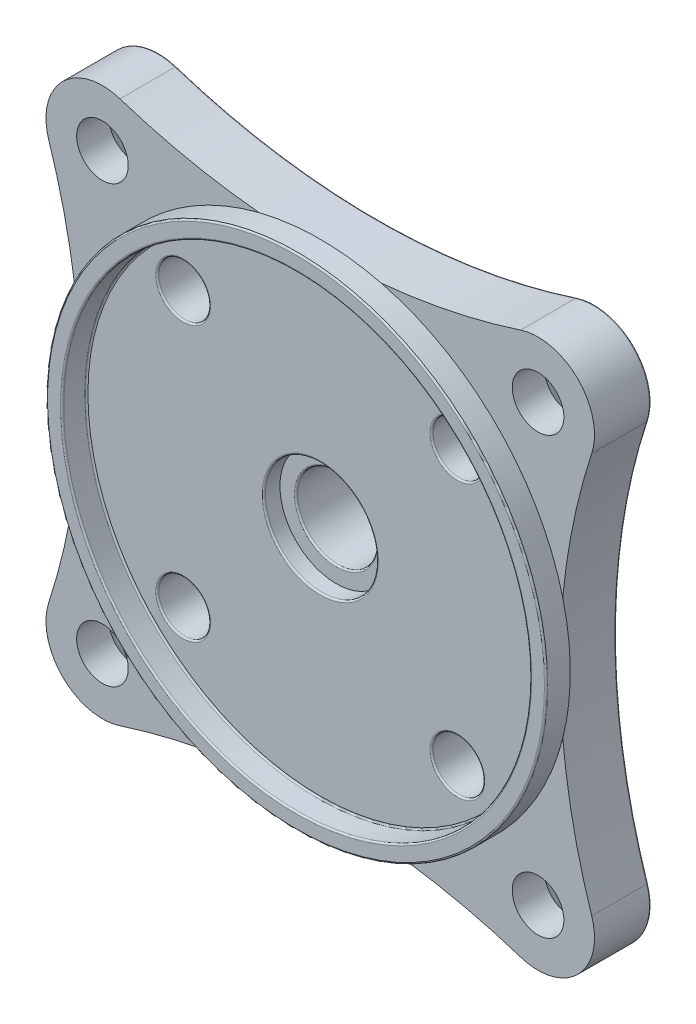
ISO-10303-21;
HEADER;
FILE_DESCRIPTION(('STEP AP214'),'2;1');
FILE_NAME('part.step','',(''),(''),'','','');
FILE_SCHEMA(('AUTOMOTIVE_DESIGN { 1 0 10303 214 1 1 1 1 }'));
ENDSEC;
DATA;
#1=APPLICATION_CONTEXT('core data for automotive mechanical design processes');
#2=APPLICATION_PROTOCOL_DEFINITION('international standard','automotive_design',2000,#1);
#3=PRODUCT_CONTEXT('',#1,'mechanical');
#4=PRODUCT('Part','Part','',(#3));
#5=PRODUCT_RELATED_PRODUCT_CATEGORY('part','',(#4));
#6=PRODUCT_DEFINITION_FORMATION('','',#4);
#7=PRODUCT_DEFINITION_CONTEXT('part definition',#1,'design');
#8=PRODUCT_DEFINITION('design','',#6,#7);
#9=PRODUCT_DEFINITION_SHAPE('','',#8);
#10=(LENGTH_UNIT() NAMED_UNIT(*) SI_UNIT(.MILLI.,.METRE.));
#11=(NAMED_UNIT(*) PLANE_ANGLE_UNIT() SI_UNIT($,.RADIAN.));
#12=(NAMED_UNIT(*) SI_UNIT($,.STERADIAN.) SOLID_ANGLE_UNIT());
#13=UNCERTAINTY_MEASURE_WITH_UNIT(LENGTH_MEASURE(1.E-05),#10,'distance_accuracy_value','');
#14=(GEOMETRIC_REPRESENTATION_CONTEXT(3) GLOBAL_UNCERTAINTY_ASSIGNED_CONTEXT((#13)) GLOBAL_UNIT_ASSIGNED_CONTEXT((#10,
#11,#12)) REPRESENTATION_CONTEXT('',''));
#15=CARTESIAN_POINT('',(0.,0.,0.));
#16=DIRECTION('',(0.,0.,1.));
#17=DIRECTION('',(1.,0.,0.));
#18=AXIS2_PLACEMENT_3D('',#15,#16,#17);
#19=CARTESIAN_POINT('',(0.,0.,3.5));
#20=DIRECTION('',(0.,0.,-1.));
#21=DIRECTION('',(-1.,0.,0.));
#22=AXIS2_PLACEMENT_3D('',#19,#20,#21);
#23=CYLINDRICAL_SURFACE('',#22,2.5);
#24=CARTESIAN_POINT('',(0.,0.,2.4));
#25=DIRECTION('',(0.,0.,1.));
#26=DIRECTION('',(1.,0.,0.));
#27=AXIS2_PLACEMENT_3D('',#24,#25,#26);
#28=CIRCLE('',#27,2.5);
#29=CARTESIAN_POINT('',(2.5,0.,2.4));
#30=VERTEX_POINT('',#29);
#31=EDGE_CURVE('E358',#30,#30,#28,.T.);
#32=ORIENTED_EDGE('',*,*,#31,.T.);
#33=EDGE_LOOP('',(#32));
#34=FACE_BOUND('',#33,.T.);
#35=CARTESIAN_POINT('',(0.,0.,-8.15));
#36=DIRECTION('',(0.,0.,-1.));
#37=DIRECTION('',(-1.,0.,0.));
#38=AXIS2_PLACEMENT_3D('',#35,#36,#37);
#39=CIRCLE('',#38,2.5);
#40=CARTESIAN_POINT('',(-2.5,0.,-8.15));
#41=VERTEX_POINT('',#40);
#42=EDGE_CURVE('E355',#41,#41,#39,.T.);
#43=ORIENTED_EDGE('',*,*,#42,.T.);
#44=EDGE_LOOP('',(#43));
#45=FACE_BOUND('',#44,.T.);
#46=ADVANCED_FACE('F30',(#34,#45),#23,.F.);
#47=CARTESIAN_POINT('',(0.,54.8521462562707,3.5));
#48=DIRECTION('',(0.,0.,1.));
#49=DIRECTION('',(1.,0.,0.));
#50=AXIS2_PLACEMENT_3D('',#47,#48,#49);
#51=PLANE('',#50);
#52=CARTESIAN_POINT('',(0.,0.,3.5));
#53=DIRECTION('',(0.,0.,1.));
#54=DIRECTION('',(1.,0.,0.));
#55=AXIS2_PLACEMENT_3D('',#52,#53,#54);
#56=CIRCLE('',#55,15.5);
#57=CARTESIAN_POINT('',(15.0313894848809,3.78250315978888,3.5));
#58=VERTEX_POINT('',#57);
#59=CARTESIAN_POINT('',(3.78250315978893,15.0313894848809,3.5));
#60=VERTEX_POINT('',#59);
#61=EDGE_CURVE('E266',#58,#60,#56,.T.);
#62=ORIENTED_EDGE('',*,*,#61,.F.);
#63=CARTESIAN_POINT('',(54.8521462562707,-1.91515355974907E-13,3.5));
#64=DIRECTION('',(0.,0.,-1.));
#65=DIRECTION('',(0.,-1.,0.));
#66=AXIS2_PLACEMENT_3D('',#63,#64,#65);
#67=CIRCLE('',#66,40.);
#68=CARTESIAN_POINT('',(16.8271841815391,12.4137931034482,3.5));
#69=VERTEX_POINT('',#68);
#70=EDGE_CURVE('E252',#58,#69,#67,.T.);
#71=ORIENTED_EDGE('',*,*,#70,.T.);
#72=CARTESIAN_POINT('',(13.5,13.5,3.5));
#73=DIRECTION('',(0.,0.,1.));
#74=DIRECTION('',(0.,-1.,0.));
#75=AXIS2_PLACEMENT_3D('',#72,#73,#74);
#76=CIRCLE('',#75,3.5);
#77=CARTESIAN_POINT('',(12.4137931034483,16.827184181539,3.5));
#78=VERTEX_POINT('',#77);
#79=EDGE_CURVE('E249',#69,#78,#76,.T.);
#80=ORIENTED_EDGE('',*,*,#79,.T.);
#81=CARTESIAN_POINT('',(0.,54.8521462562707,3.5));
#82=DIRECTION('',(0.,0.,-1.));
#83=DIRECTION('',(1.,0.,0.));
#84=AXIS2_PLACEMENT_3D('',#81,#82,#83);
#85=CIRCLE('',#84,40.);
#86=EDGE_CURVE('E902',#78,#60,#85,.T.);
#87=ORIENTED_EDGE('',*,*,#86,.T.);
#88=EDGE_LOOP('',(#62,#71,#80,#87));
#89=FACE_BOUND('',#88,.T.);
#90=CARTESIAN_POINT('',(13.5,13.5,3.5));
#91=DIRECTION('',(0.,0.,-1.));
#92=DIRECTION('',(-1.,0.,0.));
#93=AXIS2_PLACEMENT_3D('',#90,#91,#92);
#94=CIRCLE('',#93,1.6);
#95=CARTESIAN_POINT('',(11.9,13.5,3.5));
#96=VERTEX_POINT('',#95);
#97=EDGE_CURVE('E684',#96,#96,#94,.T.);
#98=ORIENTED_EDGE('',*,*,#97,.T.);
#99=EDGE_LOOP('',(#98));
#100=FACE_BOUND('',#99,.T.);
#101=ADVANCED_FACE('F608',(#89,#100),#51,.T.);
#102=CARTESIAN_POINT('',(-3.78250315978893,15.0313894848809,3.5));
#103=VERTEX_POINT('',#102);
#104=CARTESIAN_POINT('',(-15.0313894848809,3.7825031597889,3.5));
#105=VERTEX_POINT('',#104);
#106=EDGE_CURVE('E273',#103,#105,#56,.T.);
#107=ORIENTED_EDGE('',*,*,#106,.F.);
#108=CARTESIAN_POINT('',(-12.4137931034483,16.827184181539,3.5));
#109=VERTEX_POINT('',#108);
#110=EDGE_CURVE('E906',#103,#109,#85,.T.);
#111=ORIENTED_EDGE('',*,*,#110,.T.);
#112=CARTESIAN_POINT('',(-13.5,13.5,3.5));
#113=DIRECTION('',(0.,0.,1.));
#114=DIRECTION('',(1.,0.,0.));
#115=AXIS2_PLACEMENT_3D('',#112,#113,#114);
#116=CIRCLE('',#115,3.5);
#117=CARTESIAN_POINT('',(-16.827184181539,12.4137931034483,3.5));
#118=VERTEX_POINT('',#117);
#119=EDGE_CURVE('E573',#109,#118,#116,.T.);
#120=ORIENTED_EDGE('',*,*,#119,.T.);
#121=CARTESIAN_POINT('',(-54.8521462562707,0.,3.5));
#122=DIRECTION('',(0.,0.,-1.));
#123=DIRECTION('',(1.,0.,0.));
#124=AXIS2_PLACEMENT_3D('',#121,#122,#123);
#125=CIRCLE('',#124,40.);
#126=EDGE_CURVE('E580',#118,#105,#125,.T.);
#127=ORIENTED_EDGE('',*,*,#126,.T.);
#128=EDGE_LOOP('',(#107,#111,#120,#127));
#129=FACE_BOUND('',#128,.T.);
#130=CARTESIAN_POINT('',(-13.5,13.5,3.5));
#131=DIRECTION('',(0.,0.,-1.));
#132=DIRECTION('',(-1.,0.,0.));
#133=AXIS2_PLACEMENT_3D('',#130,#131,#132);
#134=CIRCLE('',#133,1.6);
#135=CARTESIAN_POINT('',(-15.1,13.5,3.5));
#136=VERTEX_POINT('',#135);
#137=EDGE_CURVE('E922',#136,#136,#134,.T.);
#138=ORIENTED_EDGE('',*,*,#137,.T.);
#139=EDGE_LOOP('',(#138));
#140=FACE_BOUND('',#139,.T.);
#141=ADVANCED_FACE('F614',(#129,#140),#51,.T.);
#142=CARTESIAN_POINT('',(-15.0313894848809,-3.7825031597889,3.5));
#143=VERTEX_POINT('',#142);
#144=CARTESIAN_POINT('',(-3.78250315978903,-15.0313894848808,3.5));
#145=VERTEX_POINT('',#144);
#146=EDGE_CURVE('E271',#143,#145,#56,.T.);
#147=ORIENTED_EDGE('',*,*,#146,.F.);
#148=CARTESIAN_POINT('',(-16.8271841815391,-12.4137931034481,3.5));
#149=VERTEX_POINT('',#148);
#150=EDGE_CURVE('E888',#143,#149,#125,.T.);
#151=ORIENTED_EDGE('',*,*,#150,.T.);
#152=CARTESIAN_POINT('',(-13.5000000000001,-13.4999999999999,3.5));
#153=DIRECTION('',(0.,0.,1.));
#154=DIRECTION('',(0.,1.,0.));
#155=AXIS2_PLACEMENT_3D('',#152,#153,#154);
#156=CIRCLE('',#155,3.5);
#157=CARTESIAN_POINT('',(-12.4137931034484,-16.8271841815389,3.5));
#158=VERTEX_POINT('',#157);
#159=EDGE_CURVE('E920',#149,#158,#156,.T.);
#160=ORIENTED_EDGE('',*,*,#159,.T.);
#161=CARTESIAN_POINT('',(-3.83030711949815E-13,-54.8521462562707,3.5));
#162=DIRECTION('',(0.,0.,-1.));
#163=DIRECTION('',(-1.,0.,0.));
#164=AXIS2_PLACEMENT_3D('',#161,#162,#163);
#165=CIRCLE('',#164,40.);
#166=EDGE_CURVE('E890',#158,#145,#165,.T.);
#167=ORIENTED_EDGE('',*,*,#166,.T.);
#168=EDGE_LOOP('',(#147,#151,#160,#167));
#169=FACE_BOUND('',#168,.T.);
#170=CARTESIAN_POINT('',(-13.5000000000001,-13.4999999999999,3.5));
#171=DIRECTION('',(0.,0.,-1.));
#172=DIRECTION('',(-1.,0.,0.));
#173=AXIS2_PLACEMENT_3D('',#170,#171,#172);
#174=CIRCLE('',#173,1.6);
#175=CARTESIAN_POINT('',(-15.1000000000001,-13.4999999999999,3.5));
#176=VERTEX_POINT('',#175);
#177=EDGE_CURVE('E925',#176,#176,#174,.T.);
#178=ORIENTED_EDGE('',*,*,#177,.T.);
#179=EDGE_LOOP('',(#178));
#180=FACE_BOUND('',#179,.T.);
#181=ADVANCED_FACE('F885',(#169,#180),#51,.T.);
#182=CARTESIAN_POINT('',(0.,0.,3.5));
#183=DIRECTION('',(0.,0.,1.));
#184=DIRECTION('',(1.,0.,0.));
#185=AXIS2_PLACEMENT_3D('',#182,#183,#184);
#186=CIRCLE('',#185,14.4);
#187=CARTESIAN_POINT('',(14.4,0.,3.5));
#188=VERTEX_POINT('',#187);
#189=EDGE_CURVE('E307',#188,#188,#186,.T.);
#190=ORIENTED_EDGE('',*,*,#189,.T.);
#191=EDGE_LOOP('',(#190));
#192=FACE_BOUND('',#191,.T.);
#193=CARTESIAN_POINT('',(8.49999999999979,-8.49999999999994,3.5));
#194=DIRECTION('',(0.,0.,1.));
#195=DIRECTION('',(1.,0.,0.));
#196=AXIS2_PLACEMENT_3D('',#193,#194,#195);
#197=CIRCLE('',#196,1.7);
#198=CARTESIAN_POINT('',(10.1999999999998,-8.49999999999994,3.5));
#199=VERTEX_POINT('',#198);
#200=EDGE_CURVE('E304',#199,#199,#197,.F.);
#201=ORIENTED_EDGE('',*,*,#200,.T.);
#202=EDGE_LOOP('',(#201));
#203=FACE_BOUND('',#202,.T.);
#204=CARTESIAN_POINT('',(-8.50000000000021,-8.5,3.5));
#205=DIRECTION('',(0.,0.,1.));
#206=DIRECTION('',(1.,0.,0.));
#207=AXIS2_PLACEMENT_3D('',#204,#205,#206);
#208=CIRCLE('',#207,1.7);
#209=CARTESIAN_POINT('',(-6.80000000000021,-8.5,3.5));
#210=VERTEX_POINT('',#209);
#211=EDGE_CURVE('E301',#210,#210,#208,.F.);
#212=ORIENTED_EDGE('',*,*,#211,.T.);
#213=EDGE_LOOP('',(#212));
#214=FACE_BOUND('',#213,.T.);
#215=CARTESIAN_POINT('',(-8.50000000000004,8.5,3.5));
#216=DIRECTION('',(0.,0.,1.));
#217=DIRECTION('',(1.,0.,0.));
#218=AXIS2_PLACEMENT_3D('',#215,#216,#217);
#219=CIRCLE('',#218,1.7);
#220=CARTESIAN_POINT('',(-6.80000000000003,8.5,3.5));
#221=VERTEX_POINT('',#220);
#222=EDGE_CURVE('E295',#221,#221,#219,.F.);
#223=ORIENTED_EDGE('',*,*,#222,.T.);
#224=EDGE_LOOP('',(#223));
#225=FACE_BOUND('',#224,.T.);
#226=CARTESIAN_POINT('',(8.49999999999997,8.49999999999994,3.5));
#227=DIRECTION('',(0.,0.,1.));
#228=DIRECTION('',(1.,0.,0.));
#229=AXIS2_PLACEMENT_3D('',#226,#227,#228);
#230=CIRCLE('',#229,1.7);
#231=CARTESIAN_POINT('',(10.2,8.49999999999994,3.5));
#232=VERTEX_POINT('',#231);
#233=EDGE_CURVE('E290',#232,#232,#230,.F.);
#234=ORIENTED_EDGE('',*,*,#233,.T.);
#235=EDGE_LOOP('',(#234));
#236=FACE_BOUND('',#235,.T.);
#237=CARTESIAN_POINT('',(0.,0.,3.5));
#238=DIRECTION('',(0.,0.,1.));
#239=DIRECTION('',(1.,0.,0.));
#240=AXIS2_PLACEMENT_3D('',#237,#238,#239);
#241=CIRCLE('',#240,3.6);
#242=CARTESIAN_POINT('',(3.6,0.,3.5));
#243=VERTEX_POINT('',#242);
#244=EDGE_CURVE('E288',#243,#243,#241,.F.);
#245=ORIENTED_EDGE('',*,*,#244,.T.);
#246=EDGE_LOOP('',(#245));
#247=FACE_BOUND('',#246,.T.);
#248=ADVANCED_FACE('F635',(#192,#203,#214,#225,#236,#247),#51,.T.);
#249=CARTESIAN_POINT('',(0.,0.,-2.25));
#250=DIRECTION('',(0.,0.,-1.));
#251=DIRECTION('',(-1.,0.,0.));
#252=AXIS2_PLACEMENT_3D('',#249,#250,#251);
#253=PLANE('',#252);
#254=CARTESIAN_POINT('',(0.,0.,-2.25));
#255=DIRECTION('',(0.,0.,-1.));
#256=DIRECTION('',(-1.,0.,0.));
#257=AXIS2_PLACEMENT_3D('',#254,#255,#256);
#258=CIRCLE('',#257,3.6);
#259=CARTESIAN_POINT('',(-3.6,0.,-2.25));
#260=VERTEX_POINT('',#259);
#261=EDGE_CURVE('E376',#260,#260,#258,.F.);
#262=ORIENTED_EDGE('',*,*,#261,.T.);
#263=EDGE_LOOP('',(#262));
#264=FACE_BOUND('',#263,.T.);
#265=CARTESIAN_POINT('',(0.,0.,-2.25));
#266=DIRECTION('',(0.,0.,-1.));
#267=DIRECTION('',(-1.,0.,0.));
#268=AXIS2_PLACEMENT_3D('',#265,#266,#267);
#269=CIRCLE('',#268,6.4);
#270=CARTESIAN_POINT('',(-6.4,0.,-2.25));
#271=VERTEX_POINT('',#270);
#272=EDGE_CURVE('E373',#271,#271,#269,.T.);
#273=ORIENTED_EDGE('',*,*,#272,.T.);
#274=EDGE_LOOP('',(#273));
#275=FACE_BOUND('',#274,.T.);
#276=ADVANCED_FACE('F631',(#264,#275),#253,.T.);
#277=CARTESIAN_POINT('',(31.6760731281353,4.24999999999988,-1.5));
#278=DIRECTION('',(0.,0.,-1.));
#279=DIRECTION('',(-1.,0.,0.));
#280=AXIS2_PLACEMENT_3D('',#277,#278,#279);
#281=PLANE('',#280);
#282=CARTESIAN_POINT('',(0.,0.,-1.5));
#283=DIRECTION('',(0.,0.,-1.));
#284=DIRECTION('',(-1.,0.,0.));
#285=AXIS2_PLACEMENT_3D('',#282,#283,#284);
#286=CIRCLE('',#285,6.6);
#287=CARTESIAN_POINT('',(-6.6,0.,-1.5));
#288=VERTEX_POINT('',#287);
#289=EDGE_CURVE('E402',#288,#288,#286,.F.);
#290=ORIENTED_EDGE('',*,*,#289,.T.);
#291=EDGE_LOOP('',(#290));
#292=FACE_BOUND('',#291,.T.);
#293=CARTESIAN_POINT('',(0.,54.8521462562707,-1.5));
#294=DIRECTION('',(0.,0.,-1.));
#295=DIRECTION('',(-1.,0.,0.));
#296=AXIS2_PLACEMENT_3D('',#293,#294,#295);
#297=CIRCLE('',#296,44.1);
#298=CARTESIAN_POINT('',(-5.3076406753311,11.0727110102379,-1.5));
#299=VERTEX_POINT('',#298);
#300=CARTESIAN_POINT('',(5.30764067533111,11.0727110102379,-1.5));
#301=VERTEX_POINT('',#300);
#302=EDGE_CURVE('E397',#299,#301,#297,.F.);
#303=ORIENTED_EDGE('',*,*,#302,.T.);
#304=CARTESIAN_POINT('',(8.49999999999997,8.49999999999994,-1.5));
#305=DIRECTION('',(0.,0.,-1.));
#306=DIRECTION('',(-1.,0.,0.));
#307=AXIS2_PLACEMENT_3D('',#304,#305,#306);
#308=CIRCLE('',#307,4.09999999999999);
#309=CARTESIAN_POINT('',(11.072711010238,5.30764067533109,-1.5));
#310=VERTEX_POINT('',#309);
#311=EDGE_CURVE('E399',#301,#310,#308,.F.);
#312=ORIENTED_EDGE('',*,*,#311,.T.);
#313=CARTESIAN_POINT('',(54.8521462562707,-1.91515355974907E-13,-1.5));
#314=DIRECTION('',(0.,0.,-1.));
#315=DIRECTION('',(-1.,0.,0.));
#316=AXIS2_PLACEMENT_3D('',#313,#314,#315);
#317=CIRCLE('',#316,44.1);
#318=CARTESIAN_POINT('',(11.0727110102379,-5.30764067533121,-1.5));
#319=VERTEX_POINT('',#318);
#320=EDGE_CURVE('E385',#310,#319,#317,.F.);
#321=ORIENTED_EDGE('',*,*,#320,.T.);
#322=CARTESIAN_POINT('',(8.49999999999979,-8.49999999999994,-1.5));
#323=DIRECTION('',(0.,0.,-1.));
#324=DIRECTION('',(-1.,0.,0.));
#325=AXIS2_PLACEMENT_3D('',#322,#323,#324);
#326=CIRCLE('',#325,4.09999999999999);
#327=CARTESIAN_POINT('',(5.30764067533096,-11.072711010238,-1.5));
#328=VERTEX_POINT('',#327);
#329=EDGE_CURVE('E387',#319,#328,#326,.F.);
#330=ORIENTED_EDGE('',*,*,#329,.T.);
#331=CARTESIAN_POINT('',(-3.83030711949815E-13,-54.8521462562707,-1.5));
#332=DIRECTION('',(0.,0.,-1.));
#333=DIRECTION('',(-1.,0.,0.));
#334=AXIS2_PLACEMENT_3D('',#331,#332,#333);
#335=CIRCLE('',#334,44.1);
#336=CARTESIAN_POINT('',(-5.30764067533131,-11.0727110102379,-1.5));
#337=VERTEX_POINT('',#336);
#338=EDGE_CURVE('E389',#328,#337,#335,.F.);
#339=ORIENTED_EDGE('',*,*,#338,.T.);
#340=CARTESIAN_POINT('',(-8.50000000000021,-8.5,-1.5));
#341=DIRECTION('',(0.,0.,-1.));
#342=DIRECTION('',(-1.,0.,0.));
#343=AXIS2_PLACEMENT_3D('',#340,#341,#342);
#344=CIRCLE('',#343,4.09999999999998);
#345=CARTESIAN_POINT('',(-11.072711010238,-5.30764067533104,-1.5));
#346=VERTEX_POINT('',#345);
#347=EDGE_CURVE('E391',#337,#346,#344,.F.);
#348=ORIENTED_EDGE('',*,*,#347,.T.);
#349=CARTESIAN_POINT('',(-54.8521462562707,0.,-1.5));
#350=DIRECTION('',(0.,0.,-1.));
#351=DIRECTION('',(-1.,0.,0.));
#352=AXIS2_PLACEMENT_3D('',#349,#350,#351);
#353=CIRCLE('',#352,44.0999999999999);
#354=CARTESIAN_POINT('',(-11.0727110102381,5.30764067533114,-1.5));
#355=VERTEX_POINT('',#354);
#356=EDGE_CURVE('E393',#346,#355,#353,.F.);
#357=ORIENTED_EDGE('',*,*,#356,.T.);
#358=CARTESIAN_POINT('',(-8.50000000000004,8.5,-1.5));
#359=DIRECTION('',(0.,0.,-1.));
#360=DIRECTION('',(-1.,0.,0.));
#361=AXIS2_PLACEMENT_3D('',#358,#359,#360);
#362=CIRCLE('',#361,4.10000000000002);
#363=EDGE_CURVE('E395',#355,#299,#362,.F.);
#364=ORIENTED_EDGE('',*,*,#363,.T.);
#365=EDGE_LOOP('',(#303,#312,#321,#330,#339,#348,#357,#364));
#366=FACE_BOUND('',#365,.T.);
#367=ADVANCED_FACE('F634',(#292,#366),#281,.T.);
#368=CARTESIAN_POINT('',(0.,54.8521462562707,0.));
#369=DIRECTION('',(0.,0.,1.));
#370=DIRECTION('',(1.,0.,0.));
#371=AXIS2_PLACEMENT_3D('',#368,#369,#370);
#372=PLANE('',#371);
#373=CARTESIAN_POINT('',(-3.83030711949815E-13,-54.8521462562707,0.));
#374=DIRECTION('',(0.,0.,1.));
#375=DIRECTION('',(1.,0.,0.));
#376=AXIS2_PLACEMENT_3D('',#373,#374,#375);
#377=CIRCLE('',#376,43.9);
#378=CARTESIAN_POINT('',(-5.8278387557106,-11.3406960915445,0.));
#379=VERTEX_POINT('',#378);
#380=CARTESIAN_POINT('',(5.8278387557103,-11.3406960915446,0.));
#381=VERTEX_POINT('',#380);
#382=EDGE_CURVE('E492',#379,#381,#377,.F.);
#383=ORIENTED_EDGE('',*,*,#382,.T.);
#384=CARTESIAN_POINT('',(8.49999999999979,-8.49999999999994,0.));
#385=DIRECTION('',(0.,0.,1.));
#386=DIRECTION('',(1.,0.,0.));
#387=AXIS2_PLACEMENT_3D('',#384,#385,#386);
#388=CIRCLE('',#387,3.89999999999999);
#389=CARTESIAN_POINT('',(11.3406960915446,-5.82783875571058,0.));
#390=VERTEX_POINT('',#389);
#391=EDGE_CURVE('E494',#381,#390,#388,.F.);
#392=ORIENTED_EDGE('',*,*,#391,.T.);
#393=CARTESIAN_POINT('',(54.8521462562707,-1.91515355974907E-13,0.));
#394=DIRECTION('',(0.,0.,1.));
#395=DIRECTION('',(1.,0.,0.));
#396=AXIS2_PLACEMENT_3D('',#393,#394,#395);
#397=CIRCLE('',#396,43.9);
#398=CARTESIAN_POINT('',(11.3406960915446,5.82783875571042,0.));
#399=VERTEX_POINT('',#398);
#400=EDGE_CURVE('E480',#390,#399,#397,.F.);
#401=ORIENTED_EDGE('',*,*,#400,.T.);
#402=CARTESIAN_POINT('',(8.49999999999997,8.49999999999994,0.));
#403=DIRECTION('',(0.,0.,1.));
#404=DIRECTION('',(1.,0.,0.));
#405=AXIS2_PLACEMENT_3D('',#402,#403,#404);
#406=CIRCLE('',#405,3.89999999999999);
#407=CARTESIAN_POINT('',(5.82783875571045,11.3406960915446,0.));
#408=VERTEX_POINT('',#407);
#409=EDGE_CURVE('E482',#399,#408,#406,.F.);
#410=ORIENTED_EDGE('',*,*,#409,.T.);
#411=CARTESIAN_POINT('',(0.,54.8521462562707,0.));
#412=DIRECTION('',(0.,0.,1.));
#413=DIRECTION('',(1.,0.,0.));
#414=AXIS2_PLACEMENT_3D('',#411,#412,#413);
#415=CIRCLE('',#414,43.9);
#416=CARTESIAN_POINT('',(-5.82783875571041,11.3406960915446,0.));
#417=VERTEX_POINT('',#416);
#418=EDGE_CURVE('E484',#408,#417,#415,.F.);
#419=ORIENTED_EDGE('',*,*,#418,.T.);
#420=CARTESIAN_POINT('',(-8.50000000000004,8.5,0.));
#421=DIRECTION('',(0.,0.,1.));
#422=DIRECTION('',(1.,0.,0.));
#423=AXIS2_PLACEMENT_3D('',#420,#421,#422);
#424=CIRCLE('',#423,3.90000000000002);
#425=CARTESIAN_POINT('',(-11.3406960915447,5.82783875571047,0.));
#426=VERTEX_POINT('',#425);
#427=EDGE_CURVE('E486',#417,#426,#424,.F.);
#428=ORIENTED_EDGE('',*,*,#427,.T.);
#429=CARTESIAN_POINT('',(-54.8521462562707,0.,0.));
#430=DIRECTION('',(0.,0.,1.));
#431=DIRECTION('',(1.,0.,0.));
#432=AXIS2_PLACEMENT_3D('',#429,#430,#431);
#433=CIRCLE('',#432,43.8999999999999);
#434=CARTESIAN_POINT('',(-11.3406960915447,-5.82783875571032,0.));
#435=VERTEX_POINT('',#434);
#436=EDGE_CURVE('E488',#426,#435,#433,.F.);
#437=ORIENTED_EDGE('',*,*,#436,.T.);
#438=CARTESIAN_POINT('',(-8.50000000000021,-8.5,0.));
#439=DIRECTION('',(0.,0.,1.));
#440=DIRECTION('',(1.,0.,0.));
#441=AXIS2_PLACEMENT_3D('',#438,#439,#440);
#442=CIRCLE('',#441,3.89999999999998);
#443=EDGE_CURVE('E490',#435,#379,#442,.F.);
#444=ORIENTED_EDGE('',*,*,#443,.T.);
#445=EDGE_LOOP('',(#383,#392,#401,#410,#419,#428,#437,#444));
#446=FACE_BOUND('',#445,.T.);
#447=CARTESIAN_POINT('',(13.5,13.5,0.));
#448=DIRECTION('',(0.,0.,1.));
#449=DIRECTION('',(1.,0.,0.));
#450=AXIS2_PLACEMENT_3D('',#447,#448,#449);
#451=CIRCLE('',#450,3.14142135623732);
#452=CARTESIAN_POINT('',(16.6414213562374,13.5,0.));
#453=VERTEX_POINT('',#452);
#454=EDGE_CURVE('E477',#453,#453,#451,.T.);
#455=ORIENTED_EDGE('',*,*,#454,.T.);
#456=EDGE_LOOP('',(#455));
#457=FACE_BOUND('',#456,.T.);
#458=CARTESIAN_POINT('',(13.4999999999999,-13.5000000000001,0.));
#459=DIRECTION('',(0.,0.,1.));
#460=DIRECTION('',(1.,0.,0.));
#461=AXIS2_PLACEMENT_3D('',#458,#459,#460);
#462=CIRCLE('',#461,3.14142135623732);
#463=CARTESIAN_POINT('',(16.6414213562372,-13.5000000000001,0.));
#464=VERTEX_POINT('',#463);
#465=EDGE_CURVE('E474',#464,#464,#462,.T.);
#466=ORIENTED_EDGE('',*,*,#465,.T.);
#467=EDGE_LOOP('',(#466));
#468=FACE_BOUND('',#467,.T.);
#469=CARTESIAN_POINT('',(-13.5000000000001,-13.4999999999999,0.));
#470=DIRECTION('',(0.,0.,1.));
#471=DIRECTION('',(1.,0.,0.));
#472=AXIS2_PLACEMENT_3D('',#469,#470,#471);
#473=CIRCLE('',#472,3.14142135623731);
#474=CARTESIAN_POINT('',(-10.3585786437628,-13.4999999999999,0.));
#475=VERTEX_POINT('',#474);
#476=EDGE_CURVE('E471',#475,#475,#473,.T.);
#477=ORIENTED_EDGE('',*,*,#476,.T.);
#478=EDGE_LOOP('',(#477));
#479=FACE_BOUND('',#478,.T.);
#480=CARTESIAN_POINT('',(-13.5,13.5,0.));
#481=DIRECTION('',(0.,0.,1.));
#482=DIRECTION('',(1.,0.,0.));
#483=AXIS2_PLACEMENT_3D('',#480,#481,#482);
#484=CIRCLE('',#483,3.14142135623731);
#485=CARTESIAN_POINT('',(-10.3585786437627,13.5,0.));
#486=VERTEX_POINT('',#485);
#487=EDGE_CURVE('E468',#486,#486,#484,.T.);
#488=ORIENTED_EDGE('',*,*,#487,.T.);
#489=EDGE_LOOP('',(#488));
#490=FACE_BOUND('',#489,.T.);
#491=CARTESIAN_POINT('',(8.49999999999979,-8.49999999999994,0.));
#492=DIRECTION('',(0.,0.,1.));
#493=DIRECTION('',(1.,0.,0.));
#494=AXIS2_PLACEMENT_3D('',#491,#492,#493);
#495=CIRCLE('',#494,1.7);
#496=CARTESIAN_POINT('',(10.1999999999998,-8.49999999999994,0.));
#497=VERTEX_POINT('',#496);
#498=EDGE_CURVE('E465',#497,#497,#495,.T.);
#499=ORIENTED_EDGE('',*,*,#498,.T.);
#500=EDGE_LOOP('',(#499));
#501=FACE_BOUND('',#500,.T.);
#502=CARTESIAN_POINT('',(-8.50000000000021,-8.5,0.));
#503=DIRECTION('',(0.,0.,1.));
#504=DIRECTION('',(1.,0.,0.));
#505=AXIS2_PLACEMENT_3D('',#502,#503,#504);
#506=CIRCLE('',#505,1.7);
#507=CARTESIAN_POINT('',(-6.80000000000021,-8.5,0.));
#508=VERTEX_POINT('',#507);
#509=EDGE_CURVE('E462',#508,#508,#506,.T.);
#510=ORIENTED_EDGE('',*,*,#509,.T.);
#511=EDGE_LOOP('',(#510));
#512=FACE_BOUND('',#511,.T.);
#513=CARTESIAN_POINT('',(-8.50000000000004,8.5,0.));
#514=DIRECTION('',(0.,0.,1.));
#515=DIRECTION('',(1.,0.,0.));
#516=AXIS2_PLACEMENT_3D('',#513,#514,#515);
#517=CIRCLE('',#516,1.7);
#518=CARTESIAN_POINT('',(-6.80000000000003,8.5,0.));
#519=VERTEX_POINT('',#518);
#520=EDGE_CURVE('E459',#519,#519,#517,.T.);
#521=ORIENTED_EDGE('',*,*,#520,.T.);
#522=EDGE_LOOP('',(#521));
#523=FACE_BOUND('',#522,.T.);
#524=CARTESIAN_POINT('',(8.49999999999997,8.49999999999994,0.));
#525=DIRECTION('',(0.,0.,1.));
#526=DIRECTION('',(1.,0.,0.));
#527=AXIS2_PLACEMENT_3D('',#524,#525,#526);
#528=CIRCLE('',#527,1.7);
#529=CARTESIAN_POINT('',(10.2,8.49999999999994,0.));
#530=VERTEX_POINT('',#529);
#531=EDGE_CURVE('E456',#530,#530,#528,.T.);
#532=ORIENTED_EDGE('',*,*,#531,.T.);
#533=EDGE_LOOP('',(#532));
#534=FACE_BOUND('',#533,.T.);
#535=CARTESIAN_POINT('',(-54.8521462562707,0.,0.));
#536=DIRECTION('',(0.,0.,1.));
#537=DIRECTION('',(1.,0.,0.));
#538=AXIS2_PLACEMENT_3D('',#535,#536,#537);
#539=CIRCLE('',#538,40.1);
#540=CARTESIAN_POINT('',(-16.7321217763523,-12.4448275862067,0.));
#541=VERTEX_POINT('',#540);
#542=CARTESIAN_POINT('',(-16.7321217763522,12.4448275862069,0.));
#543=VERTEX_POINT('',#542);
#544=EDGE_CURVE('E451',#541,#543,#539,.T.);
#545=ORIENTED_EDGE('',*,*,#544,.T.);
#546=CARTESIAN_POINT('',(-13.5,13.5,0.));
#547=DIRECTION('',(0.,0.,1.));
#548=DIRECTION('',(1.,0.,0.));
#549=AXIS2_PLACEMENT_3D('',#546,#547,#548);
#550=CIRCLE('',#549,3.4);
#551=CARTESIAN_POINT('',(-12.4448275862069,16.7321217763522,0.));
#552=VERTEX_POINT('',#551);
#553=EDGE_CURVE('E453',#543,#552,#550,.F.);
#554=ORIENTED_EDGE('',*,*,#553,.T.);
#555=CARTESIAN_POINT('',(0.,54.8521462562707,0.));
#556=DIRECTION('',(0.,0.,1.));
#557=DIRECTION('',(1.,0.,0.));
#558=AXIS2_PLACEMENT_3D('',#555,#556,#557);
#559=CIRCLE('',#558,40.1);
#560=CARTESIAN_POINT('',(12.4448275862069,16.7321217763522,0.));
#561=VERTEX_POINT('',#560);
#562=EDGE_CURVE('E439',#552,#561,#559,.T.);
#563=ORIENTED_EDGE('',*,*,#562,.T.);
#564=CARTESIAN_POINT('',(13.5,13.5,0.));
#565=DIRECTION('',(0.,0.,1.));
#566=DIRECTION('',(1.,0.,0.));
#567=AXIS2_PLACEMENT_3D('',#564,#565,#566);
#568=CIRCLE('',#567,3.4);
#569=CARTESIAN_POINT('',(16.7321217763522,12.4448275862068,0.));
#570=VERTEX_POINT('',#569);
#571=EDGE_CURVE('E441',#561,#570,#568,.F.);
#572=ORIENTED_EDGE('',*,*,#571,.T.);
#573=CARTESIAN_POINT('',(54.8521462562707,-1.91515355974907E-13,0.));
#574=DIRECTION('',(0.,0.,1.));
#575=DIRECTION('',(1.,0.,0.));
#576=AXIS2_PLACEMENT_3D('',#573,#574,#575);
#577=CIRCLE('',#576,40.1);
#578=CARTESIAN_POINT('',(16.7321217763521,-12.444827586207,0.));
#579=VERTEX_POINT('',#578);
#580=EDGE_CURVE('E443',#570,#579,#577,.T.);
#581=ORIENTED_EDGE('',*,*,#580,.T.);
#582=CARTESIAN_POINT('',(13.4999999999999,-13.5000000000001,0.));
#583=DIRECTION('',(0.,0.,1.));
#584=DIRECTION('',(1.,0.,0.));
#585=AXIS2_PLACEMENT_3D('',#582,#583,#584);
#586=CIRCLE('',#585,3.4);
#587=CARTESIAN_POINT('',(12.4448275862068,-16.7321217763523,0.));
#588=VERTEX_POINT('',#587);
#589=EDGE_CURVE('E445',#579,#588,#586,.F.);
#590=ORIENTED_EDGE('',*,*,#589,.T.);
#591=CARTESIAN_POINT('',(-3.83030711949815E-13,-54.8521462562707,0.));
#592=DIRECTION('',(0.,0.,1.));
#593=DIRECTION('',(1.,0.,0.));
#594=AXIS2_PLACEMENT_3D('',#591,#592,#593);
#595=CIRCLE('',#594,40.1);
#596=CARTESIAN_POINT('',(-12.4448275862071,-16.7321217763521,0.));
#597=VERTEX_POINT('',#596);
#598=EDGE_CURVE('E447',#588,#597,#595,.T.);
#599=ORIENTED_EDGE('',*,*,#598,.T.);
#600=CARTESIAN_POINT('',(-13.5000000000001,-13.4999999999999,0.));
#601=DIRECTION('',(0.,0.,1.));
#602=DIRECTION('',(1.,0.,0.));
#603=AXIS2_PLACEMENT_3D('',#600,#601,#602);
#604=CIRCLE('',#603,3.4);
#605=EDGE_CURVE('E449',#597,#541,#604,.F.);
#606=ORIENTED_EDGE('',*,*,#605,.T.);
#607=EDGE_LOOP('',(#545,#554,#563,#572,#581,#590,#599,#606));
#608=FACE_BOUND('',#607,.T.);
#609=ADVANCED_FACE('F643',(#446,#457,#468,#479,#490,#501,#512,#523,#534,#608),#372,.F.);
#610=CARTESIAN_POINT('',(0.,54.8521462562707,3.5));
#611=DIRECTION('',(0.,0.,-1.));
#612=DIRECTION('',(-1.,0.,0.));
#613=AXIS2_PLACEMENT_3D('',#610,#611,#612);
#614=CYLINDRICAL_SURFACE('',#613,40.);
#615=DIRECTION('',(0.,0.,-1.));
#616=VECTOR('',#615,1.);
#617=CARTESIAN_POINT('',(12.4137931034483,16.827184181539,3.5));
#618=LINE('',#617,#616);
#619=CARTESIAN_POINT('',(12.4137931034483,16.827184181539,0.0999999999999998));
#620=VERTEX_POINT('',#619);
#621=EDGE_CURVE('E568',#78,#620,#618,.T.);
#622=ORIENTED_EDGE('',*,*,#621,.T.);
#623=CARTESIAN_POINT('',(0.,54.8521462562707,0.0999999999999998));
#624=DIRECTION('',(0.,0.,1.));
#625=DIRECTION('',(1.,0.,0.));
#626=AXIS2_PLACEMENT_3D('',#623,#624,#625);
#627=CIRCLE('',#626,40.);
#628=CARTESIAN_POINT('',(-12.4137931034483,16.827184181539,0.0999999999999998));
#629=VERTEX_POINT('',#628);
#630=EDGE_CURVE('E11',#620,#629,#627,.F.);
#631=ORIENTED_EDGE('',*,*,#630,.T.);
#632=DIRECTION('',(0.,0.,-1.));
#633=VECTOR('',#632,1.);
#634=CARTESIAN_POINT('',(-12.4137931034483,16.827184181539,3.5));
#635=LINE('',#634,#633);
#636=EDGE_CURVE('E566',#109,#629,#635,.T.);
#637=ORIENTED_EDGE('',*,*,#636,.F.);
#638=ORIENTED_EDGE('',*,*,#110,.F.);
#639=EDGE_CURVE('E905',#60,#103,#85,.T.);
#640=ORIENTED_EDGE('',*,*,#639,.F.);
#641=ORIENTED_EDGE('',*,*,#86,.F.);
#642=EDGE_LOOP('',(#622,#631,#637,#638,#640,#641));
#643=FACE_BOUND('',#642,.T.);
#644=ADVANCED_FACE('F32',(#643),#614,.F.);
#645=CARTESIAN_POINT('',(-13.5,13.5,3.5));
#646=DIRECTION('',(0.,0.,-1.));
#647=DIRECTION('',(-1.,0.,0.));
#648=AXIS2_PLACEMENT_3D('',#645,#646,#647);
#649=CYLINDRICAL_SURFACE('',#648,3.5);
#650=ORIENTED_EDGE('',*,*,#636,.T.);
#651=CARTESIAN_POINT('',(-13.5,13.5,0.0999999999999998));
#652=DIRECTION('',(0.,0.,1.));
#653=DIRECTION('',(1.,0.,0.));
#654=AXIS2_PLACEMENT_3D('',#651,#652,#653);
#655=CIRCLE('',#654,3.5);
#656=CARTESIAN_POINT('',(-16.827184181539,12.4137931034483,0.0999999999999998));
#657=VERTEX_POINT('',#656);
#658=EDGE_CURVE('E509',#629,#657,#655,.T.);
#659=ORIENTED_EDGE('',*,*,#658,.T.);
#660=DIRECTION('',(0.,0.,-1.));
#661=VECTOR('',#660,1.);
#662=CARTESIAN_POINT('',(-16.827184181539,12.4137931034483,3.5));
#663=LINE('',#662,#661);
#664=EDGE_CURVE('E575',#118,#657,#663,.T.);
#665=ORIENTED_EDGE('',*,*,#664,.F.);
#666=ORIENTED_EDGE('',*,*,#119,.F.);
#667=EDGE_LOOP('',(#650,#659,#665,#666));
#668=FACE_BOUND('',#667,.T.);
#669=ADVANCED_FACE('F570',(#668),#649,.T.);
#670=CARTESIAN_POINT('',(-54.8521462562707,0.,3.5));
#671=DIRECTION('',(0.,0.,-1.));
#672=DIRECTION('',(-1.,0.,0.));
#673=AXIS2_PLACEMENT_3D('',#670,#671,#672);
#674=CYLINDRICAL_SURFACE('',#673,40.);
#675=ORIENTED_EDGE('',*,*,#664,.T.);
#676=CARTESIAN_POINT('',(-54.8521462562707,0.,0.0999999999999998));
#677=DIRECTION('',(0.,0.,1.));
#678=DIRECTION('',(1.,0.,0.));
#679=AXIS2_PLACEMENT_3D('',#676,#677,#678);
#680=CIRCLE('',#679,40.);
#681=CARTESIAN_POINT('',(-16.8271841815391,-12.4137931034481,0.0999999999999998));
#682=VERTEX_POINT('',#681);
#683=EDGE_CURVE('E512',#657,#682,#680,.F.);
#684=ORIENTED_EDGE('',*,*,#683,.T.);
#685=DIRECTION('',(0.,0.,-1.));
#686=VECTOR('',#685,1.);
#687=CARTESIAN_POINT('',(-16.8271841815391,-12.4137931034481,3.5));
#688=LINE('',#687,#686);
#689=EDGE_CURVE('E898',#149,#682,#688,.T.);
#690=ORIENTED_EDGE('',*,*,#689,.F.);
#691=ORIENTED_EDGE('',*,*,#150,.F.);
#692=EDGE_CURVE('E895',#105,#143,#125,.T.);
#693=ORIENTED_EDGE('',*,*,#692,.F.);
#694=ORIENTED_EDGE('',*,*,#126,.F.);
#695=EDGE_LOOP('',(#675,#684,#690,#691,#693,#694));
#696=FACE_BOUND('',#695,.T.);
#697=ADVANCED_FACE('F893',(#696),#674,.F.);
#698=CARTESIAN_POINT('',(3.78250315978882,-15.0313894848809,3.5));
#699=VERTEX_POINT('',#698);
#700=CARTESIAN_POINT('',(15.0313894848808,-3.78250315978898,3.5));
#701=VERTEX_POINT('',#700);
#702=EDGE_CURVE('E244',#699,#701,#56,.T.);
#703=ORIENTED_EDGE('',*,*,#702,.F.);
#704=CARTESIAN_POINT('',(12.4137931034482,-16.8271841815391,3.5));
#705=VERTEX_POINT('',#704);
#706=EDGE_CURVE('E915',#699,#705,#165,.T.);
#707=ORIENTED_EDGE('',*,*,#706,.T.);
#708=CARTESIAN_POINT('',(13.4999999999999,-13.5000000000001,3.5));
#709=DIRECTION('',(0.,0.,1.));
#710=DIRECTION('',(-1.,0.,0.));
#711=AXIS2_PLACEMENT_3D('',#708,#709,#710);
#712=CIRCLE('',#711,3.5);
#713=CARTESIAN_POINT('',(16.8271841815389,-12.4137931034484,3.5));
#714=VERTEX_POINT('',#713);
#715=EDGE_CURVE('E247',#705,#714,#712,.T.);
#716=ORIENTED_EDGE('',*,*,#715,.T.);
#717=EDGE_CURVE('E239',#714,#701,#67,.T.);
#718=ORIENTED_EDGE('',*,*,#717,.T.);
#719=EDGE_LOOP('',(#703,#707,#716,#718));
#720=FACE_BOUND('',#719,.T.);
#721=CARTESIAN_POINT('',(13.4999999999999,-13.5000000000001,3.5));
#722=DIRECTION('',(0.,0.,-1.));
#723=DIRECTION('',(-1.,0.,0.));
#724=AXIS2_PLACEMENT_3D('',#721,#722,#723);
#725=CIRCLE('',#724,1.6);
#726=CARTESIAN_POINT('',(11.8999999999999,-13.5000000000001,3.5));
#727=VERTEX_POINT('',#726);
#728=EDGE_CURVE('E928',#727,#727,#725,.T.);
#729=ORIENTED_EDGE('',*,*,#728,.T.);
#730=EDGE_LOOP('',(#729));
#731=FACE_BOUND('',#730,.T.);
#732=ADVANCED_FACE('F241',(#720,#731),#51,.T.);
#733=CARTESIAN_POINT('',(54.8521462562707,-1.91515355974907E-13,3.5));
#734=DIRECTION('',(0.,0.,-1.));
#735=DIRECTION('',(-1.,0.,0.));
#736=AXIS2_PLACEMENT_3D('',#733,#734,#735);
#737=CYLINDRICAL_SURFACE('',#736,40.);
#738=DIRECTION('',(0.,0.,-1.));
#739=VECTOR('',#738,1.);
#740=CARTESIAN_POINT('',(16.8271841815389,-12.4137931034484,3.5));
#741=LINE('',#740,#739);
#742=CARTESIAN_POINT('',(16.8271841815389,-12.4137931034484,0.0999999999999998));
#743=VERTEX_POINT('',#742);
#744=EDGE_CURVE('E524',#714,#743,#741,.T.);
#745=ORIENTED_EDGE('',*,*,#744,.T.);
#746=CARTESIAN_POINT('',(54.8521462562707,-1.91515355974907E-13,0.0999999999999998));
#747=DIRECTION('',(0.,0.,1.));
#748=DIRECTION('',(1.,0.,0.));
#749=AXIS2_PLACEMENT_3D('',#746,#747,#748);
#750=CIRCLE('',#749,40.);
#751=CARTESIAN_POINT('',(16.8271841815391,12.4137931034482,0.0999999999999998));
#752=VERTEX_POINT('',#751);
#753=EDGE_CURVE('E52',#743,#752,#750,.F.);
#754=ORIENTED_EDGE('',*,*,#753,.T.);
#755=DIRECTION('',(0.,0.,-1.));
#756=VECTOR('',#755,1.);
#757=CARTESIAN_POINT('',(16.8271841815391,12.4137931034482,3.5));
#758=LINE('',#757,#756);
#759=EDGE_CURVE('E907',#69,#752,#758,.T.);
#760=ORIENTED_EDGE('',*,*,#759,.F.);
#761=ORIENTED_EDGE('',*,*,#70,.F.);
#762=EDGE_CURVE('E250',#701,#58,#67,.T.);
#763=ORIENTED_EDGE('',*,*,#762,.F.);
#764=ORIENTED_EDGE('',*,*,#717,.F.);
#765=EDGE_LOOP('',(#745,#754,#760,#761,#763,#764));
#766=FACE_BOUND('',#765,.T.);
#767=ADVANCED_FACE('F256',(#766),#737,.F.);
#768=CARTESIAN_POINT('',(13.5,13.5,3.5));
#769=DIRECTION('',(0.,0.,-1.));
#770=DIRECTION('',(-1.,0.,0.));
#771=AXIS2_PLACEMENT_3D('',#768,#769,#770);
#772=CYLINDRICAL_SURFACE('',#771,3.5);
#773=ORIENTED_EDGE('',*,*,#759,.T.);
#774=CARTESIAN_POINT('',(13.5,13.5,0.0999999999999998));
#775=DIRECTION('',(0.,0.,1.));
#776=DIRECTION('',(1.,0.,0.));
#777=AXIS2_PLACEMENT_3D('',#774,#775,#776);
#778=CIRCLE('',#777,3.5);
#779=EDGE_CURVE('E38',#752,#620,#778,.T.);
#780=ORIENTED_EDGE('',*,*,#779,.T.);
#781=ORIENTED_EDGE('',*,*,#621,.F.);
#782=ORIENTED_EDGE('',*,*,#79,.F.);
#783=EDGE_LOOP('',(#773,#780,#781,#782));
#784=FACE_BOUND('',#783,.T.);
#785=ADVANCED_FACE('F1102',(#784),#772,.T.);
#786=CARTESIAN_POINT('',(-3.83030711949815E-13,-54.8521462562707,3.5));
#787=DIRECTION('',(0.,0.,-1.));
#788=DIRECTION('',(-1.,0.,0.));
#789=AXIS2_PLACEMENT_3D('',#786,#787,#788);
#790=CYLINDRICAL_SURFACE('',#789,40.);
#791=DIRECTION('',(0.,0.,-1.));
#792=VECTOR('',#791,1.);
#793=CARTESIAN_POINT('',(-12.4137931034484,-16.8271841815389,3.5));
#794=LINE('',#793,#792);
#795=CARTESIAN_POINT('',(-12.4137931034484,-16.8271841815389,0.0999999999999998));
#796=VERTEX_POINT('',#795);
#797=EDGE_CURVE('E917',#158,#796,#794,.T.);
#798=ORIENTED_EDGE('',*,*,#797,.T.);
#799=CARTESIAN_POINT('',(-3.83030711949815E-13,-54.8521462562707,0.0999999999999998));
#800=DIRECTION('',(0.,0.,1.));
#801=DIRECTION('',(1.,0.,0.));
#802=AXIS2_PLACEMENT_3D('',#799,#800,#801);
#803=CIRCLE('',#802,40.);
#804=CARTESIAN_POINT('',(12.4137931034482,-16.8271841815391,0.0999999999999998));
#805=VERTEX_POINT('',#804);
#806=EDGE_CURVE('E516',#796,#805,#803,.F.);
#807=ORIENTED_EDGE('',*,*,#806,.T.);
#808=DIRECTION('',(0.,0.,-1.));
#809=VECTOR('',#808,1.);
#810=CARTESIAN_POINT('',(12.4137931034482,-16.8271841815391,3.5));
#811=LINE('',#810,#809);
#812=EDGE_CURVE('E526',#705,#805,#811,.T.);
#813=ORIENTED_EDGE('',*,*,#812,.F.);
#814=ORIENTED_EDGE('',*,*,#706,.F.);
#815=EDGE_CURVE('E880',#145,#699,#165,.T.);
#816=ORIENTED_EDGE('',*,*,#815,.F.);
#817=ORIENTED_EDGE('',*,*,#166,.F.);
#818=EDGE_LOOP('',(#798,#807,#813,#814,#816,#817));
#819=FACE_BOUND('',#818,.T.);
#820=ADVANCED_FACE('F1100',(#819),#790,.F.);
#821=CARTESIAN_POINT('',(13.4999999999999,-13.5000000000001,3.5));
#822=DIRECTION('',(0.,0.,-1.));
#823=DIRECTION('',(-1.,0.,0.));
#824=AXIS2_PLACEMENT_3D('',#821,#822,#823);
#825=CYLINDRICAL_SURFACE('',#824,3.5);
#826=ORIENTED_EDGE('',*,*,#812,.T.);
#827=CARTESIAN_POINT('',(13.4999999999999,-13.5000000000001,0.0999999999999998));
#828=DIRECTION('',(0.,0.,1.));
#829=DIRECTION('',(1.,0.,0.));
#830=AXIS2_PLACEMENT_3D('',#827,#828,#829);
#831=CIRCLE('',#830,3.5);
#832=EDGE_CURVE('E518',#805,#743,#831,.T.);
#833=ORIENTED_EDGE('',*,*,#832,.T.);
#834=ORIENTED_EDGE('',*,*,#744,.F.);
#835=ORIENTED_EDGE('',*,*,#715,.F.);
#836=EDGE_LOOP('',(#826,#833,#834,#835));
#837=FACE_BOUND('',#836,.T.);
#838=ADVANCED_FACE('F523',(#837),#825,.T.);
#839=CARTESIAN_POINT('',(-13.5000000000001,-13.4999999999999,3.5));
#840=DIRECTION('',(0.,0.,-1.));
#841=DIRECTION('',(-1.,0.,0.));
#842=AXIS2_PLACEMENT_3D('',#839,#840,#841);
#843=CYLINDRICAL_SURFACE('',#842,3.5);
#844=ORIENTED_EDGE('',*,*,#689,.T.);
#845=CARTESIAN_POINT('',(-13.5000000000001,-13.4999999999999,0.0999999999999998));
#846=DIRECTION('',(0.,0.,1.));
#847=DIRECTION('',(1.,0.,0.));
#848=AXIS2_PLACEMENT_3D('',#845,#846,#847);
#849=CIRCLE('',#848,3.5);
#850=EDGE_CURVE('E514',#682,#796,#849,.T.);
#851=ORIENTED_EDGE('',*,*,#850,.T.);
#852=ORIENTED_EDGE('',*,*,#797,.F.);
#853=ORIENTED_EDGE('',*,*,#159,.F.);
#854=EDGE_LOOP('',(#844,#851,#852,#853));
#855=FACE_BOUND('',#854,.T.);
#856=ADVANCED_FACE('F1089',(#855),#843,.T.);
#857=CARTESIAN_POINT('',(-13.5,13.5,3.5));
#858=DIRECTION('',(0.,0.,-1.));
#859=DIRECTION('',(-1.,0.,0.));
#860=AXIS2_PLACEMENT_3D('',#857,#858,#859);
#861=CYLINDRICAL_SURFACE('',#860,1.6);
#862=CARTESIAN_POINT('',(-13.5,13.5,1.5));
#863=DIRECTION('',(0.,0.,1.));
#864=DIRECTION('',(1.,0.,0.));
#865=AXIS2_PLACEMENT_3D('',#862,#863,#864);
#866=CIRCLE('',#865,1.6);
#867=CARTESIAN_POINT('',(-11.9,13.5,1.5));
#868=VERTEX_POINT('',#867);
#869=EDGE_CURVE('E272',#868,#868,#866,.F.);
#870=ORIENTED_EDGE('',*,*,#869,.T.);
#871=EDGE_LOOP('',(#870));
#872=FACE_BOUND('',#871,.T.);
#873=ORIENTED_EDGE('',*,*,#137,.F.);
#874=EDGE_LOOP('',(#873));
#875=FACE_BOUND('',#874,.T.);
#876=ADVANCED_FACE('F1193',(#872,#875),#861,.F.);
#877=CARTESIAN_POINT('',(-13.5000000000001,-13.4999999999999,3.5));
#878=DIRECTION('',(0.,0.,-1.));
#879=DIRECTION('',(-1.,0.,0.));
#880=AXIS2_PLACEMENT_3D('',#877,#878,#879);
#881=CYLINDRICAL_SURFACE('',#880,1.6);
#882=CARTESIAN_POINT('',(-13.5000000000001,-13.4999999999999,1.5));
#883=DIRECTION('',(0.,0.,1.));
#884=DIRECTION('',(1.,0.,0.));
#885=AXIS2_PLACEMENT_3D('',#882,#883,#884);
#886=CIRCLE('',#885,1.6);
#887=CARTESIAN_POINT('',(-11.9000000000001,-13.4999999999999,1.5));
#888=VERTEX_POINT('',#887);
#889=EDGE_CURVE('E275',#888,#888,#886,.F.);
#890=ORIENTED_EDGE('',*,*,#889,.T.);
#891=EDGE_LOOP('',(#890));
#892=FACE_BOUND('',#891,.T.);
#893=ORIENTED_EDGE('',*,*,#177,.F.);
#894=EDGE_LOOP('',(#893));
#895=FACE_BOUND('',#894,.T.);
#896=ADVANCED_FACE('F588',(#892,#895),#881,.F.);
#897=CARTESIAN_POINT('',(13.4999999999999,-13.5000000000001,3.5));
#898=DIRECTION('',(0.,0.,-1.));
#899=DIRECTION('',(-1.,0.,0.));
#900=AXIS2_PLACEMENT_3D('',#897,#898,#899);
#901=CYLINDRICAL_SURFACE('',#900,1.6);
#902=CARTESIAN_POINT('',(13.4999999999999,-13.5000000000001,1.5));
#903=DIRECTION('',(0.,0.,1.));
#904=DIRECTION('',(1.,0.,0.));
#905=AXIS2_PLACEMENT_3D('',#902,#903,#904);
#906=CIRCLE('',#905,1.6);
#907=CARTESIAN_POINT('',(15.0999999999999,-13.5000000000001,1.5));
#908=VERTEX_POINT('',#907);
#909=EDGE_CURVE('E578',#908,#908,#906,.F.);
#910=ORIENTED_EDGE('',*,*,#909,.T.);
#911=EDGE_LOOP('',(#910));
#912=FACE_BOUND('',#911,.T.);
#913=ORIENTED_EDGE('',*,*,#728,.F.);
#914=EDGE_LOOP('',(#913));
#915=FACE_BOUND('',#914,.T.);
#916=ADVANCED_FACE('F1172',(#912,#915),#901,.F.);
#917=CARTESIAN_POINT('',(13.5,13.5,3.5));
#918=DIRECTION('',(0.,0.,-1.));
#919=DIRECTION('',(-1.,0.,0.));
#920=AXIS2_PLACEMENT_3D('',#917,#918,#919);
#921=CYLINDRICAL_SURFACE('',#920,1.6);
#922=CARTESIAN_POINT('',(13.5,13.5,1.5));
#923=DIRECTION('',(0.,0.,1.));
#924=DIRECTION('',(1.,0.,0.));
#925=AXIS2_PLACEMENT_3D('',#922,#923,#924);
#926=CIRCLE('',#925,1.6);
#927=CARTESIAN_POINT('',(15.1,13.5,1.5));
#928=VERTEX_POINT('',#927);
#929=EDGE_CURVE('E574',#928,#928,#926,.F.);
#930=ORIENTED_EDGE('',*,*,#929,.T.);
#931=EDGE_LOOP('',(#930));
#932=FACE_BOUND('',#931,.T.);
#933=ORIENTED_EDGE('',*,*,#97,.F.);
#934=EDGE_LOOP('',(#933));
#935=FACE_BOUND('',#934,.T.);
#936=ADVANCED_FACE('F1166',(#932,#935),#921,.F.);
#937=CARTESIAN_POINT('',(8.49999999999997,8.49999999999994,3.5));
#938=DIRECTION('',(0.,0.,-1.));
#939=DIRECTION('',(-1.,0.,0.));
#940=AXIS2_PLACEMENT_3D('',#937,#938,#939);
#941=CYLINDRICAL_SURFACE('',#940,1.6);
#942=CARTESIAN_POINT('',(8.49999999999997,8.49999999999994,3.4));
#943=DIRECTION('',(0.,0.,1.));
#944=DIRECTION('',(1.,0.,0.));
#945=AXIS2_PLACEMENT_3D('',#942,#943,#944);
#946=CIRCLE('',#945,1.6);
#947=CARTESIAN_POINT('',(10.1,8.49999999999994,3.4));
#948=VERTEX_POINT('',#947);
#949=EDGE_CURVE('E337',#948,#948,#946,.T.);
#950=ORIENTED_EDGE('',*,*,#949,.T.);
#951=EDGE_LOOP('',(#950));
#952=FACE_BOUND('',#951,.T.);
#953=CARTESIAN_POINT('',(8.49999999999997,8.49999999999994,0.0999999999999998));
#954=DIRECTION('',(0.,0.,1.));
#955=DIRECTION('',(1.,0.,0.));
#956=AXIS2_PLACEMENT_3D('',#953,#954,#955);
#957=CIRCLE('',#956,1.6);
#958=CARTESIAN_POINT('',(10.1,8.49999999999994,0.0999999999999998));
#959=VERTEX_POINT('',#958);
#960=EDGE_CURVE('E334',#959,#959,#957,.F.);
#961=ORIENTED_EDGE('',*,*,#960,.T.);
#962=EDGE_LOOP('',(#961));
#963=FACE_BOUND('',#962,.T.);
#964=ADVANCED_FACE('F1171',(#952,#963),#941,.F.);
#965=CARTESIAN_POINT('',(-8.50000000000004,8.5,3.5));
#966=DIRECTION('',(0.,0.,-1.));
#967=DIRECTION('',(-1.,0.,0.));
#968=AXIS2_PLACEMENT_3D('',#965,#966,#967);
#969=CYLINDRICAL_SURFACE('',#968,1.6);
#970=CARTESIAN_POINT('',(-8.50000000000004,8.5,3.4));
#971=DIRECTION('',(0.,0.,1.));
#972=DIRECTION('',(1.,0.,0.));
#973=AXIS2_PLACEMENT_3D('',#970,#971,#972);
#974=CIRCLE('',#973,1.6);
#975=CARTESIAN_POINT('',(-6.90000000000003,8.5,3.4));
#976=VERTEX_POINT('',#975);
#977=EDGE_CURVE('E331',#976,#976,#974,.T.);
#978=ORIENTED_EDGE('',*,*,#977,.T.);
#979=EDGE_LOOP('',(#978));
#980=FACE_BOUND('',#979,.T.);
#981=CARTESIAN_POINT('',(-8.50000000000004,8.5,0.0999999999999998));
#982=DIRECTION('',(0.,0.,1.));
#983=DIRECTION('',(1.,0.,0.));
#984=AXIS2_PLACEMENT_3D('',#981,#982,#983);
#985=CIRCLE('',#984,1.6);
#986=CARTESIAN_POINT('',(-6.90000000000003,8.5,0.0999999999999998));
#987=VERTEX_POINT('',#986);
#988=EDGE_CURVE('E328',#987,#987,#985,.F.);
#989=ORIENTED_EDGE('',*,*,#988,.T.);
#990=EDGE_LOOP('',(#989));
#991=FACE_BOUND('',#990,.T.);
#992=ADVANCED_FACE('F1615',(#980,#991),#969,.F.);
#993=CARTESIAN_POINT('',(-8.50000000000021,-8.5,3.5));
#994=DIRECTION('',(0.,0.,-1.));
#995=DIRECTION('',(-1.,0.,0.));
#996=AXIS2_PLACEMENT_3D('',#993,#994,#995);
#997=CYLINDRICAL_SURFACE('',#996,1.6);
#998=CARTESIAN_POINT('',(-8.50000000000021,-8.5,3.4));
#999=DIRECTION('',(0.,0.,1.));
#1000=DIRECTION('',(1.,0.,0.));
#1001=AXIS2_PLACEMENT_3D('',#998,#999,#1000);
#1002=CIRCLE('',#1001,1.6);
#1003=CARTESIAN_POINT('',(-6.90000000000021,-8.5,3.4));
#1004=VERTEX_POINT('',#1003);
#1005=EDGE_CURVE('E325',#1004,#1004,#1002,.T.);
#1006=ORIENTED_EDGE('',*,*,#1005,.T.);
#1007=EDGE_LOOP('',(#1006));
#1008=FACE_BOUND('',#1007,.T.);
#1009=CARTESIAN_POINT('',(-8.50000000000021,-8.5,0.0999999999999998));
#1010=DIRECTION('',(0.,0.,1.));
#1011=DIRECTION('',(1.,0.,0.));
#1012=AXIS2_PLACEMENT_3D('',#1009,#1010,#1011);
#1013=CIRCLE('',#1012,1.6);
#1014=CARTESIAN_POINT('',(-6.90000000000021,-8.5,0.0999999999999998));
#1015=VERTEX_POINT('',#1014);
#1016=EDGE_CURVE('E322',#1015,#1015,#1013,.F.);
#1017=ORIENTED_EDGE('',*,*,#1016,.T.);
#1018=EDGE_LOOP('',(#1017));
#1019=FACE_BOUND('',#1018,.T.);
#1020=ADVANCED_FACE('F1620',(#1008,#1019),#997,.F.);
#1021=CARTESIAN_POINT('',(8.49999999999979,-8.49999999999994,3.5));
#1022=DIRECTION('',(0.,0.,-1.));
#1023=DIRECTION('',(-1.,0.,0.));
#1024=AXIS2_PLACEMENT_3D('',#1021,#1022,#1023);
#1025=CYLINDRICAL_SURFACE('',#1024,1.6);
#1026=CARTESIAN_POINT('',(8.49999999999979,-8.49999999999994,3.4));
#1027=DIRECTION('',(0.,0.,1.));
#1028=DIRECTION('',(1.,0.,0.));
#1029=AXIS2_PLACEMENT_3D('',#1026,#1027,#1028);
#1030=CIRCLE('',#1029,1.6);
#1031=CARTESIAN_POINT('',(10.0999999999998,-8.49999999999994,3.4));
#1032=VERTEX_POINT('',#1031);
#1033=EDGE_CURVE('E319',#1032,#1032,#1030,.T.);
#1034=ORIENTED_EDGE('',*,*,#1033,.T.);
#1035=EDGE_LOOP('',(#1034));
#1036=FACE_BOUND('',#1035,.T.);
#1037=CARTESIAN_POINT('',(8.49999999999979,-8.49999999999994,0.0999999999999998));
#1038=DIRECTION('',(0.,0.,1.));
#1039=DIRECTION('',(1.,0.,0.));
#1040=AXIS2_PLACEMENT_3D('',#1037,#1038,#1039);
#1041=CIRCLE('',#1040,1.6);
#1042=CARTESIAN_POINT('',(10.0999999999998,-8.49999999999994,0.0999999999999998));
#1043=VERTEX_POINT('',#1042);
#1044=EDGE_CURVE('E316',#1043,#1043,#1041,.F.);
#1045=ORIENTED_EDGE('',*,*,#1044,.T.);
#1046=EDGE_LOOP('',(#1045));
#1047=FACE_BOUND('',#1046,.T.);
#1048=ADVANCED_FACE('F1626',(#1036,#1047),#1025,.F.);
#1049=CARTESIAN_POINT('',(13.5,13.5,1.5));
#1050=DIRECTION('',(0.,0.,-1.));
#1051=DIRECTION('',(-1.,0.,0.));
#1052=AXIS2_PLACEMENT_3D('',#1049,#1050,#1051);
#1053=CONICAL_SURFACE('',#1052,1.6,0.785398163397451);
#1054=CARTESIAN_POINT('',(13.5,13.5,0.029289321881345));
#1055=DIRECTION('',(0.,0.,-1.));
#1056=DIRECTION('',(-1.,0.,0.));
#1057=AXIS2_PLACEMENT_3D('',#1054,#1055,#1056);
#1058=CIRCLE('',#1057,3.07071067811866);
#1059=CARTESIAN_POINT('',(10.4292893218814,13.5,0.029289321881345));
#1060=VERTEX_POINT('',#1059);
#1061=EDGE_CURVE('E497',#1060,#1060,#1058,.T.);
#1062=ORIENTED_EDGE('',*,*,#1061,.T.);
#1063=EDGE_LOOP('',(#1062));
#1064=FACE_BOUND('',#1063,.T.);
#1065=ORIENTED_EDGE('',*,*,#929,.F.);
#1066=EDGE_LOOP('',(#1065));
#1067=FACE_BOUND('',#1066,.T.);
#1068=ADVANCED_FACE('F604',(#1064,#1067),#1053,.F.);
#1069=CARTESIAN_POINT('',(13.4999999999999,-13.5000000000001,1.5));
#1070=DIRECTION('',(0.,0.,-1.));
#1071=DIRECTION('',(-1.,0.,0.));
#1072=AXIS2_PLACEMENT_3D('',#1069,#1070,#1071);
#1073=CONICAL_SURFACE('',#1072,1.6,0.785398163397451);
#1074=CARTESIAN_POINT('',(13.4999999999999,-13.5000000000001,0.029289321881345));
#1075=DIRECTION('',(0.,0.,-1.));
#1076=DIRECTION('',(-1.,0.,0.));
#1077=AXIS2_PLACEMENT_3D('',#1074,#1075,#1076);
#1078=CIRCLE('',#1077,3.07071067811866);
#1079=CARTESIAN_POINT('',(10.4292893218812,-13.5000000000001,0.029289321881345));
#1080=VERTEX_POINT('',#1079);
#1081=EDGE_CURVE('E500',#1080,#1080,#1078,.T.);
#1082=ORIENTED_EDGE('',*,*,#1081,.T.);
#1083=EDGE_LOOP('',(#1082));
#1084=FACE_BOUND('',#1083,.T.);
#1085=ORIENTED_EDGE('',*,*,#909,.F.);
#1086=EDGE_LOOP('',(#1085));
#1087=FACE_BOUND('',#1086,.T.);
#1088=ADVANCED_FACE('F594',(#1084,#1087),#1073,.F.);
#1089=CARTESIAN_POINT('',(-13.5000000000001,-13.4999999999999,1.5));
#1090=DIRECTION('',(0.,0.,-1.));
#1091=DIRECTION('',(-1.,0.,0.));
#1092=AXIS2_PLACEMENT_3D('',#1089,#1090,#1091);
#1093=CONICAL_SURFACE('',#1092,1.6,0.785398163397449);
#1094=CARTESIAN_POINT('',(-13.5000000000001,-13.4999999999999,0.0292893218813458));
#1095=DIRECTION('',(0.,0.,-1.));
#1096=DIRECTION('',(-1.,0.,0.));
#1097=AXIS2_PLACEMENT_3D('',#1094,#1095,#1096);
#1098=CIRCLE('',#1097,3.07071067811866);
#1099=CARTESIAN_POINT('',(-16.5707106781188,-13.4999999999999,0.0292893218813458));
#1100=VERTEX_POINT('',#1099);
#1101=EDGE_CURVE('E503',#1100,#1100,#1098,.T.);
#1102=ORIENTED_EDGE('',*,*,#1101,.T.);
#1103=EDGE_LOOP('',(#1102));
#1104=FACE_BOUND('',#1103,.T.);
#1105=ORIENTED_EDGE('',*,*,#889,.F.);
#1106=EDGE_LOOP('',(#1105));
#1107=FACE_BOUND('',#1106,.T.);
#1108=ADVANCED_FACE('F591',(#1104,#1107),#1093,.F.);
#1109=CARTESIAN_POINT('',(-13.5,13.5,1.5));
#1110=DIRECTION('',(0.,0.,-1.));
#1111=DIRECTION('',(-1.,0.,0.));
#1112=AXIS2_PLACEMENT_3D('',#1109,#1110,#1111);
#1113=CONICAL_SURFACE('',#1112,1.6,0.78539816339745);
#1114=CARTESIAN_POINT('',(-13.5,13.5,0.0292893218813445));
#1115=DIRECTION('',(0.,0.,-1.));
#1116=DIRECTION('',(-1.,0.,0.));
#1117=AXIS2_PLACEMENT_3D('',#1114,#1115,#1116);
#1118=CIRCLE('',#1117,3.07071067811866);
#1119=CARTESIAN_POINT('',(-16.5707106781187,13.5,0.0292893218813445));
#1120=VERTEX_POINT('',#1119);
#1121=EDGE_CURVE('E506',#1120,#1120,#1118,.T.);
#1122=ORIENTED_EDGE('',*,*,#1121,.T.);
#1123=EDGE_LOOP('',(#1122));
#1124=FACE_BOUND('',#1123,.T.);
#1125=ORIENTED_EDGE('',*,*,#869,.F.);
#1126=EDGE_LOOP('',(#1125));
#1127=FACE_BOUND('',#1126,.T.);
#1128=ADVANCED_FACE('F593',(#1124,#1127),#1113,.F.);
#1129=CARTESIAN_POINT('',(54.8521462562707,-1.91515355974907E-13,-1.5));
#1130=DIRECTION('',(0.,0.,1.));
#1131=DIRECTION('',(1.,0.,0.));
#1132=AXIS2_PLACEMENT_3D('',#1129,#1130,#1131);
#1133=CYLINDRICAL_SURFACE('',#1132,44.);
#1134=DIRECTION('',(0.,0.,1.));
#1135=VECTOR('',#1134,1.);
#1136=CARTESIAN_POINT('',(11.2038670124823,-5.55227152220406,-1.5));
#1137=LINE('',#1136,#1135);
#1138=CARTESIAN_POINT('',(11.2038670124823,-5.55227152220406,-1.4));
#1139=VERTEX_POINT('',#1138);
#1140=CARTESIAN_POINT('',(11.2038670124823,-5.55227152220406,-0.0999999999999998));
#1141=VERTEX_POINT('',#1140);
#1142=EDGE_CURVE('E678',#1139,#1141,#1137,.T.);
#1143=ORIENTED_EDGE('',*,*,#1142,.F.);
#1144=CARTESIAN_POINT('',(54.8521462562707,-1.91515355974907E-13,-1.4));
#1145=DIRECTION('',(0.,0.,-1.));
#1146=DIRECTION('',(-1.,0.,0.));
#1147=AXIS2_PLACEMENT_3D('',#1144,#1145,#1146);
#1148=CIRCLE('',#1147,44.);
#1149=CARTESIAN_POINT('',(11.2038670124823,5.55227152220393,-1.4));
#1150=VERTEX_POINT('',#1149);
#1151=EDGE_CURVE('E437',#1139,#1150,#1148,.T.);
#1152=ORIENTED_EDGE('',*,*,#1151,.T.);
#1153=DIRECTION('',(0.,0.,1.));
#1154=VECTOR('',#1153,1.);
#1155=CARTESIAN_POINT('',(11.2038670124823,5.55227152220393,-1.5));
#1156=LINE('',#1155,#1154);
#1157=CARTESIAN_POINT('',(11.2038670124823,5.55227152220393,-0.0999999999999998));
#1158=VERTEX_POINT('',#1157);
#1159=EDGE_CURVE('E279',#1150,#1158,#1156,.T.);
#1160=ORIENTED_EDGE('',*,*,#1159,.T.);
#1161=CARTESIAN_POINT('',(54.8521462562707,-1.91515355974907E-13,-0.1));
#1162=DIRECTION('',(0.,0.,1.));
#1163=DIRECTION('',(1.,0.,0.));
#1164=AXIS2_PLACEMENT_3D('',#1161,#1162,#1163);
#1165=CIRCLE('',#1164,44.);
#1166=EDGE_CURVE('E435',#1158,#1141,#1165,.T.);
#1167=ORIENTED_EDGE('',*,*,#1166,.T.);
#1168=EDGE_LOOP('',(#1143,#1152,#1160,#1167));
#1169=FACE_BOUND('',#1168,.T.);
#1170=ADVANCED_FACE('F601',(#1169),#1133,.F.);
#1171=CARTESIAN_POINT('',(8.49999999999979,-8.49999999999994,-1.5));
#1172=DIRECTION('',(0.,0.,1.));
#1173=DIRECTION('',(1.,0.,0.));
#1174=AXIS2_PLACEMENT_3D('',#1171,#1172,#1173);
#1175=CYLINDRICAL_SURFACE('',#1174,3.99999999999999);
#1176=DIRECTION('',(0.,0.,1.));
#1177=VECTOR('',#1176,1.);
#1178=CARTESIAN_POINT('',(5.55227152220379,-11.2038670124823,-1.5));
#1179=LINE('',#1178,#1177);
#1180=CARTESIAN_POINT('',(5.55227152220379,-11.2038670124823,-1.4));
#1181=VERTEX_POINT('',#1180);
#1182=CARTESIAN_POINT('',(5.55227152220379,-11.2038670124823,-0.0999999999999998));
#1183=VERTEX_POINT('',#1182);
#1184=EDGE_CURVE('E685',#1181,#1183,#1179,.T.);
#1185=ORIENTED_EDGE('',*,*,#1184,.F.);
#1186=CARTESIAN_POINT('',(8.49999999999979,-8.49999999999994,-1.4));
#1187=DIRECTION('',(0.,0.,-1.));
#1188=DIRECTION('',(-1.,0.,0.));
#1189=AXIS2_PLACEMENT_3D('',#1186,#1187,#1188);
#1190=CIRCLE('',#1189,3.99999999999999);
#1191=EDGE_CURVE('E433',#1181,#1139,#1190,.T.);
#1192=ORIENTED_EDGE('',*,*,#1191,.T.);
#1193=ORIENTED_EDGE('',*,*,#1142,.T.);
#1194=CARTESIAN_POINT('',(8.49999999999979,-8.49999999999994,-0.1));
#1195=DIRECTION('',(0.,0.,1.));
#1196=DIRECTION('',(1.,0.,0.));
#1197=AXIS2_PLACEMENT_3D('',#1194,#1195,#1196);
#1198=CIRCLE('',#1197,3.99999999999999);
#1199=EDGE_CURVE('E430',#1141,#1183,#1198,.T.);
#1200=ORIENTED_EDGE('',*,*,#1199,.T.);
#1201=EDGE_LOOP('',(#1185,#1192,#1193,#1200));
#1202=FACE_BOUND('',#1201,.T.);
#1203=ADVANCED_FACE('F667',(#1202),#1175,.F.);
#1204=CARTESIAN_POINT('',(-3.83030711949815E-13,-54.8521462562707,-1.5));
#1205=DIRECTION('',(0.,0.,1.));
#1206=DIRECTION('',(1.,0.,0.));
#1207=AXIS2_PLACEMENT_3D('',#1204,#1205,#1206);
#1208=CYLINDRICAL_SURFACE('',#1207,44.);
#1209=DIRECTION('',(0.,0.,1.));
#1210=VECTOR('',#1209,1.);
#1211=CARTESIAN_POINT('',(-5.5522715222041,-11.2038670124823,-1.5));
#1212=LINE('',#1211,#1210);
#1213=CARTESIAN_POINT('',(-5.5522715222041,-11.2038670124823,-1.4));
#1214=VERTEX_POINT('',#1213);
#1215=CARTESIAN_POINT('',(-5.5522715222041,-11.2038670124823,-0.0999999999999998));
#1216=VERTEX_POINT('',#1215);
#1217=EDGE_CURVE('E935',#1214,#1216,#1212,.T.);
#1218=ORIENTED_EDGE('',*,*,#1217,.F.);
#1219=CARTESIAN_POINT('',(-3.83030711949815E-13,-54.8521462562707,-1.4));
#1220=DIRECTION('',(0.,0.,-1.));
#1221=DIRECTION('',(-1.,0.,0.));
#1222=AXIS2_PLACEMENT_3D('',#1219,#1220,#1221);
#1223=CIRCLE('',#1222,44.);
#1224=EDGE_CURVE('E428',#1214,#1181,#1223,.T.);
#1225=ORIENTED_EDGE('',*,*,#1224,.T.);
#1226=ORIENTED_EDGE('',*,*,#1184,.T.);
#1227=CARTESIAN_POINT('',(-3.83030711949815E-13,-54.8521462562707,-0.1));
#1228=DIRECTION('',(0.,0.,1.));
#1229=DIRECTION('',(1.,0.,0.));
#1230=AXIS2_PLACEMENT_3D('',#1227,#1228,#1229);
#1231=CIRCLE('',#1230,44.);
#1232=EDGE_CURVE('E426',#1183,#1216,#1231,.T.);
#1233=ORIENTED_EDGE('',*,*,#1232,.T.);
#1234=EDGE_LOOP('',(#1218,#1225,#1226,#1233));
#1235=FACE_BOUND('',#1234,.T.);
#1236=ADVANCED_FACE('F663',(#1235),#1208,.F.);
#1237=CARTESIAN_POINT('',(-8.50000000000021,-8.5,-1.5));
#1238=DIRECTION('',(0.,0.,1.));
#1239=DIRECTION('',(1.,0.,0.));
#1240=AXIS2_PLACEMENT_3D('',#1237,#1238,#1239);
#1241=CYLINDRICAL_SURFACE('',#1240,3.99999999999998);
#1242=DIRECTION('',(0.,0.,1.));
#1243=VECTOR('',#1242,1.);
#1244=CARTESIAN_POINT('',(-11.2038670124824,-5.55227152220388,-1.5));
#1245=LINE('',#1244,#1243);
#1246=CARTESIAN_POINT('',(-11.2038670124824,-5.55227152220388,-1.4));
#1247=VERTEX_POINT('',#1246);
#1248=CARTESIAN_POINT('',(-11.2038670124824,-5.55227152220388,-0.0999999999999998));
#1249=VERTEX_POINT('',#1248);
#1250=EDGE_CURVE('E938',#1247,#1249,#1245,.T.);
#1251=ORIENTED_EDGE('',*,*,#1250,.F.);
#1252=CARTESIAN_POINT('',(-8.50000000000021,-8.5,-1.4));
#1253=DIRECTION('',(0.,0.,-1.));
#1254=DIRECTION('',(-1.,0.,0.));
#1255=AXIS2_PLACEMENT_3D('',#1252,#1253,#1254);
#1256=CIRCLE('',#1255,3.99999999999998);
#1257=EDGE_CURVE('E424',#1247,#1214,#1256,.T.);
#1258=ORIENTED_EDGE('',*,*,#1257,.T.);
#1259=ORIENTED_EDGE('',*,*,#1217,.T.);
#1260=CARTESIAN_POINT('',(-8.50000000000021,-8.5,-0.1));
#1261=DIRECTION('',(0.,0.,1.));
#1262=DIRECTION('',(1.,0.,0.));
#1263=AXIS2_PLACEMENT_3D('',#1260,#1261,#1262);
#1264=CIRCLE('',#1263,3.99999999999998);
#1265=EDGE_CURVE('E422',#1216,#1249,#1264,.T.);
#1266=ORIENTED_EDGE('',*,*,#1265,.T.);
#1267=EDGE_LOOP('',(#1251,#1258,#1259,#1266));
#1268=FACE_BOUND('',#1267,.T.);
#1269=ADVANCED_FACE('F659',(#1268),#1241,.F.);
#1270=CARTESIAN_POINT('',(-54.8521462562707,0.,-1.5));
#1271=DIRECTION('',(0.,0.,1.));
#1272=DIRECTION('',(1.,0.,0.));
#1273=AXIS2_PLACEMENT_3D('',#1270,#1271,#1272);
#1274=CYLINDRICAL_SURFACE('',#1273,43.9999999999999);
#1275=DIRECTION('',(0.,0.,1.));
#1276=VECTOR('',#1275,1.);
#1277=CARTESIAN_POINT('',(-11.2038670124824,5.55227152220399,-1.5));
#1278=LINE('',#1277,#1276);
#1279=CARTESIAN_POINT('',(-11.2038670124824,5.55227152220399,-1.4));
#1280=VERTEX_POINT('',#1279);
#1281=CARTESIAN_POINT('',(-11.2038670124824,5.55227152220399,-0.0999999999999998));
#1282=VERTEX_POINT('',#1281);
#1283=EDGE_CURVE('E941',#1280,#1282,#1278,.T.);
#1284=ORIENTED_EDGE('',*,*,#1283,.F.);
#1285=CARTESIAN_POINT('',(-54.8521462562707,0.,-1.4));
#1286=DIRECTION('',(0.,0.,-1.));
#1287=DIRECTION('',(-1.,0.,0.));
#1288=AXIS2_PLACEMENT_3D('',#1285,#1286,#1287);
#1289=CIRCLE('',#1288,43.9999999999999);
#1290=EDGE_CURVE('E420',#1280,#1247,#1289,.T.);
#1291=ORIENTED_EDGE('',*,*,#1290,.T.);
#1292=ORIENTED_EDGE('',*,*,#1250,.T.);
#1293=CARTESIAN_POINT('',(-54.8521462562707,0.,-0.1));
#1294=DIRECTION('',(0.,0.,1.));
#1295=DIRECTION('',(1.,0.,0.));
#1296=AXIS2_PLACEMENT_3D('',#1293,#1294,#1295);
#1297=CIRCLE('',#1296,43.9999999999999);
#1298=EDGE_CURVE('E418',#1249,#1282,#1297,.T.);
#1299=ORIENTED_EDGE('',*,*,#1298,.T.);
#1300=EDGE_LOOP('',(#1284,#1291,#1292,#1299));
#1301=FACE_BOUND('',#1300,.T.);
#1302=ADVANCED_FACE('F655',(#1301),#1274,.F.);
#1303=CARTESIAN_POINT('',(-8.50000000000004,8.5,-1.5));
#1304=DIRECTION('',(0.,0.,1.));
#1305=DIRECTION('',(1.,0.,0.));
#1306=AXIS2_PLACEMENT_3D('',#1303,#1304,#1305);
#1307=CYLINDRICAL_SURFACE('',#1306,4.00000000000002);
#1308=DIRECTION('',(0.,0.,1.));
#1309=VECTOR('',#1308,1.);
#1310=CARTESIAN_POINT('',(-5.55227152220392,11.2038670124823,-1.5));
#1311=LINE('',#1310,#1309);
#1312=CARTESIAN_POINT('',(-5.55227152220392,11.2038670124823,-1.4));
#1313=VERTEX_POINT('',#1312);
#1314=CARTESIAN_POINT('',(-5.55227152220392,11.2038670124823,-0.0999999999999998));
#1315=VERTEX_POINT('',#1314);
#1316=EDGE_CURVE('E944',#1313,#1315,#1311,.T.);
#1317=ORIENTED_EDGE('',*,*,#1316,.F.);
#1318=CARTESIAN_POINT('',(-8.50000000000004,8.5,-1.4));
#1319=DIRECTION('',(0.,0.,-1.));
#1320=DIRECTION('',(-1.,0.,0.));
#1321=AXIS2_PLACEMENT_3D('',#1318,#1319,#1320);
#1322=CIRCLE('',#1321,4.00000000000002);
#1323=EDGE_CURVE('E416',#1313,#1280,#1322,.T.);
#1324=ORIENTED_EDGE('',*,*,#1323,.T.);
#1325=ORIENTED_EDGE('',*,*,#1283,.T.);
#1326=CARTESIAN_POINT('',(-8.50000000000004,8.5,-0.1));
#1327=DIRECTION('',(0.,0.,1.));
#1328=DIRECTION('',(1.,0.,0.));
#1329=AXIS2_PLACEMENT_3D('',#1326,#1327,#1328);
#1330=CIRCLE('',#1329,4.00000000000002);
#1331=EDGE_CURVE('E414',#1282,#1315,#1330,.T.);
#1332=ORIENTED_EDGE('',*,*,#1331,.T.);
#1333=EDGE_LOOP('',(#1317,#1324,#1325,#1332));
#1334=FACE_BOUND('',#1333,.T.);
#1335=ADVANCED_FACE('F651',(#1334),#1307,.F.);
#1336=CARTESIAN_POINT('',(0.,54.8521462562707,-1.5));
#1337=DIRECTION('',(0.,0.,1.));
#1338=DIRECTION('',(1.,0.,0.));
#1339=AXIS2_PLACEMENT_3D('',#1336,#1337,#1338);
#1340=CYLINDRICAL_SURFACE('',#1339,44.);
#1341=DIRECTION('',(0.,0.,1.));
#1342=VECTOR('',#1341,1.);
#1343=CARTESIAN_POINT('',(5.55227152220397,11.2038670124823,-1.5));
#1344=LINE('',#1343,#1342);
#1345=CARTESIAN_POINT('',(5.55227152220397,11.2038670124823,-1.4));
#1346=VERTEX_POINT('',#1345);
#1347=CARTESIAN_POINT('',(5.55227152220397,11.2038670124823,-0.0999999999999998));
#1348=VERTEX_POINT('',#1347);
#1349=EDGE_CURVE('E283',#1346,#1348,#1344,.T.);
#1350=ORIENTED_EDGE('',*,*,#1349,.F.);
#1351=CARTESIAN_POINT('',(0.,54.8521462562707,-1.4));
#1352=DIRECTION('',(0.,0.,-1.));
#1353=DIRECTION('',(-1.,0.,0.));
#1354=AXIS2_PLACEMENT_3D('',#1351,#1352,#1353);
#1355=CIRCLE('',#1354,44.);
#1356=EDGE_CURVE('E412',#1346,#1313,#1355,.T.);
#1357=ORIENTED_EDGE('',*,*,#1356,.T.);
#1358=ORIENTED_EDGE('',*,*,#1316,.T.);
#1359=CARTESIAN_POINT('',(0.,54.8521462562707,-0.1));
#1360=DIRECTION('',(0.,0.,1.));
#1361=DIRECTION('',(1.,0.,0.));
#1362=AXIS2_PLACEMENT_3D('',#1359,#1360,#1361);
#1363=CIRCLE('',#1362,44.);
#1364=EDGE_CURVE('E410',#1315,#1348,#1363,.T.);
#1365=ORIENTED_EDGE('',*,*,#1364,.T.);
#1366=EDGE_LOOP('',(#1350,#1357,#1358,#1365));
#1367=FACE_BOUND('',#1366,.T.);
#1368=ADVANCED_FACE('F647',(#1367),#1340,.F.);
#1369=CARTESIAN_POINT('',(8.49999999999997,8.49999999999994,-1.5));
#1370=DIRECTION('',(0.,0.,1.));
#1371=DIRECTION('',(1.,0.,0.));
#1372=AXIS2_PLACEMENT_3D('',#1369,#1370,#1371);
#1373=CYLINDRICAL_SURFACE('',#1372,3.99999999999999);
#1374=ORIENTED_EDGE('',*,*,#1159,.F.);
#1375=CARTESIAN_POINT('',(8.49999999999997,8.49999999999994,-1.4));
#1376=DIRECTION('',(0.,0.,-1.));
#1377=DIRECTION('',(-1.,0.,0.));
#1378=AXIS2_PLACEMENT_3D('',#1375,#1376,#1377);
#1379=CIRCLE('',#1378,3.99999999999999);
#1380=EDGE_CURVE('E407',#1150,#1346,#1379,.T.);
#1381=ORIENTED_EDGE('',*,*,#1380,.T.);
#1382=ORIENTED_EDGE('',*,*,#1349,.T.);
#1383=CARTESIAN_POINT('',(8.49999999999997,8.49999999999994,-0.1));
#1384=DIRECTION('',(0.,0.,1.));
#1385=DIRECTION('',(1.,0.,0.));
#1386=AXIS2_PLACEMENT_3D('',#1383,#1384,#1385);
#1387=CIRCLE('',#1386,3.99999999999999);
#1388=EDGE_CURVE('E405',#1348,#1158,#1387,.T.);
#1389=ORIENTED_EDGE('',*,*,#1388,.T.);
#1390=EDGE_LOOP('',(#1374,#1381,#1382,#1389));
#1391=FACE_BOUND('',#1390,.T.);
#1392=ADVANCED_FACE('F639',(#1391),#1373,.F.);
#1393=CARTESIAN_POINT('',(0.,0.,-2.25));
#1394=DIRECTION('',(0.,0.,1.));
#1395=DIRECTION('',(1.,0.,0.));
#1396=AXIS2_PLACEMENT_3D('',#1393,#1394,#1395);
#1397=CYLINDRICAL_SURFACE('',#1396,6.5);
#1398=CARTESIAN_POINT('',(0.,0.,-2.15));
#1399=DIRECTION('',(0.,0.,-1.));
#1400=DIRECTION('',(-1.,0.,0.));
#1401=AXIS2_PLACEMENT_3D('',#1398,#1399,#1400);
#1402=CIRCLE('',#1401,6.5);
#1403=CARTESIAN_POINT('',(-6.5,0.,-2.15));
#1404=VERTEX_POINT('',#1403);
#1405=EDGE_CURVE('E382',#1404,#1404,#1402,.F.);
#1406=ORIENTED_EDGE('',*,*,#1405,.T.);
#1407=EDGE_LOOP('',(#1406));
#1408=FACE_BOUND('',#1407,.T.);
#1409=CARTESIAN_POINT('',(0.,0.,-1.6));
#1410=DIRECTION('',(0.,0.,-1.));
#1411=DIRECTION('',(-1.,0.,0.));
#1412=AXIS2_PLACEMENT_3D('',#1409,#1410,#1411);
#1413=CIRCLE('',#1412,6.5);
#1414=CARTESIAN_POINT('',(-6.5,0.,-1.6));
#1415=VERTEX_POINT('',#1414);
#1416=EDGE_CURVE('E379',#1415,#1415,#1413,.T.);
#1417=ORIENTED_EDGE('',*,*,#1416,.T.);
#1418=EDGE_LOOP('',(#1417));
#1419=FACE_BOUND('',#1418,.T.);
#1420=ADVANCED_FACE('F629',(#1408,#1419),#1397,.T.);
#1421=CARTESIAN_POINT('',(0.,0.,-8.25));
#1422=DIRECTION('',(0.,0.,1.));
#1423=DIRECTION('',(1.,0.,0.));
#1424=AXIS2_PLACEMENT_3D('',#1421,#1422,#1423);
#1425=CYLINDRICAL_SURFACE('',#1424,3.5);
#1426=CARTESIAN_POINT('',(0.,0.,-8.15));
#1427=DIRECTION('',(0.,0.,-1.));
#1428=DIRECTION('',(-1.,0.,0.));
#1429=AXIS2_PLACEMENT_3D('',#1426,#1427,#1428);
#1430=CIRCLE('',#1429,3.5);
#1431=CARTESIAN_POINT('',(-3.5,0.,-8.15));
#1432=VERTEX_POINT('',#1431);
#1433=EDGE_CURVE('E370',#1432,#1432,#1430,.F.);
#1434=ORIENTED_EDGE('',*,*,#1433,.T.);
#1435=EDGE_LOOP('',(#1434));
#1436=FACE_BOUND('',#1435,.T.);
#1437=CARTESIAN_POINT('',(0.,0.,-2.35));
#1438=DIRECTION('',(0.,0.,-1.));
#1439=DIRECTION('',(-1.,0.,0.));
#1440=AXIS2_PLACEMENT_3D('',#1437,#1438,#1439);
#1441=CIRCLE('',#1440,3.5);
#1442=CARTESIAN_POINT('',(-3.5,0.,-2.35));
#1443=VERTEX_POINT('',#1442);
#1444=EDGE_CURVE('E367',#1443,#1443,#1441,.T.);
#1445=ORIENTED_EDGE('',*,*,#1444,.T.);
#1446=EDGE_LOOP('',(#1445));
#1447=FACE_BOUND('',#1446,.T.);
#1448=ADVANCED_FACE('F625',(#1436,#1447),#1425,.T.);
#1449=CARTESIAN_POINT('',(0.,0.,-8.25));
#1450=DIRECTION('',(0.,0.,-1.));
#1451=DIRECTION('',(-1.,0.,0.));
#1452=AXIS2_PLACEMENT_3D('',#1449,#1450,#1451);
#1453=PLANE('',#1452);
#1454=CARTESIAN_POINT('',(0.,0.,-8.25));
#1455=DIRECTION('',(0.,0.,-1.));
#1456=DIRECTION('',(-1.,0.,0.));
#1457=AXIS2_PLACEMENT_3D('',#1454,#1455,#1456);
#1458=CIRCLE('',#1457,2.6);
#1459=CARTESIAN_POINT('',(-2.6,0.,-8.25));
#1460=VERTEX_POINT('',#1459);
#1461=EDGE_CURVE('E364',#1460,#1460,#1458,.F.);
#1462=ORIENTED_EDGE('',*,*,#1461,.T.);
#1463=EDGE_LOOP('',(#1462));
#1464=FACE_BOUND('',#1463,.T.);
#1465=CARTESIAN_POINT('',(0.,0.,-8.25));
#1466=DIRECTION('',(0.,0.,-1.));
#1467=DIRECTION('',(-1.,0.,0.));
#1468=AXIS2_PLACEMENT_3D('',#1465,#1466,#1467);
#1469=CIRCLE('',#1468,3.4);
#1470=CARTESIAN_POINT('',(-3.4,0.,-8.25));
#1471=VERTEX_POINT('',#1470);
#1472=EDGE_CURVE('E361',#1471,#1471,#1469,.T.);
#1473=ORIENTED_EDGE('',*,*,#1472,.T.);
#1474=EDGE_LOOP('',(#1473));
#1475=FACE_BOUND('',#1474,.T.);
#1476=ADVANCED_FACE('F621',(#1464,#1475),#1453,.T.);
#1477=CARTESIAN_POINT('',(0.,0.,3.5));
#1478=DIRECTION('',(0.,0.,1.));
#1479=DIRECTION('',(1.,0.,0.));
#1480=AXIS2_PLACEMENT_3D('',#1477,#1478,#1479);
#1481=PLANE('',#1480);
#1482=EDGE_CURVE('E280',#60,#103,#56,.T.);
#1483=ORIENTED_EDGE('',*,*,#1482,.F.);
#1484=ORIENTED_EDGE('',*,*,#639,.T.);
#1485=EDGE_LOOP('',(#1483,#1484));
#1486=FACE_BOUND('',#1485,.T.);
#1487=ADVANCED_FACE('F624',(#1486),#1481,.F.);
#1488=EDGE_CURVE('E284',#105,#143,#56,.T.);
#1489=ORIENTED_EDGE('',*,*,#1488,.F.);
#1490=ORIENTED_EDGE('',*,*,#692,.T.);
#1491=EDGE_LOOP('',(#1489,#1490));
#1492=FACE_BOUND('',#1491,.T.);
#1493=ADVANCED_FACE('F853',(#1492),#1481,.F.);
#1494=EDGE_CURVE('E263',#145,#699,#56,.T.);
#1495=ORIENTED_EDGE('',*,*,#1494,.F.);
#1496=ORIENTED_EDGE('',*,*,#815,.T.);
#1497=EDGE_LOOP('',(#1495,#1496));
#1498=FACE_BOUND('',#1497,.T.);
#1499=ADVANCED_FACE('F863',(#1498),#1481,.F.);
#1500=EDGE_CURVE('E259',#701,#58,#56,.T.);
#1501=ORIENTED_EDGE('',*,*,#1500,.F.);
#1502=ORIENTED_EDGE('',*,*,#762,.T.);
#1503=EDGE_LOOP('',(#1501,#1502));
#1504=FACE_BOUND('',#1503,.T.);
#1505=ADVANCED_FACE('F260',(#1504),#1481,.F.);
#1506=CARTESIAN_POINT('',(0.,0.,5.));
#1507=DIRECTION('',(0.,0.,1.));
#1508=DIRECTION('',(1.,0.,0.));
#1509=AXIS2_PLACEMENT_3D('',#1506,#1507,#1508);
#1510=PLANE('',#1509);
#1511=CARTESIAN_POINT('',(0.,0.,5.));
#1512=DIRECTION('',(0.,0.,1.));
#1513=DIRECTION('',(1.,0.,0.));
#1514=AXIS2_PLACEMENT_3D('',#1511,#1512,#1513);
#1515=CIRCLE('',#1514,14.6);
#1516=CARTESIAN_POINT('',(14.6,0.,5.));
#1517=VERTEX_POINT('',#1516);
#1518=EDGE_CURVE('E346',#1517,#1517,#1515,.F.);
#1519=ORIENTED_EDGE('',*,*,#1518,.T.);
#1520=EDGE_LOOP('',(#1519));
#1521=FACE_BOUND('',#1520,.T.);
#1522=CARTESIAN_POINT('',(0.,0.,5.));
#1523=DIRECTION('',(0.,0.,1.));
#1524=DIRECTION('',(1.,0.,0.));
#1525=AXIS2_PLACEMENT_3D('',#1522,#1523,#1524);
#1526=CIRCLE('',#1525,15.4);
#1527=CARTESIAN_POINT('',(15.4,0.,5.));
#1528=VERTEX_POINT('',#1527);
#1529=EDGE_CURVE('E343',#1528,#1528,#1526,.T.);
#1530=ORIENTED_EDGE('',*,*,#1529,.T.);
#1531=EDGE_LOOP('',(#1530));
#1532=FACE_BOUND('',#1531,.T.);
#1533=ADVANCED_FACE('F855',(#1521,#1532),#1510,.T.);
#1534=CARTESIAN_POINT('',(0.,0.,5.));
#1535=DIRECTION('',(0.,0.,-1.));
#1536=DIRECTION('',(-1.,0.,0.));
#1537=AXIS2_PLACEMENT_3D('',#1534,#1535,#1536);
#1538=CYLINDRICAL_SURFACE('',#1537,15.5);
#1539=CARTESIAN_POINT('',(0.,0.,4.9));
#1540=DIRECTION('',(0.,0.,1.));
#1541=DIRECTION('',(1.,0.,0.));
#1542=AXIS2_PLACEMENT_3D('',#1539,#1540,#1541);
#1543=CIRCLE('',#1542,15.5);
#1544=CARTESIAN_POINT('',(15.5,0.,4.9));
#1545=VERTEX_POINT('',#1544);
#1546=EDGE_CURVE('E349',#1545,#1545,#1543,.F.);
#1547=ORIENTED_EDGE('',*,*,#1546,.T.);
#1548=EDGE_LOOP('',(#1547));
#1549=FACE_BOUND('',#1548,.T.);
#1550=ORIENTED_EDGE('',*,*,#61,.T.);
#1551=ORIENTED_EDGE('',*,*,#1482,.T.);
#1552=ORIENTED_EDGE('',*,*,#106,.T.);
#1553=ORIENTED_EDGE('',*,*,#1488,.T.);
#1554=ORIENTED_EDGE('',*,*,#146,.T.);
#1555=ORIENTED_EDGE('',*,*,#1494,.T.);
#1556=ORIENTED_EDGE('',*,*,#702,.T.);
#1557=ORIENTED_EDGE('',*,*,#1500,.T.);
#1558=EDGE_LOOP('',(#1550,#1551,#1552,#1553,#1554,#1555,#1556,#1557));
#1559=FACE_BOUND('',#1558,.T.);
#1560=ADVANCED_FACE('F268',(#1549,#1559),#1538,.T.);
#1561=CARTESIAN_POINT('',(0.,0.,5.));
#1562=DIRECTION('',(0.,0.,-1.));
#1563=DIRECTION('',(-1.,0.,0.));
#1564=AXIS2_PLACEMENT_3D('',#1561,#1562,#1563);
#1565=CYLINDRICAL_SURFACE('',#1564,14.5);
#1566=CARTESIAN_POINT('',(0.,0.,3.6));
#1567=DIRECTION('',(0.,0.,1.));
#1568=DIRECTION('',(1.,0.,0.));
#1569=AXIS2_PLACEMENT_3D('',#1566,#1567,#1568);
#1570=CIRCLE('',#1569,14.5);
#1571=CARTESIAN_POINT('',(14.5,0.,3.6));
#1572=VERTEX_POINT('',#1571);
#1573=EDGE_CURVE('E313',#1572,#1572,#1570,.F.);
#1574=ORIENTED_EDGE('',*,*,#1573,.T.);
#1575=EDGE_LOOP('',(#1574));
#1576=FACE_BOUND('',#1575,.T.);
#1577=CARTESIAN_POINT('',(0.,0.,4.9));
#1578=DIRECTION('',(0.,0.,1.));
#1579=DIRECTION('',(1.,0.,0.));
#1580=AXIS2_PLACEMENT_3D('',#1577,#1578,#1579);
#1581=CIRCLE('',#1580,14.5);
#1582=CARTESIAN_POINT('',(14.5,0.,4.9));
#1583=VERTEX_POINT('',#1582);
#1584=EDGE_CURVE('E310',#1583,#1583,#1581,.T.);
#1585=ORIENTED_EDGE('',*,*,#1584,.T.);
#1586=EDGE_LOOP('',(#1585));
#1587=FACE_BOUND('',#1586,.T.);
#1588=ADVANCED_FACE('F844',(#1576,#1587),#1565,.F.);
#1589=CARTESIAN_POINT('',(0.,0.,2.5));
#1590=DIRECTION('',(0.,0.,1.));
#1591=DIRECTION('',(1.,0.,0.));
#1592=AXIS2_PLACEMENT_3D('',#1589,#1590,#1591);
#1593=PLANE('',#1592);
#1594=CARTESIAN_POINT('',(0.,0.,2.5));
#1595=DIRECTION('',(0.,0.,1.));
#1596=DIRECTION('',(1.,0.,0.));
#1597=AXIS2_PLACEMENT_3D('',#1594,#1595,#1596);
#1598=CIRCLE('',#1597,2.6);
#1599=CARTESIAN_POINT('',(2.6,0.,2.5));
#1600=VERTEX_POINT('',#1599);
#1601=EDGE_CURVE('E352',#1600,#1600,#1598,.F.);
#1602=ORIENTED_EDGE('',*,*,#1601,.T.);
#1603=EDGE_LOOP('',(#1602));
#1604=FACE_BOUND('',#1603,.T.);
#1605=CARTESIAN_POINT('',(0.,0.,2.5));
#1606=DIRECTION('',(0.,0.,1.));
#1607=DIRECTION('',(1.,0.,0.));
#1608=AXIS2_PLACEMENT_3D('',#1605,#1606,#1607);
#1609=CIRCLE('',#1608,3.5);
#1610=CARTESIAN_POINT('',(3.5,0.,2.5));
#1611=VERTEX_POINT('',#1610);
#1612=EDGE_CURVE('E264',#1611,#1611,#1609,.T.);
#1613=ORIENTED_EDGE('',*,*,#1612,.T.);
#1614=EDGE_LOOP('',(#1613));
#1615=FACE_BOUND('',#1614,.T.);
#1616=ADVANCED_FACE('F841',(#1604,#1615),#1593,.T.);
#1617=CARTESIAN_POINT('',(0.,0.,2.5));
#1618=DIRECTION('',(0.,0.,1.));
#1619=DIRECTION('',(1.,0.,0.));
#1620=AXIS2_PLACEMENT_3D('',#1617,#1618,#1619);
#1621=CYLINDRICAL_SURFACE('',#1620,3.5);
#1622=CARTESIAN_POINT('',(0.,0.,3.4));
#1623=DIRECTION('',(0.,0.,1.));
#1624=DIRECTION('',(1.,0.,0.));
#1625=AXIS2_PLACEMENT_3D('',#1622,#1623,#1624);
#1626=CIRCLE('',#1625,3.5);
#1627=CARTESIAN_POINT('',(3.5,0.,3.4));
#1628=VERTEX_POINT('',#1627);
#1629=EDGE_CURVE('E340',#1628,#1628,#1626,.T.);
#1630=ORIENTED_EDGE('',*,*,#1629,.T.);
#1631=EDGE_LOOP('',(#1630));
#1632=FACE_BOUND('',#1631,.T.);
#1633=ORIENTED_EDGE('',*,*,#1612,.F.);
#1634=EDGE_LOOP('',(#1633));
#1635=FACE_BOUND('',#1634,.T.);
#1636=ADVANCED_FACE('F839',(#1632,#1635),#1621,.F.);
#1637=CARTESIAN_POINT('',(0.,0.,3.6));
#1638=DIRECTION('',(0.,0.,1.));
#1639=DIRECTION('',(1.,0.,0.));
#1640=AXIS2_PLACEMENT_3D('',#1637,#1638,#1639);
#1641=TOROIDAL_SURFACE('',#1640,14.4,0.1);
#1642=ORIENTED_EDGE('',*,*,#1573,.F.);
#1643=EDGE_LOOP('',(#1642));
#1644=FACE_BOUND('',#1643,.T.);
#1645=ORIENTED_EDGE('',*,*,#189,.F.);
#1646=EDGE_LOOP('',(#1645));
#1647=FACE_BOUND('',#1646,.T.);
#1648=ADVANCED_FACE('F835',(#1644,#1647),#1641,.F.);
#1649=CARTESIAN_POINT('',(8.49999999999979,-8.49999999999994,3.4));
#1650=DIRECTION('',(0.,0.,1.));
#1651=DIRECTION('',(1.,0.,0.));
#1652=AXIS2_PLACEMENT_3D('',#1649,#1650,#1651);
#1653=TOROIDAL_SURFACE('',#1652,1.7,0.1);
#1654=ORIENTED_EDGE('',*,*,#1033,.F.);
#1655=EDGE_LOOP('',(#1654));
#1656=FACE_BOUND('',#1655,.T.);
#1657=ORIENTED_EDGE('',*,*,#200,.F.);
#1658=EDGE_LOOP('',(#1657));
#1659=FACE_BOUND('',#1658,.T.);
#1660=ADVANCED_FACE('F831',(#1656,#1659),#1653,.T.);
#1661=CARTESIAN_POINT('',(-8.50000000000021,-8.5,3.4));
#1662=DIRECTION('',(0.,0.,1.));
#1663=DIRECTION('',(1.,0.,0.));
#1664=AXIS2_PLACEMENT_3D('',#1661,#1662,#1663);
#1665=TOROIDAL_SURFACE('',#1664,1.7,0.1);
#1666=ORIENTED_EDGE('',*,*,#1005,.F.);
#1667=EDGE_LOOP('',(#1666));
#1668=FACE_BOUND('',#1667,.T.);
#1669=ORIENTED_EDGE('',*,*,#211,.F.);
#1670=EDGE_LOOP('',(#1669));
#1671=FACE_BOUND('',#1670,.T.);
#1672=ADVANCED_FACE('F827',(#1668,#1671),#1665,.T.);
#1673=CARTESIAN_POINT('',(-8.50000000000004,8.5,3.4));
#1674=DIRECTION('',(0.,0.,1.));
#1675=DIRECTION('',(1.,0.,0.));
#1676=AXIS2_PLACEMENT_3D('',#1673,#1674,#1675);
#1677=TOROIDAL_SURFACE('',#1676,1.7,0.1);
#1678=ORIENTED_EDGE('',*,*,#977,.F.);
#1679=EDGE_LOOP('',(#1678));
#1680=FACE_BOUND('',#1679,.T.);
#1681=ORIENTED_EDGE('',*,*,#222,.F.);
#1682=EDGE_LOOP('',(#1681));
#1683=FACE_BOUND('',#1682,.T.);
#1684=ADVANCED_FACE('F823',(#1680,#1683),#1677,.T.);
#1685=CARTESIAN_POINT('',(8.49999999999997,8.49999999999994,3.4));
#1686=DIRECTION('',(0.,0.,1.));
#1687=DIRECTION('',(1.,0.,0.));
#1688=AXIS2_PLACEMENT_3D('',#1685,#1686,#1687);
#1689=TOROIDAL_SURFACE('',#1688,1.7,0.1);
#1690=ORIENTED_EDGE('',*,*,#949,.F.);
#1691=EDGE_LOOP('',(#1690));
#1692=FACE_BOUND('',#1691,.T.);
#1693=ORIENTED_EDGE('',*,*,#233,.F.);
#1694=EDGE_LOOP('',(#1693));
#1695=FACE_BOUND('',#1694,.T.);
#1696=ADVANCED_FACE('F819',(#1692,#1695),#1689,.T.);
#1697=CARTESIAN_POINT('',(0.,0.,3.4));
#1698=DIRECTION('',(0.,0.,1.));
#1699=DIRECTION('',(1.,0.,0.));
#1700=AXIS2_PLACEMENT_3D('',#1697,#1698,#1699);
#1701=TOROIDAL_SURFACE('',#1700,3.6,0.1);
#1702=ORIENTED_EDGE('',*,*,#244,.F.);
#1703=EDGE_LOOP('',(#1702));
#1704=FACE_BOUND('',#1703,.T.);
#1705=ORIENTED_EDGE('',*,*,#1629,.F.);
#1706=EDGE_LOOP('',(#1705));
#1707=FACE_BOUND('',#1706,.T.);
#1708=ADVANCED_FACE('F815',(#1704,#1707),#1701,.T.);
#1709=CARTESIAN_POINT('',(0.,0.,4.9));
#1710=DIRECTION('',(0.,0.,1.));
#1711=DIRECTION('',(1.,0.,0.));
#1712=AXIS2_PLACEMENT_3D('',#1709,#1710,#1711);
#1713=TOROIDAL_SURFACE('',#1712,14.6,0.1);
#1714=ORIENTED_EDGE('',*,*,#1518,.F.);
#1715=EDGE_LOOP('',(#1714));
#1716=FACE_BOUND('',#1715,.T.);
#1717=ORIENTED_EDGE('',*,*,#1584,.F.);
#1718=EDGE_LOOP('',(#1717));
#1719=FACE_BOUND('',#1718,.T.);
#1720=ADVANCED_FACE('F811',(#1716,#1719),#1713,.T.);
#1721=CARTESIAN_POINT('',(0.,0.,4.9));
#1722=DIRECTION('',(0.,0.,1.));
#1723=DIRECTION('',(1.,0.,0.));
#1724=AXIS2_PLACEMENT_3D('',#1721,#1722,#1723);
#1725=TOROIDAL_SURFACE('',#1724,15.4,0.1);
#1726=ORIENTED_EDGE('',*,*,#1546,.F.);
#1727=EDGE_LOOP('',(#1726));
#1728=FACE_BOUND('',#1727,.T.);
#1729=ORIENTED_EDGE('',*,*,#1529,.F.);
#1730=EDGE_LOOP('',(#1729));
#1731=FACE_BOUND('',#1730,.T.);
#1732=ADVANCED_FACE('F807',(#1728,#1731),#1725,.T.);
#1733=CARTESIAN_POINT('',(0.,0.,2.4));
#1734=DIRECTION('',(0.,0.,1.));
#1735=DIRECTION('',(1.,0.,0.));
#1736=AXIS2_PLACEMENT_3D('',#1733,#1734,#1735);
#1737=TOROIDAL_SURFACE('',#1736,2.6,0.1);
#1738=ORIENTED_EDGE('',*,*,#31,.F.);
#1739=EDGE_LOOP('',(#1738));
#1740=FACE_BOUND('',#1739,.T.);
#1741=ORIENTED_EDGE('',*,*,#1601,.F.);
#1742=EDGE_LOOP('',(#1741));
#1743=FACE_BOUND('',#1742,.T.);
#1744=ADVANCED_FACE('F803',(#1740,#1743),#1737,.T.);
#1745=CARTESIAN_POINT('',(0.,0.,-8.15));
#1746=DIRECTION('',(0.,0.,-1.));
#1747=DIRECTION('',(-1.,0.,0.));
#1748=AXIS2_PLACEMENT_3D('',#1745,#1746,#1747);
#1749=TOROIDAL_SURFACE('',#1748,2.6,0.1);
#1750=ORIENTED_EDGE('',*,*,#1461,.F.);
#1751=EDGE_LOOP('',(#1750));
#1752=FACE_BOUND('',#1751,.T.);
#1753=ORIENTED_EDGE('',*,*,#42,.F.);
#1754=EDGE_LOOP('',(#1753));
#1755=FACE_BOUND('',#1754,.T.);
#1756=ADVANCED_FACE('F799',(#1752,#1755),#1749,.T.);
#1757=CARTESIAN_POINT('',(0.,0.,-8.15));
#1758=DIRECTION('',(0.,0.,-1.));
#1759=DIRECTION('',(-1.,0.,0.));
#1760=AXIS2_PLACEMENT_3D('',#1757,#1758,#1759);
#1761=TOROIDAL_SURFACE('',#1760,3.4,0.1);
#1762=ORIENTED_EDGE('',*,*,#1433,.F.);
#1763=EDGE_LOOP('',(#1762));
#1764=FACE_BOUND('',#1763,.T.);
#1765=ORIENTED_EDGE('',*,*,#1472,.F.);
#1766=EDGE_LOOP('',(#1765));
#1767=FACE_BOUND('',#1766,.T.);
#1768=ADVANCED_FACE('F795',(#1764,#1767),#1761,.T.);
#1769=CARTESIAN_POINT('',(0.,0.,-2.35));
#1770=DIRECTION('',(0.,0.,-1.));
#1771=DIRECTION('',(-1.,0.,0.));
#1772=AXIS2_PLACEMENT_3D('',#1769,#1770,#1771);
#1773=TOROIDAL_SURFACE('',#1772,3.6,0.1);
#1774=ORIENTED_EDGE('',*,*,#261,.F.);
#1775=EDGE_LOOP('',(#1774));
#1776=FACE_BOUND('',#1775,.T.);
#1777=ORIENTED_EDGE('',*,*,#1444,.F.);
#1778=EDGE_LOOP('',(#1777));
#1779=FACE_BOUND('',#1778,.T.);
#1780=ADVANCED_FACE('F791',(#1776,#1779),#1773,.F.);
#1781=CARTESIAN_POINT('',(0.,0.,-2.15));
#1782=DIRECTION('',(0.,0.,-1.));
#1783=DIRECTION('',(-1.,0.,0.));
#1784=AXIS2_PLACEMENT_3D('',#1781,#1782,#1783);
#1785=TOROIDAL_SURFACE('',#1784,6.4,0.1);
#1786=ORIENTED_EDGE('',*,*,#1405,.F.);
#1787=EDGE_LOOP('',(#1786));
#1788=FACE_BOUND('',#1787,.T.);
#1789=ORIENTED_EDGE('',*,*,#272,.F.);
#1790=EDGE_LOOP('',(#1789));
#1791=FACE_BOUND('',#1790,.T.);
#1792=ADVANCED_FACE('F787',(#1788,#1791),#1785,.T.);
#1793=CARTESIAN_POINT('',(0.,0.,-1.6));
#1794=DIRECTION('',(0.,0.,-1.));
#1795=DIRECTION('',(-1.,0.,0.));
#1796=AXIS2_PLACEMENT_3D('',#1793,#1794,#1795);
#1797=TOROIDAL_SURFACE('',#1796,6.6,0.1);
#1798=ORIENTED_EDGE('',*,*,#289,.F.);
#1799=EDGE_LOOP('',(#1798));
#1800=FACE_BOUND('',#1799,.T.);
#1801=ORIENTED_EDGE('',*,*,#1416,.F.);
#1802=EDGE_LOOP('',(#1801));
#1803=FACE_BOUND('',#1802,.T.);
#1804=ADVANCED_FACE('F782',(#1800,#1803),#1797,.F.);
#1805=CARTESIAN_POINT('',(-8.50000000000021,-8.5,-1.4));
#1806=DIRECTION('',(0.,0.,-1.));
#1807=DIRECTION('',(-1.,0.,0.));
#1808=AXIS2_PLACEMENT_3D('',#1805,#1806,#1807);
#1809=TOROIDAL_SURFACE('',#1808,4.09999999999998,0.1);
#1810=CARTESIAN_POINT('',(-5.5522715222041,-11.2038670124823,-1.4));
#1811=CARTESIAN_POINT('',(-5.55227767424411,-11.2038701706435,-1.40221888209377));
#1812=CARTESIAN_POINT('',(-5.55208106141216,-11.2037684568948,-1.40442800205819));
#1813=CARTESIAN_POINT('',(-5.55134100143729,-11.2033854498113,-1.40874127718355));
#1814=CARTESIAN_POINT('',(-5.55080235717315,-11.2031066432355,-1.41084645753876));
#1815=CARTESIAN_POINT('',(-5.54925915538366,-11.2023075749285,-1.41545263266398));
#1816=CARTESIAN_POINT('',(-5.54817067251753,-11.201743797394,-1.41791716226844));
#1817=CARTESIAN_POINT('',(-5.54565785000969,-11.200441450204,-1.42262904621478));
#1818=CARTESIAN_POINT('',(-5.54423158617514,-11.199701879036,-1.42487504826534));
#1819=CARTESIAN_POINT('',(-5.54004265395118,-11.197528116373,-1.43068349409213));
#1820=CARTESIAN_POINT('',(-5.53705454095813,-11.1959758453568,-1.43403644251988));
#1821=CARTESIAN_POINT('',(-5.530699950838,-11.1926697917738,-1.4402353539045));
#1822=CARTESIAN_POINT('',(-5.52733267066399,-11.1909155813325,-1.44308020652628));
#1823=CARTESIAN_POINT('',(-5.51418143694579,-11.1840531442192,-1.45312839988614));
#1824=CARTESIAN_POINT('',(-5.50365891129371,-11.178540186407,-1.4590615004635));
#1825=CARTESIAN_POINT('',(-5.48203958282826,-11.1671576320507,-1.46930765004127));
#1826=CARTESIAN_POINT('',(-5.47093952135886,-11.1612859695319,-1.47361003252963));
#1827=CARTESIAN_POINT('',(-5.44749450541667,-11.1488228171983,-1.48136847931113));
#1828=CARTESIAN_POINT('',(-5.43512442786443,-11.1422127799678,-1.4847203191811));
#1829=CARTESIAN_POINT('',(-5.41022382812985,-11.1288353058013,-1.4903558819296));
#1830=CARTESIAN_POINT('',(-5.39769312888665,-11.1220676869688,-1.49263829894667));
#1831=CARTESIAN_POINT('',(-5.36007075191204,-11.1016390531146,-1.49809278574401));
#1832=CARTESIAN_POINT('',(-5.33485505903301,-11.0878024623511,-1.49989973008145));
#1833=CARTESIAN_POINT('',(-5.30903675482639,-11.0734855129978,-1.4999986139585));
#1834=CARTESIAN_POINT('',(-5.30833867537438,-11.0730982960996,-1.4999999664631));
#1835=CARTESIAN_POINT('',(-5.30764067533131,-11.0727110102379,-1.5));
#1836=B_SPLINE_CURVE_WITH_KNOTS('',3,(#1810,#1811,#1812,#1813,#1814,#1815,#1816,#1817,#1818,
#1819,#1820,#1821,#1822,#1823,#1824,#1825,#1826,#1827,#1828,#1829,#1830,#1831,#1832,#1833,#1834,
#1835),.UNSPECIFIED.,.F.,.F.,(4,2,2,2,2,2,2,2,2,2,2,2,4),(0.,0.00662994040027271,
0.0131687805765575,0.0213799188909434,0.0296390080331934,0.043814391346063,0.0580203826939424,
0.0975492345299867,0.137332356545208,0.180527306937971,0.223774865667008,0.309943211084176,
0.312338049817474),.UNSPECIFIED.);
#1837=EDGE_CURVE('E768',#1214,#337,#1836,.T.);
#1838=ORIENTED_EDGE('',*,*,#1837,.F.);
#1839=ORIENTED_EDGE('',*,*,#1257,.F.);
#1840=CARTESIAN_POINT('',(-11.2038670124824,-5.55227152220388,-1.4));
#1841=CARTESIAN_POINT('',(-11.2038701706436,-5.55227767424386,-1.40221888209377));
#1842=CARTESIAN_POINT('',(-11.2037684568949,-5.5520810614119,-1.40442800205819));
#1843=CARTESIAN_POINT('',(-11.2033854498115,-5.55134100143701,-1.40874127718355));
#1844=CARTESIAN_POINT('',(-11.2031066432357,-5.55080235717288,-1.41084645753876));
#1845=CARTESIAN_POINT('',(-11.2023075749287,-5.5492591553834,-1.41545263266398));
#1846=CARTESIAN_POINT('',(-11.2017437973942,-5.54817067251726,-1.41791716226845));
#1847=CARTESIAN_POINT('',(-11.2004414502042,-5.54565785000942,-1.42262904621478));
#1848=CARTESIAN_POINT('',(-11.1997018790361,-5.54423158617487,-1.42487504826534));
#1849=CARTESIAN_POINT('',(-11.1975281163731,-5.54004265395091,-1.43068349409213));
#1850=CARTESIAN_POINT('',(-11.195975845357,-5.53705454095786,-1.43403644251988));
#1851=CARTESIAN_POINT('',(-11.1926697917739,-5.53069995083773,-1.4402353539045));
#1852=CARTESIAN_POINT('',(-11.1909155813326,-5.52733267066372,-1.44308020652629));
#1853=CARTESIAN_POINT('',(-11.1840531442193,-5.51418143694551,-1.45312839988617));
#1854=CARTESIAN_POINT('',(-11.1785401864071,-5.50365891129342,-1.45906150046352));
#1855=CARTESIAN_POINT('',(-11.1671576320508,-5.48203958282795,-1.46930765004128));
#1856=CARTESIAN_POINT('',(-11.161285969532,-5.47093952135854,-1.47361003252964));
#1857=CARTESIAN_POINT('',(-11.1488228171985,-5.44749450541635,-1.48136847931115));
#1858=CARTESIAN_POINT('',(-11.1422127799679,-5.43512442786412,-1.48472031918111));
#1859=CARTESIAN_POINT('',(-11.1288353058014,-5.41022382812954,-1.49035588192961));
#1860=CARTESIAN_POINT('',(-11.1220676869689,-5.39769312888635,-1.49263829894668));
#1861=CARTESIAN_POINT('',(-11.1016390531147,-5.36007075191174,-1.49809278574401));
#1862=CARTESIAN_POINT('',(-11.0878024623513,-5.33485505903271,-1.49989973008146));
#1863=CARTESIAN_POINT('',(-11.073485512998,-5.30903675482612,-1.4999986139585));
#1864=CARTESIAN_POINT('',(-11.0730982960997,-5.30833867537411,-1.4999999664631));
#1865=CARTESIAN_POINT('',(-11.072711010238,-5.30764067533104,-1.5));
#1866=B_SPLINE_CURVE_WITH_KNOTS('',3,(#1840,#1841,#1842,#1843,#1844,#1845,#1846,#1847,#1848,
#1849,#1850,#1851,#1852,#1853,#1854,#1855,#1856,#1857,#1858,#1859,#1860,#1861,#1862,#1863,#1864,
#1865),.UNSPECIFIED.,.F.,.F.,(4,2,2,2,2,2,2,2,2,2,2,2,4),(0.,0.00662994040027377,
0.0131687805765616,0.0213799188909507,0.0296390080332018,0.0438143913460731,0.0580203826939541,
0.0975492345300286,0.137332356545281,0.18052730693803,0.223774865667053,0.309943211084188,
0.312338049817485),.UNSPECIFIED.);
#1867=EDGE_CURVE('E774',#346,#1247,#1866,.F.);
#1868=ORIENTED_EDGE('',*,*,#1867,.F.);
#1869=ORIENTED_EDGE('',*,*,#347,.F.);
#1870=EDGE_LOOP('',(#1838,#1839,#1868,#1869));
#1871=FACE_BOUND('',#1870,.T.);
#1872=ADVANCED_FACE('F778',(#1871),#1809,.T.);
#1873=CARTESIAN_POINT('',(-54.8521462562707,0.,-1.4));
#1874=DIRECTION('',(0.,0.,-1.));
#1875=DIRECTION('',(-1.,0.,0.));
#1876=AXIS2_PLACEMENT_3D('',#1873,#1874,#1875);
#1877=TOROIDAL_SURFACE('',#1876,44.0999999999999,0.1);
#1878=ORIENTED_EDGE('',*,*,#1867,.T.);
#1879=ORIENTED_EDGE('',*,*,#1290,.F.);
#1880=CARTESIAN_POINT('',(-11.2038670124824,5.55227152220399,-1.4));
#1881=CARTESIAN_POINT('',(-11.2038701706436,5.55227767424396,-1.40221888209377));
#1882=CARTESIAN_POINT('',(-11.203768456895,5.55208106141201,-1.40442800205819));
#1883=CARTESIAN_POINT('',(-11.2033854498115,5.55134100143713,-1.40874127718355));
#1884=CARTESIAN_POINT('',(-11.2031066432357,5.55080235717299,-1.41084645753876));
#1885=CARTESIAN_POINT('',(-11.2023075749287,5.54925915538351,-1.41545263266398));
#1886=CARTESIAN_POINT('',(-11.2017437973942,5.54817067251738,-1.41791716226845));
#1887=CARTESIAN_POINT('',(-11.2004414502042,5.54565785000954,-1.42262904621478));
#1888=CARTESIAN_POINT('',(-11.1997018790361,5.54423158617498,-1.42487504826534));
#1889=CARTESIAN_POINT('',(-11.1975281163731,5.54004265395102,-1.43068349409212));
#1890=CARTESIAN_POINT('',(-11.195975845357,5.53705454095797,-1.43403644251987));
#1891=CARTESIAN_POINT('',(-11.1926697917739,5.53069995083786,-1.4402353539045));
#1892=CARTESIAN_POINT('',(-11.1909155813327,5.52733267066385,-1.44308020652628));
#1893=CARTESIAN_POINT('',(-11.1840531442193,5.51418143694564,-1.45312839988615));
#1894=CARTESIAN_POINT('',(-11.1785401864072,5.50365891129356,-1.45906150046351));
#1895=CARTESIAN_POINT('',(-11.1671576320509,5.4820395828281,-1.46930765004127));
#1896=CARTESIAN_POINT('',(-11.161285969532,5.47093952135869,-1.47361003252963));
#1897=CARTESIAN_POINT('',(-11.1488228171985,5.4474945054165,-1.48136847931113));
#1898=CARTESIAN_POINT('',(-11.1422127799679,5.43512442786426,-1.4847203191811));
#1899=CARTESIAN_POINT('',(-11.1288353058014,5.41022382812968,-1.4903558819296));
#1900=CARTESIAN_POINT('',(-11.122067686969,5.39769312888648,-1.49263829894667));
#1901=CARTESIAN_POINT('',(-11.1016390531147,5.36007075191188,-1.49809278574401));
#1902=CARTESIAN_POINT('',(-11.0878024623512,5.33485505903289,-1.49989973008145));
#1903=CARTESIAN_POINT('',(-11.073485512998,5.30903675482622,-1.4999986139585));
#1904=CARTESIAN_POINT('',(-11.0730982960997,5.30833867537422,-1.4999999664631));
#1905=CARTESIAN_POINT('',(-11.0727110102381,5.30764067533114,-1.5));
#1906=B_SPLINE_CURVE_WITH_KNOTS('',3,(#1880,#1881,#1882,#1883,#1884,#1885,#1886,#1887,#1888,
#1889,#1890,#1891,#1892,#1893,#1894,#1895,#1896,#1897,#1898,#1899,#1900,#1901,#1902,#1903,#1904,
#1905),.UNSPECIFIED.,.F.,.F.,(4,2,2,2,2,2,2,2,2,2,2,2,4),(0.,0.00662994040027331,
0.0131687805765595,0.0213799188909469,0.0296390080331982,0.0438143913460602,0.0580203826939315,
0.097549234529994,0.137332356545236,0.180527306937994,0.22377486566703,0.309943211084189,
0.312338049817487),.UNSPECIFIED.);
#1907=EDGE_CURVE('E754',#355,#1280,#1906,.F.);
#1908=ORIENTED_EDGE('',*,*,#1907,.F.);
#1909=ORIENTED_EDGE('',*,*,#356,.F.);
#1910=EDGE_LOOP('',(#1878,#1879,#1908,#1909));
#1911=FACE_BOUND('',#1910,.T.);
#1912=ADVANCED_FACE('F763',(#1911),#1877,.T.);
#1913=CARTESIAN_POINT('',(-3.83030711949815E-13,-54.8521462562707,-1.4));
#1914=DIRECTION('',(0.,0.,-1.));
#1915=DIRECTION('',(-1.,0.,0.));
#1916=AXIS2_PLACEMENT_3D('',#1913,#1914,#1915);
#1917=TOROIDAL_SURFACE('',#1916,44.1,0.1);
#1918=ORIENTED_EDGE('',*,*,#1837,.T.);
#1919=ORIENTED_EDGE('',*,*,#338,.F.);
#1920=CARTESIAN_POINT('',(5.55227152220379,-11.2038670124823,-1.4));
#1921=CARTESIAN_POINT('',(5.55227767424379,-11.2038701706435,-1.40221888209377));
#1922=CARTESIAN_POINT('',(5.55208106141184,-11.2037684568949,-1.40442800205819));
#1923=CARTESIAN_POINT('',(5.55134100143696,-11.2033854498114,-1.40874127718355));
#1924=CARTESIAN_POINT('',(5.55080235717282,-11.2031066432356,-1.41084645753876));
#1925=CARTESIAN_POINT('',(5.54925915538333,-11.2023075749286,-1.41545263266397));
#1926=CARTESIAN_POINT('',(5.5481706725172,-11.2017437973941,-1.41791716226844));
#1927=CARTESIAN_POINT('',(5.54565785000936,-11.2004414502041,-1.42262904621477));
#1928=CARTESIAN_POINT('',(5.54423158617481,-11.199701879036,-1.42487504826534));
#1929=CARTESIAN_POINT('',(5.54004265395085,-11.197528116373,-1.43068349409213));
#1930=CARTESIAN_POINT('',(5.5370545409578,-11.1959758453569,-1.43403644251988));
#1931=CARTESIAN_POINT('',(5.53069995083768,-11.1926697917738,-1.4402353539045));
#1932=CARTESIAN_POINT('',(5.52733267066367,-11.1909155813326,-1.44308020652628));
#1933=CARTESIAN_POINT('',(5.51418143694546,-11.1840531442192,-1.45312839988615));
#1934=CARTESIAN_POINT('',(5.50365891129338,-11.1785401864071,-1.4590615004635));
#1935=CARTESIAN_POINT('',(5.48203958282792,-11.1671576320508,-1.46930765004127));
#1936=CARTESIAN_POINT('',(5.47093952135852,-11.1612859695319,-1.47361003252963));
#1937=CARTESIAN_POINT('',(5.44749450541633,-11.1488228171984,-1.48136847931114));
#1938=CARTESIAN_POINT('',(5.43512442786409,-11.1422127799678,-1.4847203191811));
#1939=CARTESIAN_POINT('',(5.4102238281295,-11.1288353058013,-1.4903558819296));
#1940=CARTESIAN_POINT('',(5.3976931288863,-11.1220676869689,-1.49263829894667));
#1941=CARTESIAN_POINT('',(5.36007075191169,-11.1016390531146,-1.49809278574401));
#1942=CARTESIAN_POINT('',(5.33485505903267,-11.0878024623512,-1.49989973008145));
#1943=CARTESIAN_POINT('',(5.30903675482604,-11.0734855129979,-1.4999986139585));
#1944=CARTESIAN_POINT('',(5.30833867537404,-11.0730982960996,-1.4999999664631));
#1945=CARTESIAN_POINT('',(5.30764067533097,-11.072711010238,-1.5));
#1946=B_SPLINE_CURVE_WITH_KNOTS('',3,(#1920,#1921,#1922,#1923,#1924,#1925,#1926,#1927,#1928,
#1929,#1930,#1931,#1932,#1933,#1934,#1935,#1936,#1937,#1938,#1939,#1940,#1941,#1942,#1943,#1944,
#1945),.UNSPECIFIED.,.F.,.F.,(4,2,2,2,2,2,2,2,2,2,2,2,4),(0.,0.00662994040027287,
0.0131687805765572,0.0213799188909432,0.0296390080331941,0.0438143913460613,0.0580203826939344,
0.0975492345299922,0.137332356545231,0.180527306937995,0.223774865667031,0.309943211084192,
0.31233804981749),.UNSPECIFIED.);
#1947=EDGE_CURVE('E749',#1181,#328,#1946,.T.);
#1948=ORIENTED_EDGE('',*,*,#1947,.F.);
#1949=ORIENTED_EDGE('',*,*,#1224,.F.);
#1950=EDGE_LOOP('',(#1918,#1919,#1948,#1949));
#1951=FACE_BOUND('',#1950,.T.);
#1952=ADVANCED_FACE('F760',(#1951),#1917,.T.);
#1953=CARTESIAN_POINT('',(-8.50000000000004,8.5,-1.4));
#1954=DIRECTION('',(0.,0.,-1.));
#1955=DIRECTION('',(-1.,0.,0.));
#1956=AXIS2_PLACEMENT_3D('',#1953,#1954,#1955);
#1957=TOROIDAL_SURFACE('',#1956,4.10000000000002,0.1);
#1958=ORIENTED_EDGE('',*,*,#1907,.T.);
#1959=ORIENTED_EDGE('',*,*,#1323,.F.);
#1960=CARTESIAN_POINT('',(-5.55227152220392,11.2038670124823,-1.4));
#1961=CARTESIAN_POINT('',(-5.55227767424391,11.2038701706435,-1.40221888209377));
#1962=CARTESIAN_POINT('',(-5.55208106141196,11.2037684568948,-1.40442800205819));
#1963=CARTESIAN_POINT('',(-5.55134100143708,11.2033854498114,-1.40874127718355));
#1964=CARTESIAN_POINT('',(-5.55080235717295,11.2031066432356,-1.41084645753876));
#1965=CARTESIAN_POINT('',(-5.54925915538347,11.2023075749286,-1.41545263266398));
#1966=CARTESIAN_POINT('',(-5.54817067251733,11.2017437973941,-1.41791716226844));
#1967=CARTESIAN_POINT('',(-5.54565785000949,11.2004414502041,-1.42262904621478));
#1968=CARTESIAN_POINT('',(-5.54423158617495,11.199701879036,-1.42487504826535));
#1969=CARTESIAN_POINT('',(-5.54004265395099,11.197528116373,-1.43068349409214));
#1970=CARTESIAN_POINT('',(-5.53705454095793,11.1959758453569,-1.43403644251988));
#1971=CARTESIAN_POINT('',(-5.5306999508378,11.1926697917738,-1.4402353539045));
#1972=CARTESIAN_POINT('',(-5.52733267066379,11.1909155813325,-1.44308020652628));
#1973=CARTESIAN_POINT('',(-5.51418143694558,11.1840531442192,-1.45312839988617));
#1974=CARTESIAN_POINT('',(-5.50365891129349,11.178540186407,-1.45906150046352));
#1975=CARTESIAN_POINT('',(-5.48203958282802,11.1671576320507,-1.46930765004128));
#1976=CARTESIAN_POINT('',(-5.47093952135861,11.1612859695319,-1.47361003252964));
#1977=CARTESIAN_POINT('',(-5.44749450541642,11.1488228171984,-1.48136847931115));
#1978=CARTESIAN_POINT('',(-5.43512442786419,11.1422127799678,-1.48472031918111));
#1979=CARTESIAN_POINT('',(-5.41022382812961,11.1288353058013,-1.4903558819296));
#1980=CARTESIAN_POINT('',(-5.39769312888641,11.1220676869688,-1.49263829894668));
#1981=CARTESIAN_POINT('',(-5.36007075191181,11.1016390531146,-1.49809278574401));
#1982=CARTESIAN_POINT('',(-5.3348550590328,11.0878024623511,-1.49989973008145));
#1983=CARTESIAN_POINT('',(-5.30903675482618,11.0734855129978,-1.4999986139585));
#1984=CARTESIAN_POINT('',(-5.30833867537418,11.0730982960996,-1.4999999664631));
#1985=CARTESIAN_POINT('',(-5.3076406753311,11.0727110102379,-1.5));
#1986=B_SPLINE_CURVE_WITH_KNOTS('',3,(#1960,#1961,#1962,#1963,#1964,#1965,#1966,#1967,#1968,
#1969,#1970,#1971,#1972,#1973,#1974,#1975,#1976,#1977,#1978,#1979,#1980,#1981,#1982,#1983,#1984,
#1985),.UNSPECIFIED.,.F.,.F.,(4,2,2,2,2,2,2,2,2,2,2,2,4),(0.,0.00662994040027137,
0.0131687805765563,0.0213799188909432,0.0296390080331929,0.0438143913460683,0.0580203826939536,
0.0975492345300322,0.137332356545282,0.180527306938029,0.223774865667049,0.309943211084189,
0.312338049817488),.UNSPECIFIED.);
#1987=EDGE_CURVE('E696',#299,#1313,#1986,.F.);
#1988=ORIENTED_EDGE('',*,*,#1987,.F.);
#1989=ORIENTED_EDGE('',*,*,#363,.F.);
#1990=EDGE_LOOP('',(#1958,#1959,#1988,#1989));
#1991=FACE_BOUND('',#1990,.T.);
#1992=ADVANCED_FACE('F745',(#1991),#1957,.T.);
#1993=CARTESIAN_POINT('',(8.49999999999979,-8.49999999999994,-1.4));
#1994=DIRECTION('',(0.,0.,-1.));
#1995=DIRECTION('',(-1.,0.,0.));
#1996=AXIS2_PLACEMENT_3D('',#1993,#1994,#1995);
#1997=TOROIDAL_SURFACE('',#1996,4.09999999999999,0.1);
#1998=ORIENTED_EDGE('',*,*,#1947,.T.);
#1999=ORIENTED_EDGE('',*,*,#329,.F.);
#2000=CARTESIAN_POINT('',(11.2038670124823,-5.55227152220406,-1.4));
#2001=CARTESIAN_POINT('',(11.2038701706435,-5.55227767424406,-1.40221888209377));
#2002=CARTESIAN_POINT('',(11.2037684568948,-5.5520810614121,-1.40442800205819));
#2003=CARTESIAN_POINT('',(11.2033854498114,-5.55134100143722,-1.40874127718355));
#2004=CARTESIAN_POINT('',(11.2031066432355,-5.55080235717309,-1.41084645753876));
#2005=CARTESIAN_POINT('',(11.2023075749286,-5.5492591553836,-1.41545263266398));
#2006=CARTESIAN_POINT('',(11.2017437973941,-5.54817067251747,-1.41791716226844));
#2007=CARTESIAN_POINT('',(11.2004414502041,-5.54565785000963,-1.42262904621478));
#2008=CARTESIAN_POINT('',(11.199701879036,-5.54423158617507,-1.42487504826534));
#2009=CARTESIAN_POINT('',(11.197528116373,-5.54004265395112,-1.43068349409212));
#2010=CARTESIAN_POINT('',(11.1959758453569,-5.53705454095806,-1.43403644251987));
#2011=CARTESIAN_POINT('',(11.1926697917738,-5.53069995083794,-1.44023535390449));
#2012=CARTESIAN_POINT('',(11.1909155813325,-5.52733267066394,-1.44308020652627));
#2013=CARTESIAN_POINT('',(11.1840531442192,-5.51418143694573,-1.45312839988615));
#2014=CARTESIAN_POINT('',(11.178540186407,-5.50365891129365,-1.4590615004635));
#2015=CARTESIAN_POINT('',(11.1671576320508,-5.4820395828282,-1.46930765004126));
#2016=CARTESIAN_POINT('',(11.1612859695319,-5.47093952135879,-1.47361003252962));
#2017=CARTESIAN_POINT('',(11.1488228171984,-5.44749450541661,-1.48136847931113));
#2018=CARTESIAN_POINT('',(11.1422127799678,-5.43512442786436,-1.4847203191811));
#2019=CARTESIAN_POINT('',(11.1288353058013,-5.41022382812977,-1.4903558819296));
#2020=CARTESIAN_POINT('',(11.1220676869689,-5.39769312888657,-1.49263829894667));
#2021=CARTESIAN_POINT('',(11.1016390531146,-5.36007075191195,-1.49809278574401));
#2022=CARTESIAN_POINT('',(11.0878024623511,-5.33485505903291,-1.49989973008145));
#2023=CARTESIAN_POINT('',(11.0734855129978,-5.30903675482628,-1.4999986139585));
#2024=CARTESIAN_POINT('',(11.0730982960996,-5.30833867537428,-1.4999999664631));
#2025=CARTESIAN_POINT('',(11.0727110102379,-5.30764067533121,-1.5));
#2026=B_SPLINE_CURVE_WITH_KNOTS('',3,(#2000,#2001,#2002,#2003,#2004,#2005,#2006,#2007,#2008,
#2009,#2010,#2011,#2012,#2013,#2014,#2015,#2016,#2017,#2018,#2019,#2020,#2021,#2022,#2023,#2024,
#2025),.UNSPECIFIED.,.F.,.F.,(4,2,2,2,2,2,2,2,2,2,2,2,4),(0.,0.00662994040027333,
0.0131687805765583,0.0213799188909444,0.029639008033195,0.0438143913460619,0.0580203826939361,
0.0975492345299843,0.137332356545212,0.180527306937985,0.223774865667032,0.309943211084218,
0.312338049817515),.UNSPECIFIED.);
#2027=EDGE_CURVE('E691',#1139,#319,#2026,.T.);
#2028=ORIENTED_EDGE('',*,*,#2027,.F.);
#2029=ORIENTED_EDGE('',*,*,#1191,.F.);
#2030=EDGE_LOOP('',(#1998,#1999,#2028,#2029));
#2031=FACE_BOUND('',#2030,.T.);
#2032=ADVANCED_FACE('F693',(#2031),#1997,.T.);
#2033=CARTESIAN_POINT('',(0.,54.8521462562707,-1.4));
#2034=DIRECTION('',(0.,0.,-1.));
#2035=DIRECTION('',(-1.,0.,0.));
#2036=AXIS2_PLACEMENT_3D('',#2033,#2034,#2035);
#2037=TOROIDAL_SURFACE('',#2036,44.1,0.1);
#2038=ORIENTED_EDGE('',*,*,#1987,.T.);
#2039=ORIENTED_EDGE('',*,*,#1356,.F.);
#2040=CARTESIAN_POINT('',(5.55227152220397,11.2038670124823,-1.4));
#2041=CARTESIAN_POINT('',(5.55227767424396,11.2038701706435,-1.40221888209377));
#2042=CARTESIAN_POINT('',(5.552081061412,11.2037684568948,-1.40442800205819));
#2043=CARTESIAN_POINT('',(5.55134100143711,11.2033854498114,-1.40874127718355));
#2044=CARTESIAN_POINT('',(5.55080235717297,11.2031066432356,-1.41084645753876));
#2045=CARTESIAN_POINT('',(5.54925915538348,11.2023075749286,-1.41545263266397));
#2046=CARTESIAN_POINT('',(5.54817067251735,11.2017437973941,-1.41791716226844));
#2047=CARTESIAN_POINT('',(5.54565785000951,11.2004414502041,-1.42262904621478));
#2048=CARTESIAN_POINT('',(5.54423158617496,11.199701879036,-1.42487504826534));
#2049=CARTESIAN_POINT('',(5.54004265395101,11.197528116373,-1.43068349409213));
#2050=CARTESIAN_POINT('',(5.53705454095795,11.1959758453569,-1.43403644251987));
#2051=CARTESIAN_POINT('',(5.53069995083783,11.1926697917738,-1.44023535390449));
#2052=CARTESIAN_POINT('',(5.52733267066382,11.1909155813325,-1.44308020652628));
#2053=CARTESIAN_POINT('',(5.51418143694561,11.1840531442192,-1.45312839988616));
#2054=CARTESIAN_POINT('',(5.50365891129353,11.178540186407,-1.45906150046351));
#2055=CARTESIAN_POINT('',(5.48203958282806,11.1671576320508,-1.46930765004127));
#2056=CARTESIAN_POINT('',(5.47093952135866,11.1612859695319,-1.47361003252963));
#2057=CARTESIAN_POINT('',(5.44749450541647,11.1488228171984,-1.48136847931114));
#2058=CARTESIAN_POINT('',(5.43512442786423,11.1422127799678,-1.4847203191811));
#2059=CARTESIAN_POINT('',(5.41022382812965,11.1288353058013,-1.4903558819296));
#2060=CARTESIAN_POINT('',(5.39769312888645,11.1220676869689,-1.49263829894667));
#2061=CARTESIAN_POINT('',(5.36007075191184,11.1016390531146,-1.49809278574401));
#2062=CARTESIAN_POINT('',(5.33485505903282,11.0878024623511,-1.49989973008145));
#2063=CARTESIAN_POINT('',(5.30903675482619,11.0734855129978,-1.4999986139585));
#2064=CARTESIAN_POINT('',(5.30833867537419,11.0730982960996,-1.4999999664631));
#2065=CARTESIAN_POINT('',(5.30764067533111,11.0727110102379,-1.5));
#2066=B_SPLINE_CURVE_WITH_KNOTS('',3,(#2040,#2041,#2042,#2043,#2044,#2045,#2046,#2047,#2048,
#2049,#2050,#2051,#2052,#2053,#2054,#2055,#2056,#2057,#2058,#2059,#2060,#2061,#2062,#2063,#2064,
#2065),.UNSPECIFIED.,.F.,.F.,(4,2,2,2,2,2,2,2,2,2,2,2,4),(0.,0.00662994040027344,
0.0131687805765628,0.0213799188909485,0.0296390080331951,0.0438143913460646,0.0580203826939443,
0.0975492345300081,0.137332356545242,0.180527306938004,0.223774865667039,0.309943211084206,
0.312338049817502),.UNSPECIFIED.);
#2067=EDGE_CURVE('E697',#301,#1346,#2066,.F.);
#2068=ORIENTED_EDGE('',*,*,#2067,.F.);
#2069=ORIENTED_EDGE('',*,*,#302,.F.);
#2070=EDGE_LOOP('',(#2038,#2039,#2068,#2069));
#2071=FACE_BOUND('',#2070,.T.);
#2072=ADVANCED_FACE('F730',(#2071),#2037,.T.);
#2073=CARTESIAN_POINT('',(54.8521462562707,-1.91515355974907E-13,-1.4));
#2074=DIRECTION('',(0.,0.,-1.));
#2075=DIRECTION('',(-1.,0.,0.));
#2076=AXIS2_PLACEMENT_3D('',#2073,#2074,#2075);
#2077=TOROIDAL_SURFACE('',#2076,44.1,0.1);
#2078=ORIENTED_EDGE('',*,*,#2027,.T.);
#2079=ORIENTED_EDGE('',*,*,#320,.F.);
#2080=CARTESIAN_POINT('',(11.2038670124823,5.55227152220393,-1.4));
#2081=CARTESIAN_POINT('',(11.2038701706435,5.55227767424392,-1.40221888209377));
#2082=CARTESIAN_POINT('',(11.2037684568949,5.55208106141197,-1.40442800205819));
#2083=CARTESIAN_POINT('',(11.2033854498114,5.55134100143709,-1.40874127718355));
#2084=CARTESIAN_POINT('',(11.2031066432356,5.55080235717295,-1.41084645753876));
#2085=CARTESIAN_POINT('',(11.2023075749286,5.54925915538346,-1.41545263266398));
#2086=CARTESIAN_POINT('',(11.2017437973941,5.54817067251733,-1.41791716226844));
#2087=CARTESIAN_POINT('',(11.2004414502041,5.54565785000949,-1.42262904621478));
#2088=CARTESIAN_POINT('',(11.199701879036,5.54423158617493,-1.42487504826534));
#2089=CARTESIAN_POINT('',(11.197528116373,5.54004265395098,-1.43068349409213));
#2090=CARTESIAN_POINT('',(11.1959758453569,5.53705454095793,-1.43403644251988));
#2091=CARTESIAN_POINT('',(11.1926697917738,5.5306999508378,-1.4402353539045));
#2092=CARTESIAN_POINT('',(11.1909155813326,5.52733267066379,-1.44308020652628));
#2093=CARTESIAN_POINT('',(11.1840531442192,5.51418143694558,-1.45312839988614));
#2094=CARTESIAN_POINT('',(11.1785401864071,5.5036589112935,-1.45906150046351));
#2095=CARTESIAN_POINT('',(11.1671576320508,5.48203958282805,-1.46930765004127));
#2096=CARTESIAN_POINT('',(11.1612859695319,5.47093952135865,-1.47361003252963));
#2097=CARTESIAN_POINT('',(11.1488228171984,5.44749450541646,-1.48136847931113));
#2098=CARTESIAN_POINT('',(11.1422127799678,5.43512442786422,-1.4847203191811));
#2099=CARTESIAN_POINT('',(11.1288353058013,5.41022382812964,-1.4903558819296));
#2100=CARTESIAN_POINT('',(11.1220676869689,5.39769312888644,-1.49263829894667));
#2101=CARTESIAN_POINT('',(11.1016390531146,5.36007075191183,-1.49809278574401));
#2102=CARTESIAN_POINT('',(11.0878024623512,5.3348550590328,-1.49989973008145));
#2103=CARTESIAN_POINT('',(11.0734855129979,5.30903675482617,-1.4999986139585));
#2104=CARTESIAN_POINT('',(11.0730982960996,5.30833867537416,-1.4999999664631));
#2105=CARTESIAN_POINT('',(11.072711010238,5.30764067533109,-1.5));
#2106=B_SPLINE_CURVE_WITH_KNOTS('',3,(#2080,#2081,#2082,#2083,#2084,#2085,#2086,#2087,#2088,
#2089,#2090,#2091,#2092,#2093,#2094,#2095,#2096,#2097,#2098,#2099,#2100,#2101,#2102,#2103,#2104,
#2105),.UNSPECIFIED.,.F.,.F.,(4,2,2,2,2,2,2,2,2,2,2,2,4),(0.,0.00662994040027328,
0.0131687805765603,0.0213799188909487,0.0296390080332,0.0438143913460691,0.0580203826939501,
0.0975492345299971,0.13733235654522,0.180527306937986,0.223774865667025,0.309943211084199,
0.312338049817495),.UNSPECIFIED.);
#2107=EDGE_CURVE('E701',#1150,#310,#2106,.T.);
#2108=ORIENTED_EDGE('',*,*,#2107,.F.);
#2109=ORIENTED_EDGE('',*,*,#1151,.F.);
#2110=EDGE_LOOP('',(#2078,#2079,#2108,#2109));
#2111=FACE_BOUND('',#2110,.T.);
#2112=ADVANCED_FACE('F700',(#2111),#2077,.T.);
#2113=CARTESIAN_POINT('',(8.49999999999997,8.49999999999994,-1.4));
#2114=DIRECTION('',(0.,0.,-1.));
#2115=DIRECTION('',(-1.,0.,0.));
#2116=AXIS2_PLACEMENT_3D('',#2113,#2114,#2115);
#2117=TOROIDAL_SURFACE('',#2116,4.09999999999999,0.1);
#2118=ORIENTED_EDGE('',*,*,#2067,.T.);
#2119=ORIENTED_EDGE('',*,*,#1380,.F.);
#2120=ORIENTED_EDGE('',*,*,#2107,.T.);
#2121=ORIENTED_EDGE('',*,*,#311,.F.);
#2122=EDGE_LOOP('',(#2118,#2119,#2120,#2121));
#2123=FACE_BOUND('',#2122,.T.);
#2124=ADVANCED_FACE('F726',(#2123),#2117,.T.);
#2125=CARTESIAN_POINT('',(-8.50000000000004,8.5,-0.1));
#2126=DIRECTION('',(0.,0.,1.));
#2127=DIRECTION('',(1.,0.,0.));
#2128=AXIS2_PLACEMENT_3D('',#2125,#2126,#2127);
#2129=TOROIDAL_SURFACE('',#2128,3.90000000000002,0.1);
#2130=CARTESIAN_POINT('',(-11.2038670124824,5.55227152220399,-0.0999999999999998));
#2131=CARTESIAN_POINT('',(-11.2038639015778,5.55226555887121,-0.097791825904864));
#2132=CARTESIAN_POINT('',(-11.203964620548,5.55246014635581,-0.0955930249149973));
#2133=CARTESIAN_POINT('',(-11.2043442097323,5.55319379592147,-0.091298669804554));
#2134=CARTESIAN_POINT('',(-11.2046206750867,5.55372820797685,-0.0892021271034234));
#2135=CARTESIAN_POINT('',(-11.2054109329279,5.55525634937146,-0.0846295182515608));
#2136=CARTESIAN_POINT('',(-11.2059666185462,5.55633119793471,-0.0821885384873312));
#2137=CARTESIAN_POINT('',(-11.2072500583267,5.55881530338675,-0.0775222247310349));
#2138=CARTESIAN_POINT('',(-11.2079787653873,5.56022641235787,-0.0752981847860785));
#2139=CARTESIAN_POINT('',(-11.2101000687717,5.56433731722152,-0.0696031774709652));
#2140=CARTESIAN_POINT('',(-11.2116034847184,5.56725384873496,-0.0663324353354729));
#2141=CARTESIAN_POINT('',(-11.214799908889,5.57346389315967,-0.0602898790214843));
#2142=CARTESIAN_POINT('',(-11.2164933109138,5.57675818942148,-0.0575191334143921));
#2143=CARTESIAN_POINT('',(-11.2230131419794,5.58946228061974,-0.0478816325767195));
#2144=CARTESIAN_POINT('',(-11.228190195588,5.59958981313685,-0.0422240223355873));
#2145=CARTESIAN_POINT('',(-11.238797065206,5.62044061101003,-0.0324684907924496));
#2146=CARTESIAN_POINT('',(-11.2442282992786,5.63116730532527,-0.0283808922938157));
#2147=CARTESIAN_POINT('',(-11.2571364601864,5.65678880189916,-0.0200275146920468));
#2148=CARTESIAN_POINT('',(-11.2646550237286,5.67181123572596,-0.0162137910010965));
#2149=CARTESIAN_POINT('',(-11.2797228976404,5.70212894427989,-0.00995265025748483));
#2150=CARTESIAN_POINT('',(-11.2872722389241,5.71742465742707,-0.00750767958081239));
#2151=CARTESIAN_POINT('',(-11.3098352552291,5.76346844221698,-0.00178075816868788));
#2152=CARTESIAN_POINT('',(-11.3248025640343,5.79444977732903,-8.62435039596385E-05));
#2153=CARTESIAN_POINT('',(-11.339945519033,5.82626110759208,-1.10506143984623E-06));
#2154=CARTESIAN_POINT('',(-11.3403208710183,5.82704992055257,-3.58039785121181E-08));
#2155=CARTESIAN_POINT('',(-11.3406960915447,5.82783875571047,0.));
#2156=B_SPLINE_CURVE_WITH_KNOTS('',3,(#2130,#2131,#2132,#2133,#2134,#2135,#2136,#2137,#2138,
#2139,#2140,#2141,#2142,#2143,#2144,#2145,#2146,#2147,#2148,#2149,#2150,#2151,#2152,#2153,#2154,
#2155),.UNSPECIFIED.,.F.,.F.,(4,2,2,2,2,2,2,2,2,2,2,2,4),(0.,0.00659860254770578,
0.0131088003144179,0.0212361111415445,0.0294092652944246,0.0432296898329,0.0570793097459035,
0.0948955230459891,0.132956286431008,0.184530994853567,0.236197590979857,0.339267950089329,
0.34188864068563),.UNSPECIFIED.);
#2157=EDGE_CURVE('E709',#426,#1282,#2156,.F.);
#2158=ORIENTED_EDGE('',*,*,#2157,.F.);
#2159=ORIENTED_EDGE('',*,*,#427,.F.);
#2160=CARTESIAN_POINT('',(-5.55227152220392,11.2038670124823,-0.0999999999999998));
#2161=CARTESIAN_POINT('',(-5.55226555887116,11.2038639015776,-0.0977918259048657));
#2162=CARTESIAN_POINT('',(-5.55246014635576,11.2039646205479,-0.0955930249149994));
#2163=CARTESIAN_POINT('',(-5.55319379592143,11.2043442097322,-0.0912986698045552));
#2164=CARTESIAN_POINT('',(-5.55372820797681,11.2046206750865,-0.0892021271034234));
#2165=CARTESIAN_POINT('',(-5.55525634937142,11.2054109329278,-0.0846295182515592));
#2166=CARTESIAN_POINT('',(-5.55633119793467,11.2059666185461,-0.0821885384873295));
#2167=CARTESIAN_POINT('',(-5.55881530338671,11.2072500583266,-0.0775222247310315));
#2168=CARTESIAN_POINT('',(-5.56022641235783,11.2079787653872,-0.0752981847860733));
#2169=CARTESIAN_POINT('',(-5.56433731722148,11.2101000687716,-0.0696031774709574));
#2170=CARTESIAN_POINT('',(-5.56725384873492,11.2116034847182,-0.0663324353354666));
#2171=CARTESIAN_POINT('',(-5.57346389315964,11.2147999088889,-0.0602898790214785));
#2172=CARTESIAN_POINT('',(-5.57675818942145,11.2164933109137,-0.0575191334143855));
#2173=CARTESIAN_POINT('',(-5.58946228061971,11.2230131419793,-0.0478816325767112));
#2174=CARTESIAN_POINT('',(-5.59958981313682,11.2281901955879,-0.0422240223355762));
#2175=CARTESIAN_POINT('',(-5.62044061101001,11.2387970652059,-0.032468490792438));
#2176=CARTESIAN_POINT('',(-5.63116730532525,11.2442282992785,-0.0283808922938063));
#2177=CARTESIAN_POINT('',(-5.65678880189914,11.2571364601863,-0.0200275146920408));
#2178=CARTESIAN_POINT('',(-5.67181123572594,11.2646550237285,-0.0162137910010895));
#2179=CARTESIAN_POINT('',(-5.70212894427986,11.2797228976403,-0.00995265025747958));
#2180=CARTESIAN_POINT('',(-5.71742465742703,11.287272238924,-0.00750767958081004));
#2181=CARTESIAN_POINT('',(-5.76346844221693,11.309835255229,-0.0017807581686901));
#2182=CARTESIAN_POINT('',(-5.79444977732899,11.3248025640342,-8.62435039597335E-05));
#2183=CARTESIAN_POINT('',(-5.82626110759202,11.3399455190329,-1.10506143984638E-06));
#2184=CARTESIAN_POINT('',(-5.8270499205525,11.3403208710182,-3.58039785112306E-08));
#2185=CARTESIAN_POINT('',(-5.82783875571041,11.3406960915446,0.));
#2186=B_SPLINE_CURVE_WITH_KNOTS('',3,(#2160,#2161,#2162,#2163,#2164,#2165,#2166,#2167,#2168,
#2169,#2170,#2171,#2172,#2173,#2174,#2175,#2176,#2177,#2178,#2179,#2180,#2181,#2182,#2183,#2184,
#2185),.UNSPECIFIED.,.F.,.F.,(4,2,2,2,2,2,2,2,2,2,2,2,4),(0.,0.00659860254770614,
0.0131088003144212,0.0212361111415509,0.029409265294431,0.0432296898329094,0.0570793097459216,
0.0948955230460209,0.132956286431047,0.18453099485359,0.236197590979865,0.339267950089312,
0.341888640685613),.UNSPECIFIED.);
#2187=EDGE_CURVE('E705',#1315,#417,#2186,.T.);
#2188=ORIENTED_EDGE('',*,*,#2187,.F.);
#2189=ORIENTED_EDGE('',*,*,#1331,.F.);
#2190=EDGE_LOOP('',(#2158,#2159,#2188,#2189));
#2191=FACE_BOUND('',#2190,.T.);
#2192=ADVANCED_FACE('F1004',(#2191),#2129,.F.);
#2193=CARTESIAN_POINT('',(0.,54.8521462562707,-0.1));
#2194=DIRECTION('',(0.,0.,1.));
#2195=DIRECTION('',(1.,0.,0.));
#2196=AXIS2_PLACEMENT_3D('',#2193,#2194,#2195);
#2197=TOROIDAL_SURFACE('',#2196,43.9,0.1);
#2198=ORIENTED_EDGE('',*,*,#2187,.T.);
#2199=ORIENTED_EDGE('',*,*,#418,.F.);
#2200=CARTESIAN_POINT('',(5.55227152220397,11.2038670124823,-0.0999999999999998));
#2201=CARTESIAN_POINT('',(5.5522655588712,11.2038639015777,-0.0977918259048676));
#2202=CARTESIAN_POINT('',(5.5524601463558,11.2039646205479,-0.0955930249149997));
#2203=CARTESIAN_POINT('',(5.55319379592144,11.2043442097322,-0.0912986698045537));
#2204=CARTESIAN_POINT('',(5.55372820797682,11.2046206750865,-0.0892021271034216));
#2205=CARTESIAN_POINT('',(5.55525634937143,11.2054109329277,-0.0846295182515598));
#2206=CARTESIAN_POINT('',(5.55633119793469,11.2059666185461,-0.0821885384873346));
#2207=CARTESIAN_POINT('',(5.55881530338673,11.2072500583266,-0.0775222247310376));
#2208=CARTESIAN_POINT('',(5.56022641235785,11.2079787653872,-0.0752981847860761));
#2209=CARTESIAN_POINT('',(5.5643373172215,11.2101000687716,-0.0696031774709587));
#2210=CARTESIAN_POINT('',(5.56725384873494,11.2116034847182,-0.066332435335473));
#2211=CARTESIAN_POINT('',(5.57346389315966,11.2147999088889,-0.0602898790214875));
#2212=CARTESIAN_POINT('',(5.57675818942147,11.2164933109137,-0.0575191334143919));
#2213=CARTESIAN_POINT('',(5.58946228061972,11.2230131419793,-0.0478816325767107));
#2214=CARTESIAN_POINT('',(5.59958981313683,11.2281901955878,-0.0422240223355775));
#2215=CARTESIAN_POINT('',(5.62044061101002,11.2387970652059,-0.0324684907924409));
#2216=CARTESIAN_POINT('',(5.63116730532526,11.2442282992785,-0.0283808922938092));
#2217=CARTESIAN_POINT('',(5.65678880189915,11.2571364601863,-0.020027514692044));
#2218=CARTESIAN_POINT('',(5.67181123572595,11.2646550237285,-0.016213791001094));
#2219=CARTESIAN_POINT('',(5.70212894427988,11.2797228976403,-0.00995265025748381));
#2220=CARTESIAN_POINT('',(5.71742465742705,11.287272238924,-0.00750767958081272));
#2221=CARTESIAN_POINT('',(5.76346844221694,11.309835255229,-0.00178075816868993));
#2222=CARTESIAN_POINT('',(5.79444977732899,11.3248025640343,-8.62435039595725E-05));
#2223=CARTESIAN_POINT('',(5.82626110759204,11.3399455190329,-1.10506143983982E-06));
#2224=CARTESIAN_POINT('',(5.82704992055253,11.3403208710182,-3.58039785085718E-08));
#2225=CARTESIAN_POINT('',(5.82783875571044,11.3406960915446,0.));
#2226=B_SPLINE_CURVE_WITH_KNOTS('',3,(#2200,#2201,#2202,#2203,#2204,#2205,#2206,#2207,#2208,
#2209,#2210,#2211,#2212,#2213,#2214,#2215,#2216,#2217,#2218,#2219,#2220,#2221,#2222,#2223,#2224,
#2225),.UNSPECIFIED.,.F.,.F.,(4,2,2,2,2,2,2,2,2,2,2,2,4),(0.,0.00659860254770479,
0.0131088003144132,0.0212361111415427,0.0294092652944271,0.0432296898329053,0.0570793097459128,
0.0948955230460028,0.132956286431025,0.184530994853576,0.236197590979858,0.339267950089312,
0.341888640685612),.UNSPECIFIED.);
#2227=EDGE_CURVE('E955',#1348,#408,#2226,.T.);
#2228=ORIENTED_EDGE('',*,*,#2227,.F.);
#2229=ORIENTED_EDGE('',*,*,#1364,.F.);
#2230=EDGE_LOOP('',(#2198,#2199,#2228,#2229));
#2231=FACE_BOUND('',#2230,.T.);
#2232=ADVANCED_FACE('F956',(#2231),#2197,.F.);
#2233=CARTESIAN_POINT('',(-54.8521462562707,0.,-0.1));
#2234=DIRECTION('',(0.,0.,1.));
#2235=DIRECTION('',(1.,0.,0.));
#2236=AXIS2_PLACEMENT_3D('',#2233,#2234,#2235);
#2237=TOROIDAL_SURFACE('',#2236,43.8999999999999,0.1);
#2238=ORIENTED_EDGE('',*,*,#2157,.T.);
#2239=ORIENTED_EDGE('',*,*,#1298,.F.);
#2240=CARTESIAN_POINT('',(-11.2038670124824,-5.55227152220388,-0.0999999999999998));
#2241=CARTESIAN_POINT('',(-11.2038639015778,-5.5522655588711,-0.0977918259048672));
#2242=CARTESIAN_POINT('',(-11.203964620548,-5.5524601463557,-0.0955930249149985));
#2243=CARTESIAN_POINT('',(-11.2043442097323,-5.55319379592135,-0.0912986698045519));
#2244=CARTESIAN_POINT('',(-11.2046206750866,-5.55372820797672,-0.0892021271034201));
#2245=CARTESIAN_POINT('',(-11.2054109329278,-5.55525634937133,-0.0846295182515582));
#2246=CARTESIAN_POINT('',(-11.2059666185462,-5.55633119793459,-0.0821885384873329));
#2247=CARTESIAN_POINT('',(-11.2072500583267,-5.55881530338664,-0.0775222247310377));
#2248=CARTESIAN_POINT('',(-11.2079787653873,-5.56022641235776,-0.0752981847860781));
#2249=CARTESIAN_POINT('',(-11.2101000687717,-5.56433731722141,-0.0696031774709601));
#2250=CARTESIAN_POINT('',(-11.2116034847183,-5.56725384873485,-0.0663324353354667));
#2251=CARTESIAN_POINT('',(-11.214799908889,-5.57346389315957,-0.0602898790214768));
#2252=CARTESIAN_POINT('',(-11.2164933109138,-5.57675818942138,-0.0575191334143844));
#2253=CARTESIAN_POINT('',(-11.2230131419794,-5.58946228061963,-0.0478816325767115));
#2254=CARTESIAN_POINT('',(-11.228190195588,-5.59958981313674,-0.0422240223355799));
#2255=CARTESIAN_POINT('',(-11.238797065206,-5.62044061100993,-0.0324684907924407));
#2256=CARTESIAN_POINT('',(-11.2442282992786,-5.63116730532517,-0.0283808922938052));
#2257=CARTESIAN_POINT('',(-11.2571364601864,-5.65678880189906,-0.0200275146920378));
#2258=CARTESIAN_POINT('',(-11.2646550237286,-5.67181123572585,-0.0162137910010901));
#2259=CARTESIAN_POINT('',(-11.2797228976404,-5.70212894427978,-0.00995265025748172));
#2260=CARTESIAN_POINT('',(-11.2872722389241,-5.71742465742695,-0.00750767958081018));
#2261=CARTESIAN_POINT('',(-11.3098352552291,-5.76346844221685,-0.00178075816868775));
#2262=CARTESIAN_POINT('',(-11.3248025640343,-5.79444977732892,-8.62435039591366E-05));
#2263=CARTESIAN_POINT('',(-11.339945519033,-5.82626110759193,-1.10506143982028E-06));
#2264=CARTESIAN_POINT('',(-11.3403208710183,-5.82704992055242,-3.58039784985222E-08));
#2265=CARTESIAN_POINT('',(-11.3406960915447,-5.82783875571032,0.));
#2266=B_SPLINE_CURVE_WITH_KNOTS('',3,(#2240,#2241,#2242,#2243,#2244,#2245,#2246,#2247,#2248,
#2249,#2250,#2251,#2252,#2253,#2254,#2255,#2256,#2257,#2258,#2259,#2260,#2261,#2262,#2263,#2264,
#2265),.UNSPECIFIED.,.F.,.F.,(4,2,2,2,2,2,2,2,2,2,2,2,4),(0.,0.00659860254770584,
0.0131088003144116,0.021236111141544,0.0294092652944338,0.043229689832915,0.0570793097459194,
0.0948955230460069,0.132956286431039,0.184530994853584,0.236197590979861,0.339267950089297,
0.341888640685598),.UNSPECIFIED.);
#2267=EDGE_CURVE('E959',#435,#1249,#2266,.F.);
#2268=ORIENTED_EDGE('',*,*,#2267,.F.);
#2269=ORIENTED_EDGE('',*,*,#436,.F.);
#2270=EDGE_LOOP('',(#2238,#2239,#2268,#2269));
#2271=FACE_BOUND('',#2270,.T.);
#2272=ADVANCED_FACE('F1012',(#2271),#2237,.F.);
#2273=CARTESIAN_POINT('',(8.49999999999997,8.49999999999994,-0.1));
#2274=DIRECTION('',(0.,0.,1.));
#2275=DIRECTION('',(1.,0.,0.));
#2276=AXIS2_PLACEMENT_3D('',#2273,#2274,#2275);
#2277=TOROIDAL_SURFACE('',#2276,3.89999999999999,0.1);
#2278=ORIENTED_EDGE('',*,*,#2227,.T.);
#2279=ORIENTED_EDGE('',*,*,#409,.F.);
#2280=CARTESIAN_POINT('',(11.2038670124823,5.55227152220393,-0.0999999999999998));
#2281=CARTESIAN_POINT('',(11.2038639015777,5.55226555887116,-0.0977918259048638));
#2282=CARTESIAN_POINT('',(11.2039646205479,5.55246014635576,-0.095593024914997));
#2283=CARTESIAN_POINT('',(11.2043442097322,5.55319379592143,-0.0912986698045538));
#2284=CARTESIAN_POINT('',(11.2046206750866,5.55372820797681,-0.0892021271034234));
#2285=CARTESIAN_POINT('',(11.2054109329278,5.55525634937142,-0.0846295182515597));
#2286=CARTESIAN_POINT('',(11.2059666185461,5.55633119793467,-0.0821885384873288));
#2287=CARTESIAN_POINT('',(11.2072500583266,5.55881530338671,-0.0775222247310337));
#2288=CARTESIAN_POINT('',(11.2079787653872,5.56022641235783,-0.0752981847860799));
#2289=CARTESIAN_POINT('',(11.2101000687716,5.56433731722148,-0.0696031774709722));
#2290=CARTESIAN_POINT('',(11.2116034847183,5.56725384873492,-0.0663324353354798));
#2291=CARTESIAN_POINT('',(11.2147999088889,5.57346389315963,-0.0602898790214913));
#2292=CARTESIAN_POINT('',(11.2164933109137,5.57675818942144,-0.0575191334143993));
#2293=CARTESIAN_POINT('',(11.2230131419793,5.58946228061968,-0.0478816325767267));
#2294=CARTESIAN_POINT('',(11.2281901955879,5.59958981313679,-0.0422240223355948));
#2295=CARTESIAN_POINT('',(11.2387970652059,5.62044061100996,-0.0324684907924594));
#2296=CARTESIAN_POINT('',(11.2442282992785,5.63116730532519,-0.0283808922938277));
#2297=CARTESIAN_POINT('',(11.2571364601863,5.65678880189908,-0.0200275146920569));
#2298=CARTESIAN_POINT('',(11.2646550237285,5.67181123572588,-0.0162137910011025));
#2299=CARTESIAN_POINT('',(11.2797228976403,5.70212894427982,-0.00995265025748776));
#2300=CARTESIAN_POINT('',(11.287272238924,5.717424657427,-0.00750767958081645));
#2301=CARTESIAN_POINT('',(11.309835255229,5.76346844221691,-0.00178075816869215));
#2302=CARTESIAN_POINT('',(11.3248025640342,5.79444977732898,-8.62435039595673E-05));
#2303=CARTESIAN_POINT('',(11.3399455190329,5.82626110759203,-1.10506143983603E-06));
#2304=CARTESIAN_POINT('',(11.3403208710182,5.82704992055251,-3.58039785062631E-08));
#2305=CARTESIAN_POINT('',(11.3406960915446,5.82783875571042,0.));
#2306=B_SPLINE_CURVE_WITH_KNOTS('',3,(#2280,#2281,#2282,#2283,#2284,#2285,#2286,#2287,#2288,
#2289,#2290,#2291,#2292,#2293,#2294,#2295,#2296,#2297,#2298,#2299,#2300,#2301,#2302,#2303,#2304,
#2305),.UNSPECIFIED.,.F.,.F.,(4,2,2,2,2,2,2,2,2,2,2,2,4),(0.,0.00659860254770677,
0.0131088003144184,0.0212361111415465,0.0294092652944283,0.0432296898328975,0.0570793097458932,
0.0948955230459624,0.132956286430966,0.184530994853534,0.236197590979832,0.339267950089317,
0.341888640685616),.UNSPECIFIED.);
#2307=EDGE_CURVE('E964',#1158,#399,#2306,.T.);
#2308=ORIENTED_EDGE('',*,*,#2307,.F.);
#2309=ORIENTED_EDGE('',*,*,#1388,.F.);
#2310=EDGE_LOOP('',(#2278,#2279,#2308,#2309));
#2311=FACE_BOUND('',#2310,.T.);
#2312=ADVANCED_FACE('F962',(#2311),#2277,.F.);
#2313=CARTESIAN_POINT('',(-8.50000000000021,-8.5,-0.1));
#2314=DIRECTION('',(0.,0.,1.));
#2315=DIRECTION('',(1.,0.,0.));
#2316=AXIS2_PLACEMENT_3D('',#2313,#2314,#2315);
#2317=TOROIDAL_SURFACE('',#2316,3.89999999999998,0.1);
#2318=ORIENTED_EDGE('',*,*,#2267,.T.);
#2319=ORIENTED_EDGE('',*,*,#1265,.F.);
#2320=CARTESIAN_POINT('',(-5.5522715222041,-11.2038670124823,-0.0999999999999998));
#2321=CARTESIAN_POINT('',(-5.55226555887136,-11.2038639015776,-0.0977918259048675));
#2322=CARTESIAN_POINT('',(-5.55246014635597,-11.2039646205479,-0.0955930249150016));
#2323=CARTESIAN_POINT('',(-5.55319379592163,-11.2043442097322,-0.0912986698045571));
#2324=CARTESIAN_POINT('',(-5.55372820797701,-11.2046206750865,-0.0892021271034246));
#2325=CARTESIAN_POINT('',(-5.55525634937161,-11.2054109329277,-0.084629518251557));
#2326=CARTESIAN_POINT('',(-5.55633119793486,-11.2059666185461,-0.0821885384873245));
#2327=CARTESIAN_POINT('',(-5.5588153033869,-11.2072500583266,-0.0775222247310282));
#2328=CARTESIAN_POINT('',(-5.56022641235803,-11.2079787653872,-0.0752981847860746));
#2329=CARTESIAN_POINT('',(-5.56433731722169,-11.2101000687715,-0.0696031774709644));
#2330=CARTESIAN_POINT('',(-5.56725384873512,-11.2116034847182,-0.0663324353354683));
#2331=CARTESIAN_POINT('',(-5.57346389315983,-11.2147999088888,-0.060289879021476));
#2332=CARTESIAN_POINT('',(-5.57675818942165,-11.2164933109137,-0.0575191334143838));
#2333=CARTESIAN_POINT('',(-5.58946228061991,-11.2230131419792,-0.0478816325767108));
#2334=CARTESIAN_POINT('',(-5.59958981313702,-11.2281901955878,-0.0422240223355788));
#2335=CARTESIAN_POINT('',(-5.6204406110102,-11.2387970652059,-0.032468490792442));
#2336=CARTESIAN_POINT('',(-5.63116730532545,-11.2442282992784,-0.0283808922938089));
#2337=CARTESIAN_POINT('',(-5.65678880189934,-11.2571364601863,-0.0200275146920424));
#2338=CARTESIAN_POINT('',(-5.67181123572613,-11.2646550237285,-0.0162137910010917));
#2339=CARTESIAN_POINT('',(-5.70212894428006,-11.2797228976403,-0.00995265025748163));
#2340=CARTESIAN_POINT('',(-5.71742465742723,-11.287272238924,-0.00750767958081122));
#2341=CARTESIAN_POINT('',(-5.76346844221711,-11.3098352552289,-0.0017807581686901));
#2342=CARTESIAN_POINT('',(-5.79444977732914,-11.3248025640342,-8.62435039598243E-05));
#2343=CARTESIAN_POINT('',(-5.8262611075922,-11.3399455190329,-1.10506143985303E-06));
#2344=CARTESIAN_POINT('',(-5.82704992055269,-11.3403208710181,-3.5803978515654E-08));
#2345=CARTESIAN_POINT('',(-5.82783875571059,-11.3406960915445,0.));
#2346=B_SPLINE_CURVE_WITH_KNOTS('',3,(#2320,#2321,#2322,#2323,#2324,#2325,#2326,#2327,#2328,
#2329,#2330,#2331,#2332,#2333,#2334,#2335,#2336,#2337,#2338,#2339,#2340,#2341,#2342,#2343,#2344,
#2345),.UNSPECIFIED.,.F.,.F.,(4,2,2,2,2,2,2,2,2,2,2,2,4),(0.,0.00659860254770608,
0.0131088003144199,0.0212361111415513,0.0294092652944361,0.043229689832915,0.0570793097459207,
0.0948955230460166,0.132956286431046,0.184530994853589,0.236197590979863,0.339267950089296,
0.341888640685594),.UNSPECIFIED.);
#2347=EDGE_CURVE('E967',#379,#1216,#2346,.F.);
#2348=ORIENTED_EDGE('',*,*,#2347,.F.);
#2349=ORIENTED_EDGE('',*,*,#443,.F.);
#2350=EDGE_LOOP('',(#2318,#2319,#2348,#2349));
#2351=FACE_BOUND('',#2350,.T.);
#2352=ADVANCED_FACE('F1042',(#2351),#2317,.F.);
#2353=CARTESIAN_POINT('',(54.8521462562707,-1.91515355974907E-13,-0.1));
#2354=DIRECTION('',(0.,0.,1.));
#2355=DIRECTION('',(1.,0.,0.));
#2356=AXIS2_PLACEMENT_3D('',#2353,#2354,#2355);
#2357=TOROIDAL_SURFACE('',#2356,43.9,0.1);
#2358=ORIENTED_EDGE('',*,*,#2307,.T.);
#2359=ORIENTED_EDGE('',*,*,#400,.F.);
#2360=CARTESIAN_POINT('',(11.2038670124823,-5.55227152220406,-0.0999999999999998));
#2361=CARTESIAN_POINT('',(11.2038639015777,-5.5522655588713,-0.0977918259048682));
#2362=CARTESIAN_POINT('',(11.2039646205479,-5.5524601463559,-0.0955930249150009));
#2363=CARTESIAN_POINT('',(11.2043442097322,-5.55319379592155,-0.0912986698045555));
#2364=CARTESIAN_POINT('',(11.2046206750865,-5.55372820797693,-0.0892021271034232));
#2365=CARTESIAN_POINT('',(11.2054109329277,-5.55525634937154,-0.0846295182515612));
#2366=CARTESIAN_POINT('',(11.2059666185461,-5.5563311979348,-0.0821885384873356));
#2367=CARTESIAN_POINT('',(11.2072500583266,-5.55881530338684,-0.0775222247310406));
#2368=CARTESIAN_POINT('',(11.2079787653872,-5.56022641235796,-0.0752981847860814));
#2369=CARTESIAN_POINT('',(11.2101000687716,-5.56433731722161,-0.069603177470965));
#2370=CARTESIAN_POINT('',(11.2116034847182,-5.56725384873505,-0.0663324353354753));
#2371=CARTESIAN_POINT('',(11.2147999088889,-5.57346389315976,-0.0602898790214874));
#2372=CARTESIAN_POINT('',(11.2164933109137,-5.57675818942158,-0.0575191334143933));
#2373=CARTESIAN_POINT('',(11.2230131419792,-5.58946228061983,-0.0478816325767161));
#2374=CARTESIAN_POINT('',(11.2281901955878,-5.59958981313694,-0.0422240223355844));
#2375=CARTESIAN_POINT('',(11.2387970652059,-5.62044061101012,-0.032468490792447));
#2376=CARTESIAN_POINT('',(11.2442282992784,-5.63116730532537,-0.0283808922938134));
#2377=CARTESIAN_POINT('',(11.2571364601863,-5.65678880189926,-0.0200275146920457));
#2378=CARTESIAN_POINT('',(11.2646550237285,-5.67181123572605,-0.0162137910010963));
#2379=CARTESIAN_POINT('',(11.2797228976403,-5.70212894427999,-0.00995265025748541));
#2380=CARTESIAN_POINT('',(11.287272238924,-5.71742465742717,-0.00750767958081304));
#2381=CARTESIAN_POINT('',(11.309835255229,-5.76346844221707,-0.00178075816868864));
#2382=CARTESIAN_POINT('',(11.3248025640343,-5.79444977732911,-8.62435039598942E-05));
#2383=CARTESIAN_POINT('',(11.3399455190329,-5.82626110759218,-1.10506143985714E-06));
#2384=CARTESIAN_POINT('',(11.3403208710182,-5.82704992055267,-3.58039785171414E-08));
#2385=CARTESIAN_POINT('',(11.3406960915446,-5.82783875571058,0.));
#2386=B_SPLINE_CURVE_WITH_KNOTS('',3,(#2360,#2361,#2362,#2363,#2364,#2365,#2366,#2367,#2368,
#2369,#2370,#2371,#2372,#2373,#2374,#2375,#2376,#2377,#2378,#2379,#2380,#2381,#2382,#2383,#2384,
#2385),.UNSPECIFIED.,.F.,.F.,(4,2,2,2,2,2,2,2,2,2,2,2,4),(0.,0.00659860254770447,
0.0131088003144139,0.021236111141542,0.0294092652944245,0.043229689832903,0.0570793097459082,
0.0948955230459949,0.132956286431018,0.184530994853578,0.236197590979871,0.339267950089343,
0.341888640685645),.UNSPECIFIED.);
#2387=EDGE_CURVE('E970',#1141,#390,#2386,.T.);
#2388=ORIENTED_EDGE('',*,*,#2387,.F.);
#2389=ORIENTED_EDGE('',*,*,#1166,.F.);
#2390=EDGE_LOOP('',(#2358,#2359,#2388,#2389));
#2391=FACE_BOUND('',#2390,.T.);
#2392=ADVANCED_FACE('F969',(#2391),#2357,.F.);
#2393=CARTESIAN_POINT('',(-3.83030711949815E-13,-54.8521462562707,-0.1));
#2394=DIRECTION('',(0.,0.,1.));
#2395=DIRECTION('',(1.,0.,0.));
#2396=AXIS2_PLACEMENT_3D('',#2393,#2394,#2395);
#2397=TOROIDAL_SURFACE('',#2396,43.9,0.1);
#2398=ORIENTED_EDGE('',*,*,#2347,.T.);
#2399=ORIENTED_EDGE('',*,*,#1232,.F.);
#2400=CARTESIAN_POINT('',(5.55227152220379,-11.2038670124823,-0.0999999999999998));
#2401=CARTESIAN_POINT('',(5.55226555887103,-11.2038639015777,-0.0977918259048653));
#2402=CARTESIAN_POINT('',(5.55246014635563,-11.2039646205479,-0.0955930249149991));
#2403=CARTESIAN_POINT('',(5.5531937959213,-11.2043442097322,-0.0912986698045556));
#2404=CARTESIAN_POINT('',(5.55372820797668,-11.2046206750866,-0.0892021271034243));
#2405=CARTESIAN_POINT('',(5.55525634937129,-11.2054109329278,-0.0846295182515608));
#2406=CARTESIAN_POINT('',(5.55633119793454,-11.2059666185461,-0.0821885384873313));
#2407=CARTESIAN_POINT('',(5.55881530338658,-11.2072500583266,-0.0775222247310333));
#2408=CARTESIAN_POINT('',(5.5602264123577,-11.2079787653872,-0.075298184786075));
#2409=CARTESIAN_POINT('',(5.56433731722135,-11.2101000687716,-0.0696031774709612));
#2410=CARTESIAN_POINT('',(5.56725384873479,-11.2116034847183,-0.0663324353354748));
#2411=CARTESIAN_POINT('',(5.57346389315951,-11.2147999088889,-0.060289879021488));
#2412=CARTESIAN_POINT('',(5.57675818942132,-11.2164933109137,-0.0575191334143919));
#2413=CARTESIAN_POINT('',(5.58946228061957,-11.2230131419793,-0.0478816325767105));
#2414=CARTESIAN_POINT('',(5.59958981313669,-11.2281901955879,-0.0422240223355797));
#2415=CARTESIAN_POINT('',(5.62044061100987,-11.2387970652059,-0.0324684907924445));
#2416=CARTESIAN_POINT('',(5.63116730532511,-11.2442282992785,-0.0283808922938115));
#2417=CARTESIAN_POINT('',(5.656788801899,-11.2571364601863,-0.0200275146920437));
#2418=CARTESIAN_POINT('',(5.6718112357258,-11.2646550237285,-0.0162137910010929));
#2419=CARTESIAN_POINT('',(5.70212894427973,-11.2797228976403,-0.00995265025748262));
#2420=CARTESIAN_POINT('',(5.7174246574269,-11.287272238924,-0.0075076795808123));
#2421=CARTESIAN_POINT('',(5.76346844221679,-11.309835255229,-0.00178075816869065));
#2422=CARTESIAN_POINT('',(5.79444977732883,-11.3248025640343,-8.62435039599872E-05));
#2423=CARTESIAN_POINT('',(5.8262611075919,-11.3399455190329,-1.10506143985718E-06));
#2424=CARTESIAN_POINT('',(5.82704992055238,-11.3403208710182,-3.58039785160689E-08));
#2425=CARTESIAN_POINT('',(5.82783875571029,-11.3406960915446,0.));
#2426=B_SPLINE_CURVE_WITH_KNOTS('',3,(#2400,#2401,#2402,#2403,#2404,#2405,#2406,#2407,#2408,
#2409,#2410,#2411,#2412,#2413,#2414,#2415,#2416,#2417,#2418,#2419,#2420,#2421,#2422,#2423,#2424,
#2425),.UNSPECIFIED.,.F.,.F.,(4,2,2,2,2,2,2,2,2,2,2,2,4),(0.,0.00659860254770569,
0.0131088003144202,0.0212361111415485,0.0294092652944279,0.0432296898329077,0.0570793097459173,
0.0948955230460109,0.13295628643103,0.18453099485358,0.236197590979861,0.339267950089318,
0.341888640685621),.UNSPECIFIED.);
#2427=EDGE_CURVE('E538',#381,#1183,#2426,.F.);
#2428=ORIENTED_EDGE('',*,*,#2427,.F.);
#2429=ORIENTED_EDGE('',*,*,#382,.F.);
#2430=EDGE_LOOP('',(#2398,#2399,#2428,#2429));
#2431=FACE_BOUND('',#2430,.T.);
#2432=ADVANCED_FACE('F1058',(#2431),#2397,.F.);
#2433=CARTESIAN_POINT('',(8.49999999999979,-8.49999999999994,-0.1));
#2434=DIRECTION('',(0.,0.,1.));
#2435=DIRECTION('',(1.,0.,0.));
#2436=AXIS2_PLACEMENT_3D('',#2433,#2434,#2435);
#2437=TOROIDAL_SURFACE('',#2436,3.89999999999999,0.1);
#2438=ORIENTED_EDGE('',*,*,#2387,.T.);
#2439=ORIENTED_EDGE('',*,*,#391,.F.);
#2440=ORIENTED_EDGE('',*,*,#2427,.T.);
#2441=ORIENTED_EDGE('',*,*,#1199,.F.);
#2442=EDGE_LOOP('',(#2438,#2439,#2440,#2441));
#2443=FACE_BOUND('',#2442,.T.);
#2444=ADVANCED_FACE('F975',(#2443),#2437,.F.);
#2445=CARTESIAN_POINT('',(13.5,13.5,0.1));
#2446=DIRECTION('',(0.,0.,1.));
#2447=DIRECTION('',(1.,0.,0.));
#2448=AXIS2_PLACEMENT_3D('',#2445,#2446,#2447);
#2449=TOROIDAL_SURFACE('',#2448,3.14142135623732,0.1);
#2450=ORIENTED_EDGE('',*,*,#1061,.F.);
#2451=EDGE_LOOP('',(#2450));
#2452=FACE_BOUND('',#2451,.T.);
#2453=ORIENTED_EDGE('',*,*,#454,.F.);
#2454=EDGE_LOOP('',(#2453));
#2455=FACE_BOUND('',#2454,.T.);
#2456=ADVANCED_FACE('F1063',(#2452,#2455),#2449,.T.);
#2457=CARTESIAN_POINT('',(13.4999999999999,-13.5000000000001,0.1));
#2458=DIRECTION('',(0.,0.,1.));
#2459=DIRECTION('',(1.,0.,0.));
#2460=AXIS2_PLACEMENT_3D('',#2457,#2458,#2459);
#2461=TOROIDAL_SURFACE('',#2460,3.14142135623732,0.1);
#2462=ORIENTED_EDGE('',*,*,#1081,.F.);
#2463=EDGE_LOOP('',(#2462));
#2464=FACE_BOUND('',#2463,.T.);
#2465=ORIENTED_EDGE('',*,*,#465,.F.);
#2466=EDGE_LOOP('',(#2465));
#2467=FACE_BOUND('',#2466,.T.);
#2468=ADVANCED_FACE('F1469',(#2464,#2467),#2461,.T.);
#2469=CARTESIAN_POINT('',(-13.5000000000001,-13.4999999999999,0.1));
#2470=DIRECTION('',(0.,0.,1.));
#2471=DIRECTION('',(1.,0.,0.));
#2472=AXIS2_PLACEMENT_3D('',#2469,#2470,#2471);
#2473=TOROIDAL_SURFACE('',#2472,3.14142135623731,0.1);
#2474=ORIENTED_EDGE('',*,*,#1101,.F.);
#2475=EDGE_LOOP('',(#2474));
#2476=FACE_BOUND('',#2475,.T.);
#2477=ORIENTED_EDGE('',*,*,#476,.F.);
#2478=EDGE_LOOP('',(#2477));
#2479=FACE_BOUND('',#2478,.T.);
#2480=ADVANCED_FACE('F1477',(#2476,#2479),#2473,.T.);
#2481=CARTESIAN_POINT('',(-13.5,13.5,0.1));
#2482=DIRECTION('',(0.,0.,1.));
#2483=DIRECTION('',(1.,0.,0.));
#2484=AXIS2_PLACEMENT_3D('',#2481,#2482,#2483);
#2485=TOROIDAL_SURFACE('',#2484,3.14142135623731,0.1);
#2486=ORIENTED_EDGE('',*,*,#1121,.F.);
#2487=EDGE_LOOP('',(#2486));
#2488=FACE_BOUND('',#2487,.T.);
#2489=ORIENTED_EDGE('',*,*,#487,.F.);
#2490=EDGE_LOOP('',(#2489));
#2491=FACE_BOUND('',#2490,.T.);
#2492=ADVANCED_FACE('F1485',(#2488,#2491),#2485,.T.);
#2493=CARTESIAN_POINT('',(8.49999999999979,-8.49999999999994,0.0999999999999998));
#2494=DIRECTION('',(0.,0.,1.));
#2495=DIRECTION('',(1.,0.,0.));
#2496=AXIS2_PLACEMENT_3D('',#2493,#2494,#2495);
#2497=TOROIDAL_SURFACE('',#2496,1.7,0.1);
#2498=ORIENTED_EDGE('',*,*,#498,.F.);
#2499=EDGE_LOOP('',(#2498));
#2500=FACE_BOUND('',#2499,.T.);
#2501=ORIENTED_EDGE('',*,*,#1044,.F.);
#2502=EDGE_LOOP('',(#2501));
#2503=FACE_BOUND('',#2502,.T.);
#2504=ADVANCED_FACE('F1494',(#2500,#2503),#2497,.T.);
#2505=CARTESIAN_POINT('',(-8.50000000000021,-8.5,0.0999999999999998));
#2506=DIRECTION('',(0.,0.,1.));
#2507=DIRECTION('',(1.,0.,0.));
#2508=AXIS2_PLACEMENT_3D('',#2505,#2506,#2507);
#2509=TOROIDAL_SURFACE('',#2508,1.7,0.1);
#2510=ORIENTED_EDGE('',*,*,#509,.F.);
#2511=EDGE_LOOP('',(#2510));
#2512=FACE_BOUND('',#2511,.T.);
#2513=ORIENTED_EDGE('',*,*,#1016,.F.);
#2514=EDGE_LOOP('',(#2513));
#2515=FACE_BOUND('',#2514,.T.);
#2516=ADVANCED_FACE('F1503',(#2512,#2515),#2509,.T.);
#2517=CARTESIAN_POINT('',(-8.50000000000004,8.5,0.0999999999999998));
#2518=DIRECTION('',(0.,0.,1.));
#2519=DIRECTION('',(1.,0.,0.));
#2520=AXIS2_PLACEMENT_3D('',#2517,#2518,#2519);
#2521=TOROIDAL_SURFACE('',#2520,1.7,0.1);
#2522=ORIENTED_EDGE('',*,*,#520,.F.);
#2523=EDGE_LOOP('',(#2522));
#2524=FACE_BOUND('',#2523,.T.);
#2525=ORIENTED_EDGE('',*,*,#988,.F.);
#2526=EDGE_LOOP('',(#2525));
#2527=FACE_BOUND('',#2526,.T.);
#2528=ADVANCED_FACE('F1512',(#2524,#2527),#2521,.T.);
#2529=CARTESIAN_POINT('',(8.49999999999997,8.49999999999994,0.0999999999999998));
#2530=DIRECTION('',(0.,0.,1.));
#2531=DIRECTION('',(1.,0.,0.));
#2532=AXIS2_PLACEMENT_3D('',#2529,#2530,#2531);
#2533=TOROIDAL_SURFACE('',#2532,1.7,0.1);
#2534=ORIENTED_EDGE('',*,*,#531,.F.);
#2535=EDGE_LOOP('',(#2534));
#2536=FACE_BOUND('',#2535,.T.);
#2537=ORIENTED_EDGE('',*,*,#960,.F.);
#2538=EDGE_LOOP('',(#2537));
#2539=FACE_BOUND('',#2538,.T.);
#2540=ADVANCED_FACE('F1521',(#2536,#2539),#2533,.T.);
#2541=CARTESIAN_POINT('',(13.4999999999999,-13.5000000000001,0.0999999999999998));
#2542=DIRECTION('',(0.,0.,1.));
#2543=DIRECTION('',(1.,0.,0.));
#2544=AXIS2_PLACEMENT_3D('',#2541,#2542,#2543);
#2545=TOROIDAL_SURFACE('',#2544,3.4,0.1);
#2546=CARTESIAN_POINT('',(12.4448275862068,-16.7321217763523,0.1));
#2547=DIRECTION('',(-0.950624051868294,0.310344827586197,0.));
#2548=DIRECTION('',(-0.310344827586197,-0.950624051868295,0.));
#2549=AXIS2_PLACEMENT_3D('',#2546,#2547,#2548);
#2550=CIRCLE('',#2549,0.1);
#2551=EDGE_CURVE('E539',#588,#805,#2550,.T.);
#2552=ORIENTED_EDGE('',*,*,#2551,.F.);
#2553=ORIENTED_EDGE('',*,*,#589,.F.);
#2554=CARTESIAN_POINT('',(16.7321217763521,-12.444827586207,0.0999999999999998));
#2555=DIRECTION('',(-0.310344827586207,0.950624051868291,0.));
#2556=DIRECTION('',(-0.950624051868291,-0.310344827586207,0.));
#2557=AXIS2_PLACEMENT_3D('',#2554,#2555,#2556);
#2558=CIRCLE('',#2557,0.1);
#2559=EDGE_CURVE('E534',#743,#579,#2558,.T.);
#2560=ORIENTED_EDGE('',*,*,#2559,.F.);
#2561=ORIENTED_EDGE('',*,*,#832,.F.);
#2562=EDGE_LOOP('',(#2552,#2553,#2560,#2561));
#2563=FACE_BOUND('',#2562,.T.);
#2564=ADVANCED_FACE('F535',(#2563),#2545,.T.);
#2565=CARTESIAN_POINT('',(54.8521462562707,-1.91515355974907E-13,0.0999999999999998));
#2566=DIRECTION('',(0.,0.,1.));
#2567=DIRECTION('',(1.,0.,0.));
#2568=AXIS2_PLACEMENT_3D('',#2565,#2566,#2567);
#2569=TOROIDAL_SURFACE('',#2568,40.1,0.1);
#2570=ORIENTED_EDGE('',*,*,#2559,.T.);
#2571=ORIENTED_EDGE('',*,*,#580,.F.);
#2572=CARTESIAN_POINT('',(16.7321217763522,12.4448275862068,0.1));
#2573=DIRECTION('',(0.310344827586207,0.950624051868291,0.));
#2574=DIRECTION('',(-0.950624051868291,0.310344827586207,0.));
#2575=AXIS2_PLACEMENT_3D('',#2572,#2573,#2574);
#2576=CIRCLE('',#2575,0.1);
#2577=EDGE_CURVE('E544',#752,#570,#2576,.T.);
#2578=ORIENTED_EDGE('',*,*,#2577,.F.);
#2579=ORIENTED_EDGE('',*,*,#753,.F.);
#2580=EDGE_LOOP('',(#2570,#2571,#2578,#2579));
#2581=FACE_BOUND('',#2580,.T.);
#2582=ADVANCED_FACE('F542',(#2581),#2569,.T.);
#2583=CARTESIAN_POINT('',(-3.83030711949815E-13,-54.8521462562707,0.0999999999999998));
#2584=DIRECTION('',(0.,0.,1.));
#2585=DIRECTION('',(1.,0.,0.));
#2586=AXIS2_PLACEMENT_3D('',#2583,#2584,#2585);
#2587=TOROIDAL_SURFACE('',#2586,40.1,0.1);
#2588=ORIENTED_EDGE('',*,*,#2551,.T.);
#2589=ORIENTED_EDGE('',*,*,#806,.F.);
#2590=CARTESIAN_POINT('',(-12.4448275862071,-16.7321217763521,0.1));
#2591=DIRECTION('',(-0.950624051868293,-0.310344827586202,0.));
#2592=DIRECTION('',(0.310344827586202,-0.950624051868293,0.));
#2593=AXIS2_PLACEMENT_3D('',#2590,#2591,#2592);
#2594=CIRCLE('',#2593,0.1);
#2595=EDGE_CURVE('E547',#597,#796,#2594,.T.);
#2596=ORIENTED_EDGE('',*,*,#2595,.F.);
#2597=ORIENTED_EDGE('',*,*,#598,.F.);
#2598=EDGE_LOOP('',(#2588,#2589,#2596,#2597));
#2599=FACE_BOUND('',#2598,.T.);
#2600=ADVANCED_FACE('F1098',(#2599),#2587,.T.);
#2601=CARTESIAN_POINT('',(13.5,13.5,0.0999999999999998));
#2602=DIRECTION('',(0.,0.,1.));
#2603=DIRECTION('',(1.,0.,0.));
#2604=AXIS2_PLACEMENT_3D('',#2601,#2602,#2603);
#2605=TOROIDAL_SURFACE('',#2604,3.4,0.1);
#2606=ORIENTED_EDGE('',*,*,#2577,.T.);
#2607=ORIENTED_EDGE('',*,*,#571,.F.);
#2608=CARTESIAN_POINT('',(12.444827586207,16.7321217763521,0.0999999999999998));
#2609=DIRECTION('',(-0.950624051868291,-0.310344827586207,0.));
#2610=DIRECTION('',(0.310344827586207,-0.950624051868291,0.));
#2611=AXIS2_PLACEMENT_3D('',#2608,#2609,#2610);
#2612=CIRCLE('',#2611,0.1);
#2613=EDGE_CURVE('E552',#620,#561,#2612,.T.);
#2614=ORIENTED_EDGE('',*,*,#2613,.F.);
#2615=ORIENTED_EDGE('',*,*,#779,.F.);
#2616=EDGE_LOOP('',(#2606,#2607,#2614,#2615));
#2617=FACE_BOUND('',#2616,.T.);
#2618=ADVANCED_FACE('F550',(#2617),#2605,.T.);
#2619=CARTESIAN_POINT('',(-13.5000000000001,-13.4999999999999,0.0999999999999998));
#2620=DIRECTION('',(0.,0.,1.));
#2621=DIRECTION('',(1.,0.,0.));
#2622=AXIS2_PLACEMENT_3D('',#2619,#2620,#2621);
#2623=TOROIDAL_SURFACE('',#2622,3.4,0.1);
#2624=ORIENTED_EDGE('',*,*,#2595,.T.);
#2625=ORIENTED_EDGE('',*,*,#850,.F.);
#2626=CARTESIAN_POINT('',(-16.7321217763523,-12.4448275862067,0.1));
#2627=DIRECTION('',(0.310344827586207,0.950624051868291,0.));
#2628=DIRECTION('',(-0.950624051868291,0.310344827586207,0.));
#2629=AXIS2_PLACEMENT_3D('',#2626,#2627,#2628);
#2630=CIRCLE('',#2629,0.1);
#2631=EDGE_CURVE('E556',#541,#682,#2630,.T.);
#2632=ORIENTED_EDGE('',*,*,#2631,.F.);
#2633=ORIENTED_EDGE('',*,*,#605,.F.);
#2634=EDGE_LOOP('',(#2624,#2625,#2632,#2633));
#2635=FACE_BOUND('',#2634,.T.);
#2636=ADVANCED_FACE('F1092',(#2635),#2623,.T.);
#2637=CARTESIAN_POINT('',(0.,54.8521462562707,0.0999999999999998));
#2638=DIRECTION('',(0.,0.,1.));
#2639=DIRECTION('',(1.,0.,0.));
#2640=AXIS2_PLACEMENT_3D('',#2637,#2638,#2639);
#2641=TOROIDAL_SURFACE('',#2640,40.1,0.1);
#2642=ORIENTED_EDGE('',*,*,#2613,.T.);
#2643=ORIENTED_EDGE('',*,*,#562,.F.);
#2644=CARTESIAN_POINT('',(-12.4448275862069,16.7321217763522,0.0999999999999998));
#2645=DIRECTION('',(-0.950624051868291,0.310344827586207,0.));
#2646=DIRECTION('',(-0.310344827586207,-0.950624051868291,0.));
#2647=AXIS2_PLACEMENT_3D('',#2644,#2645,#2646);
#2648=CIRCLE('',#2647,0.1);
#2649=EDGE_CURVE('E560',#629,#552,#2648,.T.);
#2650=ORIENTED_EDGE('',*,*,#2649,.F.);
#2651=ORIENTED_EDGE('',*,*,#630,.F.);
#2652=EDGE_LOOP('',(#2642,#2643,#2650,#2651));
#2653=FACE_BOUND('',#2652,.T.);
#2654=ADVANCED_FACE('F559',(#2653),#2641,.T.);
#2655=CARTESIAN_POINT('',(-54.8521462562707,0.,0.0999999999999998));
#2656=DIRECTION('',(0.,0.,1.));
#2657=DIRECTION('',(1.,0.,0.));
#2658=AXIS2_PLACEMENT_3D('',#2655,#2656,#2657);
#2659=TOROIDAL_SURFACE('',#2658,40.1,0.1);
#2660=ORIENTED_EDGE('',*,*,#2631,.T.);
#2661=ORIENTED_EDGE('',*,*,#683,.F.);
#2662=CARTESIAN_POINT('',(-16.7321217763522,12.4448275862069,0.1));
#2663=DIRECTION('',(-0.310344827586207,0.950624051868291,0.));
#2664=DIRECTION('',(-0.950624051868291,-0.310344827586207,0.));
#2665=AXIS2_PLACEMENT_3D('',#2662,#2663,#2664);
#2666=CIRCLE('',#2665,0.1);
#2667=EDGE_CURVE('E1077',#543,#657,#2666,.T.);
#2668=ORIENTED_EDGE('',*,*,#2667,.F.);
#2669=ORIENTED_EDGE('',*,*,#544,.F.);
#2670=EDGE_LOOP('',(#2660,#2661,#2668,#2669));
#2671=FACE_BOUND('',#2670,.T.);
#2672=ADVANCED_FACE('F1085',(#2671),#2659,.T.);
#2673=CARTESIAN_POINT('',(-13.5,13.5,0.0999999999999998));
#2674=DIRECTION('',(0.,0.,1.));
#2675=DIRECTION('',(1.,0.,0.));
#2676=AXIS2_PLACEMENT_3D('',#2673,#2674,#2675);
#2677=TOROIDAL_SURFACE('',#2676,3.4,0.1);
#2678=ORIENTED_EDGE('',*,*,#2649,.T.);
#2679=ORIENTED_EDGE('',*,*,#553,.F.);
#2680=ORIENTED_EDGE('',*,*,#2667,.T.);
#2681=ORIENTED_EDGE('',*,*,#658,.F.);
#2682=EDGE_LOOP('',(#2678,#2679,#2680,#2681));
#2683=FACE_BOUND('',#2682,.T.);
#2684=ADVANCED_FACE('F1082',(#2683),#2677,.T.);
#2685=CLOSED_SHELL('',(#46,#101,#141,#181,#248,#276,#367,#609,#644,#669,#697,#732,#767,#785,
#820,#838,#856,#876,#896,#916,#936,#964,#992,#1020,#1048,#1068,#1088,#1108,#1128,#1170,#1203,
#1236,#1269,#1302,#1335,#1368,#1392,#1420,#1448,#1476,#1487,#1493,#1499,#1505,#1533,#1560,#1588,
#1616,#1636,#1648,#1660,#1672,#1684,#1696,#1708,#1720,#1732,#1744,#1756,#1768,#1780,#1792,#1804,
#1872,#1912,#1952,#1992,#2032,#2072,#2112,#2124,#2192,#2232,#2272,#2312,#2352,#2392,#2432,#2444,
#2456,#2468,#2480,#2492,#2504,#2516,#2528,#2540,#2564,#2582,#2600,#2618,#2636,#2654,#2672,#2684));
#2686=MANIFOLD_SOLID_BREP('B2',#2685);
#2687=ADVANCED_BREP_SHAPE_REPRESENTATION('',(#18,#2686),#14);
#2688=SHAPE_DEFINITION_REPRESENTATION(#9,#2687);
ENDSEC;
END-ISO-10303-21;
